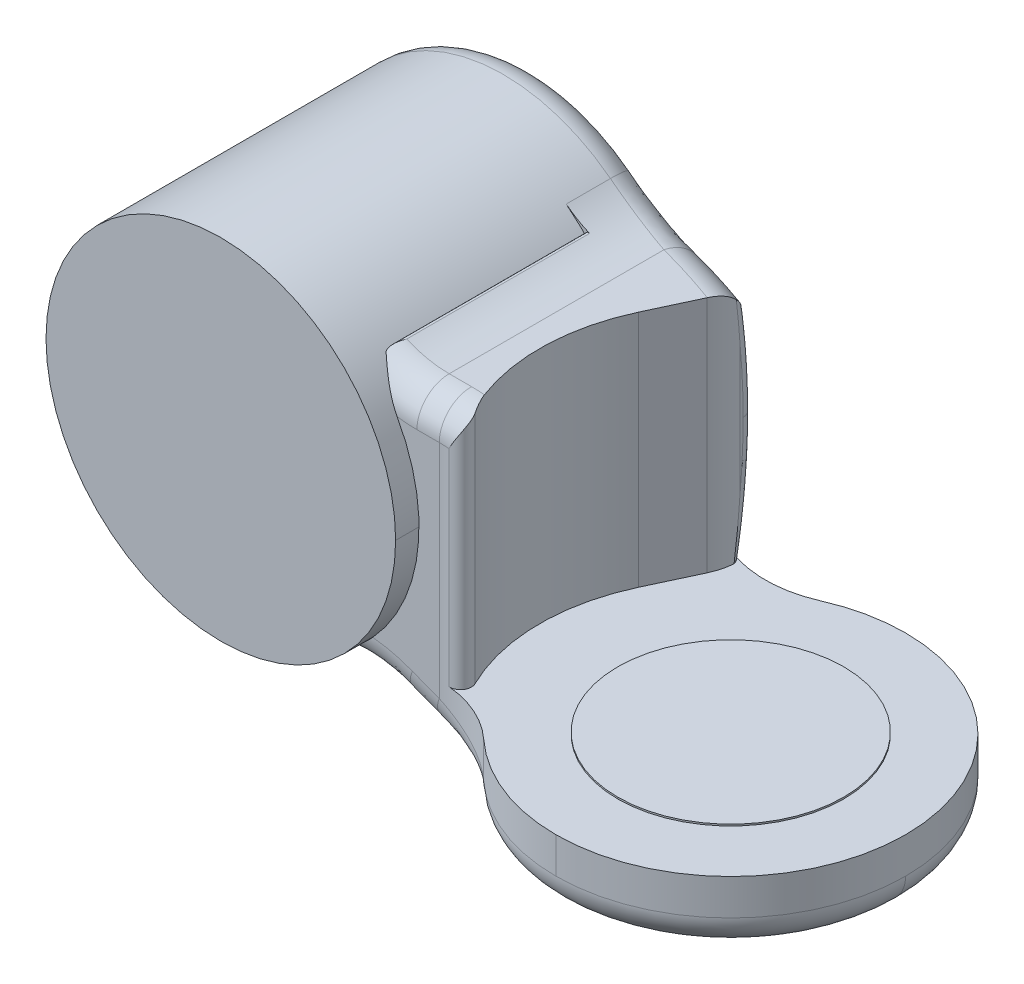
ISO-10303-21;
HEADER;
FILE_DESCRIPTION(('STEP AP214'),'2;1');
FILE_NAME('part.step','',(''),(''),'','','');
FILE_SCHEMA(('AUTOMOTIVE_DESIGN { 1 0 10303 214 1 1 1 1 }'));
ENDSEC;
DATA;
#1=APPLICATION_CONTEXT('core data for automotive mechanical design processes');
#2=APPLICATION_PROTOCOL_DEFINITION('international standard','automotive_design',2000,#1);
#3=PRODUCT_CONTEXT('',#1,'mechanical');
#4=PRODUCT('Part','Part','',(#3));
#5=PRODUCT_RELATED_PRODUCT_CATEGORY('part','',(#4));
#6=PRODUCT_DEFINITION_FORMATION('','',#4);
#7=PRODUCT_DEFINITION_CONTEXT('part definition',#1,'design');
#8=PRODUCT_DEFINITION('design','',#6,#7);
#9=PRODUCT_DEFINITION_SHAPE('','',#8);
#10=(LENGTH_UNIT() NAMED_UNIT(*) SI_UNIT(.MILLI.,.METRE.));
#11=(NAMED_UNIT(*) PLANE_ANGLE_UNIT() SI_UNIT($,.RADIAN.));
#12=(NAMED_UNIT(*) SI_UNIT($,.STERADIAN.) SOLID_ANGLE_UNIT());
#13=UNCERTAINTY_MEASURE_WITH_UNIT(LENGTH_MEASURE(1.E-05),#10,'distance_accuracy_value','');
#14=(GEOMETRIC_REPRESENTATION_CONTEXT(3) GLOBAL_UNCERTAINTY_ASSIGNED_CONTEXT((#13)) GLOBAL_UNIT_ASSIGNED_CONTEXT((#10,
#11,#12)) REPRESENTATION_CONTEXT('',''));
#15=CARTESIAN_POINT('',(0.,0.,0.));
#16=DIRECTION('',(0.,0.,1.));
#17=DIRECTION('',(1.,0.,0.));
#18=AXIS2_PLACEMENT_3D('',#15,#16,#17);
#19=CARTESIAN_POINT('',(72.,-22.5,34.5));
#20=DIRECTION('',(0.,1.,0.));
#21=DIRECTION('',(1.,0.,0.));
#22=AXIS2_PLACEMENT_3D('',#19,#20,#21);
#23=PLANE('',#22);
#24=CARTESIAN_POINT('',(72.,-22.5,34.5));
#25=DIRECTION('',(0.,1.,0.));
#26=DIRECTION('',(0.,0.,1.));
#27=AXIS2_PLACEMENT_3D('',#24,#25,#26);
#28=CIRCLE('',#27,21.);
#29=CARTESIAN_POINT('',(72.,-22.5,13.5));
#30=VERTEX_POINT('',#29);
#31=CARTESIAN_POINT('',(72.,-22.5,55.5));
#32=VERTEX_POINT('',#31);
#33=EDGE_CURVE('E11',#30,#32,#28,.T.);
#34=ORIENTED_EDGE('',*,*,#33,.T.);
#35=CARTESIAN_POINT('',(72.,-22.5,34.5));
#36=DIRECTION('',(0.,1.,0.));
#37=DIRECTION('',(0.,0.,1.));
#38=AXIS2_PLACEMENT_3D('',#35,#36,#37);
#39=CIRCLE('',#38,21.);
#40=EDGE_CURVE('E426',#32,#30,#39,.T.);
#41=ORIENTED_EDGE('',*,*,#40,.T.);
#42=EDGE_LOOP('',(#34,#41));
#43=FACE_BOUND('',#42,.T.);
#44=ADVANCED_FACE('F16',(#43),#23,.T.);
#45=CARTESIAN_POINT('',(72.,-22.5,34.5));
#46=DIRECTION('',(0.,-1.,0.));
#47=DIRECTION('',(0.,0.,-1.));
#48=AXIS2_PLACEMENT_3D('',#45,#46,#47);
#49=CYLINDRICAL_SURFACE('',#48,21.);
#50=DIRECTION('',(0.,-1.,0.));
#51=VECTOR('',#50,1.);
#52=CARTESIAN_POINT('',(72.,-22.5,55.5));
#53=LINE('',#52,#51);
#54=CARTESIAN_POINT('',(72.,-22.8,55.5));
#55=VERTEX_POINT('',#54);
#56=EDGE_CURVE('E421',#32,#55,#53,.T.);
#57=ORIENTED_EDGE('',*,*,#56,.F.);
#58=ORIENTED_EDGE('',*,*,#33,.F.);
#59=DIRECTION('',(0.,-1.,0.));
#60=VECTOR('',#59,1.);
#61=CARTESIAN_POINT('',(72.,-22.5,13.5));
#62=LINE('',#61,#60);
#63=CARTESIAN_POINT('',(72.,-22.8,13.5));
#64=VERTEX_POINT('',#63);
#65=EDGE_CURVE('E420',#30,#64,#62,.T.);
#66=ORIENTED_EDGE('',*,*,#65,.T.);
#67=CARTESIAN_POINT('',(72.,-22.8,34.5));
#68=DIRECTION('',(0.,1.,0.));
#69=DIRECTION('',(0.,0.,1.));
#70=AXIS2_PLACEMENT_3D('',#67,#68,#69);
#71=CIRCLE('',#70,21.);
#72=EDGE_CURVE('E1296',#64,#55,#71,.T.);
#73=ORIENTED_EDGE('',*,*,#72,.T.);
#74=EDGE_LOOP('',(#57,#58,#66,#73));
#75=FACE_BOUND('',#74,.T.);
#76=ADVANCED_FACE('F923',(#75),#49,.T.);
#77=CARTESIAN_POINT('',(0.,0.,57.3));
#78=DIRECTION('',(0.,0.,1.));
#79=DIRECTION('',(1.,0.,0.));
#80=AXIS2_PLACEMENT_3D('',#77,#78,#79);
#81=PLANE('',#80);
#82=CARTESIAN_POINT('',(0.,0.,57.3));
#83=DIRECTION('',(0.,0.,1.));
#84=DIRECTION('',(1.,0.,0.));
#85=AXIS2_PLACEMENT_3D('',#82,#83,#84);
#86=CIRCLE('',#85,32.5);
#87=CARTESIAN_POINT('',(-32.5,0.,57.3));
#88=VERTEX_POINT('',#87);
#89=CARTESIAN_POINT('',(32.5,0.,57.3));
#90=VERTEX_POINT('',#89);
#91=EDGE_CURVE('E431',#88,#90,#86,.T.);
#92=ORIENTED_EDGE('',*,*,#91,.T.);
#93=CARTESIAN_POINT('',(0.,0.,57.3));
#94=DIRECTION('',(0.,0.,1.));
#95=DIRECTION('',(1.,0.,0.));
#96=AXIS2_PLACEMENT_3D('',#93,#94,#95);
#97=CIRCLE('',#96,32.5);
#98=EDGE_CURVE('E553',#90,#88,#97,.T.);
#99=ORIENTED_EDGE('',*,*,#98,.T.);
#100=EDGE_LOOP('',(#92,#99));
#101=FACE_BOUND('',#100,.T.);
#102=ADVANCED_FACE('F585',(#101),#81,.T.);
#103=CARTESIAN_POINT('',(43.6433468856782,-23.0637837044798,5.42090101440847));
#104=CARTESIAN_POINT('',(44.7181710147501,-22.9977093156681,5.78002297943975));
#105=CARTESIAN_POINT('',(44.9557184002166,-22.7968489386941,6.87172241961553));
#106=CARTESIAN_POINT('',(43.6460328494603,-22.9469055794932,5.40032457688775));
#107=CARTESIAN_POINT('',(44.7188421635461,-22.8809014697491,5.76049178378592));
#108=CARTESIAN_POINT('',(44.955811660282,-22.680908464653,6.85083378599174));
#109=CARTESIAN_POINT('',(43.6487042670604,-22.8299960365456,5.37984819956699));
#110=CARTESIAN_POINT('',(44.7195090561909,-22.7640205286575,5.74104164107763));
#111=CARTESIAN_POINT('',(44.9559043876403,-22.5649299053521,6.8300399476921));
#112=CARTESIAN_POINT('',(43.6513609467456,-22.7130546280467,5.35947366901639));
#113=CARTESIAN_POINT('',(44.7201716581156,-22.6470677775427,5.72167496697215));
#114=CARTESIAN_POINT('',(44.9559965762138,-22.4489133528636,6.80934302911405));
#115=(BOUNDED_SURFACE() B_SPLINE_SURFACE(3,2,((#103,#104,#105),(#106,#107,#108),(#109,#110,
#111),(#112,#113,#114)),.UNSPECIFIED.,.F.,.F.,.F.) B_SPLINE_SURFACE_WITH_KNOTS((4,4),(3,3),
(0.0290017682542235,0.0293542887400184),(0.,0.824297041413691),
.UNSPECIFIED.) GEOMETRIC_REPRESENTATION_ITEM() RATIONAL_B_SPLINE_SURFACE(((1.,0.845789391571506,
0.945809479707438),(1.,0.846129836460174,0.945929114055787),(1.,0.846468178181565,
0.94604800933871),(1.,0.846804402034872,0.946166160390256))) REPRESENTATION_ITEM('') SURFACE());
#116=CARTESIAN_POINT('',(43.6493828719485,-22.8,5.37464179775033));
#117=CARTESIAN_POINT('',(43.7021262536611,-22.8,5.3930474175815));
#118=CARTESIAN_POINT('',(43.7540634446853,-22.8,5.41368029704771));
#119=CARTESIAN_POINT('',(43.8560081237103,-22.8,5.45924731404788));
#120=CARTESIAN_POINT('',(43.9060158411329,-22.8,5.48418093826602));
#121=CARTESIAN_POINT('',(44.0523658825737,-22.8,5.56503279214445));
#122=CARTESIAN_POINT('',(44.1453861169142,-22.8,5.62712515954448));
#123=CARTESIAN_POINT('',(44.3198139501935,-22.8,5.76588353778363));
#124=CARTESIAN_POINT('',(44.4012168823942,-22.8,5.84255537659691));
#125=CARTESIAN_POINT('',(44.5503303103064,-22.8,6.00828259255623));
#126=CARTESIAN_POINT('',(44.6180330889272,-22.8,6.09734490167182));
#127=CARTESIAN_POINT('',(44.7415536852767,-22.8,6.2910013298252));
#128=CARTESIAN_POINT('',(44.7964255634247,-22.8,6.39620406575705));
#129=CARTESIAN_POINT('',(44.8645569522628,-22.8,6.55983777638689));
#130=CARTESIAN_POINT('',(44.8849187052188,-22.8,6.61541591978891));
#131=CARTESIAN_POINT('',(44.9207839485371,-22.8,6.72811428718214));
#132=CARTESIAN_POINT('',(44.9362877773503,-22.8,6.78523440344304));
#133=CARTESIAN_POINT('',(44.9493158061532,-22.8,6.84294411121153));
#134=B_SPLINE_CURVE_WITH_KNOTS('',3,(#116,#117,#118,#119,#120,#121,#122,#123,#124,#125,#126,
#127,#128,#129,#130,#131,#132,#133),.UNSPECIFIED.,.F.,.F.,(4,2,2,2,2,2,2,2,4),(0.,
0.167484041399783,0.33494810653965,0.668774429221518,1.00273447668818,1.33688211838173,
1.69089645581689,1.86827981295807,2.04565080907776),.UNSPECIFIED.);
#135=CARTESIAN_POINT('',(43.6493828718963,-22.8,5.3746417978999));
#136=VERTEX_POINT('',#135);
#137=CARTESIAN_POINT('',(44.9493158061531,-22.8,6.84294411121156));
#138=VERTEX_POINT('',#137);
#139=EDGE_CURVE('E1447',#136,#138,#134,.T.);
#140=CARTESIAN_POINT('',(43.6513652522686,-22.713056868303,5.35946137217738));
#141=CARTESIAN_POINT('',(43.651283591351,-22.716679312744,5.36009271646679));
#142=CARTESIAN_POINT('',(43.6512018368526,-22.7203017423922,5.36072413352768));
#143=CARTESIAN_POINT('',(43.6510381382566,-22.7275466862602,5.36198713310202));
#144=CARTESIAN_POINT('',(43.6509561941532,-22.731169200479,5.36261871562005));
#145=CARTESIAN_POINT('',(43.6507921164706,-22.7384143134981,5.3638820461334));
#146=CARTESIAN_POINT('',(43.6507099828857,-22.7420369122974,5.36451379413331));
#147=CARTESIAN_POINT('',(43.6505455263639,-22.7492821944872,5.36577745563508));
#148=CARTESIAN_POINT('',(43.6504632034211,-22.7529048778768,5.36640936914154));
#149=CARTESIAN_POINT('',(43.6502983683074,-22.7601503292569,5.36767336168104));
#150=CARTESIAN_POINT('',(43.6502158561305,-22.7637730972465,5.36830544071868));
#151=CARTESIAN_POINT('',(43.6500506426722,-22.7710187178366,5.36956976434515));
#152=CARTESIAN_POINT('',(43.6499679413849,-22.7746415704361,5.37020200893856));
#153=CARTESIAN_POINT('',(43.6498023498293,-22.7818873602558,5.37146666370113));
#154=CARTESIAN_POINT('',(43.6497194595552,-22.785510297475,5.37209907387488));
#155=CARTESIAN_POINT('',(43.6495534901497,-22.7927562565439,5.3733640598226));
#156=CARTESIAN_POINT('',(43.6494704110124,-22.7963792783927,5.37399663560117));
#157=CARTESIAN_POINT('',(43.6493872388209,-22.8000022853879,5.37462928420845));
#158=B_SPLINE_CURVE_WITH_KNOTS('',3,(#140,#141,#142,#143,#144,#145,#146,#147,#148,#149,#150,
#151,#152,#153,#154,#155,#156,#157),.UNSPECIFIED.,.F.,.F.,(4,2,2,2,2,2,2,2,4),(0.,
0.0110338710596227,0.0220680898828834,0.0331026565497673,0.0441375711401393,0.0551728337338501,
0.066208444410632,0.0772444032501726,0.0882807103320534),.UNSPECIFIED.);
#159=CARTESIAN_POINT('',(43.6513609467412,-22.7130546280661,5.35947366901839));
#160=VERTEX_POINT('',#159);
#161=EDGE_CURVE('E1314',#160,#136,#158,.T.);
#162=CARTESIAN_POINT('',(43.,-22.3741328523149,7.21981260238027));
#163=DIRECTION('',(0.,-0.983806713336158,0.179232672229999));
#164=DIRECTION('',(0.,-0.179232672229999,-0.983806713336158));
#165=AXIS2_PLACEMENT_3D('',#162,#163,#164);
#166=CIRCLE('',#165,2.);
#167=CARTESIAN_POINT('',(44.9534105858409,-22.451054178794,6.79759205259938));
#168=VERTEX_POINT('',#167);
#169=EDGE_CURVE('E388',#160,#168,#166,.T.);
#170=CARTESIAN_POINT('',(44.9493158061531,-22.8,6.84294411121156));
#171=CARTESIAN_POINT('',(44.9507165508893,-22.6836948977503,6.8277519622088));
#172=CARTESIAN_POINT('',(44.9520812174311,-22.5673796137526,6.81263420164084));
#173=CARTESIAN_POINT('',(44.9534105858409,-22.451054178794,6.79759205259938));
#174=(BOUNDED_CURVE() B_SPLINE_CURVE(3,(#170,#171,#172,#173),.UNSPECIFIED.,.F.,
.F.) B_SPLINE_CURVE_WITH_KNOTS((4,4),(0.,0.000351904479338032),
.UNSPECIFIED.) CURVE() GEOMETRIC_REPRESENTATION_ITEM() RATIONAL_B_SPLINE_CURVE((1.,1.,1.,1.)) REPRESENTATION_ITEM(''));
#175=EDGE_CURVE('E1124',#138,#168,#174,.T.);
#176=ORIENTED_EDGE('',*,*,#139,.F.);
#177=ORIENTED_EDGE('',*,*,#161,.F.);
#178=ORIENTED_EDGE('',*,*,#169,.T.);
#179=ORIENTED_EDGE('',*,*,#175,.F.);
#180=EDGE_LOOP('',(#176,#177,#178,#179));
#181=FACE_BOUND('',#180,.T.);
#182=ADVANCED_FACE('F852',(#181),#115,.T.);
#183=CARTESIAN_POINT('',(43.,0.,130.03125));
#184=DIRECTION('',(1.,0.,0.));
#185=DIRECTION('',(0.,0.,-1.));
#186=AXIS2_PLACEMENT_3D('',#183,#184,#185);
#187=TOROIDAL_SURFACE('',#186,124.832892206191,2.);
#188=CARTESIAN_POINT('',(43.,0.,5.19835779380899));
#189=DIRECTION('',(0.,-1.,0.));
#190=DIRECTION('',(0.,0.,-1.));
#191=AXIS2_PLACEMENT_3D('',#188,#189,#190);
#192=CIRCLE('',#191,2.);
#193=CARTESIAN_POINT('',(43.6513609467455,0.,3.3073980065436));
#194=VERTEX_POINT('',#193);
#195=CARTESIAN_POINT('',(45.,0.,5.19835779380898));
#196=VERTEX_POINT('',#195);
#197=EDGE_CURVE('E403',#194,#196,#192,.T.);
#198=ORIENTED_EDGE('',*,*,#197,.F.);
#199=CARTESIAN_POINT('',(43.6513609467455,0.,130.03125));
#200=DIRECTION('',(-1.,0.,0.));
#201=DIRECTION('',(0.,0.,1.));
#202=AXIS2_PLACEMENT_3D('',#199,#200,#201);
#203=CIRCLE('',#202,126.723851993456);
#204=CARTESIAN_POINT('',(43.6513609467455,16.2263851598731,4.35054707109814));
#205=VERTEX_POINT('',#204);
#206=EDGE_CURVE('E414',#205,#194,#203,.T.);
#207=ORIENTED_EDGE('',*,*,#206,.F.);
#208=CARTESIAN_POINT('',(44.9791844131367,19.5522970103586,6.44769367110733));
#209=CARTESIAN_POINT('',(44.9724226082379,19.4976764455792,6.39200139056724));
#210=CARTESIAN_POINT('',(44.9641229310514,19.4424352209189,6.3371290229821));
#211=CARTESIAN_POINT('',(44.9446888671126,19.3308170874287,6.2290942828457));
#212=CARTESIAN_POINT('',(44.9335552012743,19.2744404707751,6.1759314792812));
#213=CARTESIAN_POINT('',(44.896296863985,19.1039008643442,6.019233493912));
#214=CARTESIAN_POINT('',(44.8662923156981,18.9881575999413,5.9183151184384));
#215=CARTESIAN_POINT('',(44.797598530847,18.753420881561,5.72405406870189));
#216=CARTESIAN_POINT('',(44.7589267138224,18.6344343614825,5.63069670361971));
#217=CARTESIAN_POINT('',(44.6741248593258,18.3934457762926,5.45147764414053));
#218=CARTESIAN_POINT('',(44.627991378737,18.2714423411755,5.36561943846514));
#219=CARTESIAN_POINT('',(44.5174853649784,17.9952631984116,5.18187720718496));
#220=CARTESIAN_POINT('',(44.4513932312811,17.8403968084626,5.08605602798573));
#221=CARTESIAN_POINT('',(44.3110925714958,17.5274589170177,4.90648066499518));
#222=CARTESIAN_POINT('',(44.2368826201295,17.3693868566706,4.82272860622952));
#223=CARTESIAN_POINT('',(44.0042623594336,16.8913503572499,4.59005181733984));
#224=CARTESIAN_POINT('',(43.8356410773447,16.5670355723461,4.45935460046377));
#225=CARTESIAN_POINT('',(43.6562094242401,16.2353409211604,4.35339282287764));
#226=CARTESIAN_POINT('',(43.6537859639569,16.2308633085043,4.35196749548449));
#227=CARTESIAN_POINT('',(43.6513609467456,16.2263851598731,4.35054707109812));
#228=B_SPLINE_CURVE_WITH_KNOTS('',3,(#208,#209,#210,#211,#212,#213,#214,#215,#216,#217,#218,
#219,#220,#221,#222,#223,#224,#225,#226,#227),.UNSPECIFIED.,.F.,.F.,(4,2,2,2,2,2,2,2,2,4),(0.,
0.234846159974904,0.469632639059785,0.938474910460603,1.40638321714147,1.87450805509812,
2.45504074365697,3.03567552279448,4.19494287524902,4.2108042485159),.UNSPECIFIED.);
#229=CARTESIAN_POINT('',(44.9791844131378,19.5522970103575,6.44769367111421));
#230=VERTEX_POINT('',#229);
#231=EDGE_CURVE('E225',#230,#205,#228,.T.);
#232=ORIENTED_EDGE('',*,*,#231,.F.);
#233=CARTESIAN_POINT('',(45.,11.6289780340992,5.74119470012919));
#234=CARTESIAN_POINT('',(44.9999999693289,11.7004593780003,5.74593787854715));
#235=CARTESIAN_POINT('',(44.9999971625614,11.7719379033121,5.75072475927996));
#236=CARTESIAN_POINT('',(44.9999378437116,12.508611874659,5.80051185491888));
#237=CARTESIAN_POINT('',(44.9996288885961,13.1735603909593,5.84925355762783));
#238=CARTESIAN_POINT('',(44.9982220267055,14.5028642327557,5.95430783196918));
#239=CARTESIAN_POINT('',(44.9971241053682,15.1672195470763,6.0106205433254));
#240=CARTESIAN_POINT('',(44.9926570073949,16.9655082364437,6.17338755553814));
#241=CARTESIAN_POINT('',(44.9882299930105,18.0987950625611,6.28710888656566));
#242=CARTESIAN_POINT('',(44.9777440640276,19.7968603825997,6.47435982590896));
#243=CARTESIAN_POINT('',(44.9736077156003,20.3625841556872,6.53955663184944));
#244=CARTESIAN_POINT('',(44.9637632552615,21.4933447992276,6.67553903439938));
#245=CARTESIAN_POINT('',(44.9580551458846,22.0583816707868,6.74632462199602));
#246=CARTESIAN_POINT('',(44.9514162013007,22.6230476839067,6.8199211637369));
#247=B_SPLINE_CURVE_WITH_KNOTS('',3,(#233,#234,#235,#236,#237,#238,#239,#240,#241,#242,#243,
#244,#245,#246),.UNSPECIFIED.,.F.,.F.,(4,2,2,2,2,2,4),(0.,0.214915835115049,2.21506095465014,
4.21524299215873,7.63193764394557,9.34036252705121,11.0487846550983),.UNSPECIFIED.);
#248=CARTESIAN_POINT('',(45.,11.6289780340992,5.74119470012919));
#249=VERTEX_POINT('',#248);
#250=EDGE_CURVE('E29',#249,#230,#247,.T.);
#251=ORIENTED_EDGE('',*,*,#250,.F.);
#252=CARTESIAN_POINT('',(45.,0.,130.03125));
#253=DIRECTION('',(1.,0.,0.));
#254=DIRECTION('',(0.,0.,-1.));
#255=AXIS2_PLACEMENT_3D('',#252,#253,#254);
#256=CIRCLE('',#255,124.832892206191);
#257=EDGE_CURVE('E437',#196,#249,#256,.T.);
#258=ORIENTED_EDGE('',*,*,#257,.F.);
#259=EDGE_LOOP('',(#198,#207,#232,#251,#258));
#260=FACE_BOUND('',#259,.T.);
#261=ADVANCED_FACE('F506',(#260),#187,.T.);
#262=CARTESIAN_POINT('',(33.,30.5,5.74119470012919));
#263=DIRECTION('',(0.,1.,0.));
#264=DIRECTION('',(0.,0.,1.));
#265=AXIS2_PLACEMENT_3D('',#262,#263,#264);
#266=CYLINDRICAL_SURFACE('',#265,12.);
#267=CARTESIAN_POINT('',(33.,-22.8,5.74119470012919));
#268=DIRECTION('',(0.,-1.,0.));
#269=DIRECTION('',(0.,0.,1.));
#270=AXIS2_PLACEMENT_3D('',#267,#268,#269);
#271=CIRCLE('',#270,12.);
#272=CARTESIAN_POINT('',(43.8756934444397,-22.8,10.8126138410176));
#273=VERTEX_POINT('',#272);
#274=EDGE_CURVE('E1284',#138,#273,#271,.T.);
#275=ORIENTED_EDGE('',*,*,#274,.F.);
#276=ORIENTED_EDGE('',*,*,#175,.T.);
#277=CARTESIAN_POINT('',(44.9534105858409,-22.451054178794,6.79759205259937));
#278=CARTESIAN_POINT('',(44.9584657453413,-22.0085300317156,6.7403680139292));
#279=CARTESIAN_POINT('',(44.9629567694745,-21.5657745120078,6.68488788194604));
#280=CARTESIAN_POINT('',(44.9709691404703,-20.6779310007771,6.5771617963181));
#281=CARTESIAN_POINT('',(44.9744862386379,-20.2328411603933,6.52493076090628));
#282=CARTESIAN_POINT('',(44.9806817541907,-19.3403291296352,6.42372138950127));
#283=CARTESIAN_POINT('',(44.9833564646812,-18.8929052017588,6.37475815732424));
#284=CARTESIAN_POINT('',(44.9879872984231,-17.9957248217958,6.28009797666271));
#285=CARTESIAN_POINT('',(44.989940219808,-17.5459667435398,6.23441628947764));
#286=CARTESIAN_POINT('',(44.9932404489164,-16.6441179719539,6.14632997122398));
#287=CARTESIAN_POINT('',(44.9945850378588,-16.1920257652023,6.10394073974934));
#288=CARTESIAN_POINT('',(44.9967731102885,-15.2855086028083,6.02244728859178));
#289=CARTESIAN_POINT('',(44.9976143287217,-14.831082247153,5.98335858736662));
#290=CARTESIAN_POINT('',(44.9988928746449,-13.9198967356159,5.90847201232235));
#291=CARTESIAN_POINT('',(44.999328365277,-13.4631362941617,5.8726897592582));
#292=CARTESIAN_POINT('',(44.9998817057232,-12.5472822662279,5.80441964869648));
#293=CARTESIAN_POINT('',(44.9999981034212,-12.0881875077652,5.77194749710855));
#294=CARTESIAN_POINT('',(45.,-11.6289780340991,5.74119470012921));
#295=B_SPLINE_CURVE_WITH_KNOTS('',3,(#277,#278,#279,#280,#281,#282,#283,#284,#285,#286,#287,
#288,#289,#290,#291,#292,#293,#294),.UNSPECIFIED.,.F.,.F.,(4,2,2,2,2,2,2,2,4),(0.,
1.33870737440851,2.68316593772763,4.03346064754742,5.3896753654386,6.75189286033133,
8.12019481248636,9.49466181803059,10.87537339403),.UNSPECIFIED.);
#296=CARTESIAN_POINT('',(45.,-11.6289780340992,5.7411947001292));
#297=VERTEX_POINT('',#296);
#298=EDGE_CURVE('E399',#168,#297,#295,.T.);
#299=ORIENTED_EDGE('',*,*,#298,.T.);
#300=DIRECTION('',(0.,-1.,0.));
#301=VECTOR('',#300,1.);
#302=CARTESIAN_POINT('',(45.,-22.8,5.74119470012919));
#303=LINE('',#302,#301);
#304=EDGE_CURVE('E442',#249,#297,#303,.T.);
#305=ORIENTED_EDGE('',*,*,#304,.F.);
#306=ORIENTED_EDGE('',*,*,#250,.T.);
#307=CARTESIAN_POINT('',(43.8982625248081,21.5,10.7639304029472));
#308=CARTESIAN_POINT('',(43.9634965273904,21.5000266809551,10.622452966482));
#309=CARTESIAN_POINT('',(44.0259241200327,21.4939713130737,10.4796860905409));
#310=CARTESIAN_POINT('',(44.1448454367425,21.4697775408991,10.1927510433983));
#311=CARTESIAN_POINT('',(44.2013405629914,21.4516419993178,10.0485832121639));
#312=CARTESIAN_POINT('',(44.3078729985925,21.4034747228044,9.76058857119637));
#313=CARTESIAN_POINT('',(44.3579375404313,21.3734955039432,9.61676303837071));
#314=CARTESIAN_POINT('',(44.4517879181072,21.3018923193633,9.32996990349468));
#315=CARTESIAN_POINT('',(44.4955737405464,21.2602683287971,9.18700230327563));
#316=CARTESIAN_POINT('',(44.5768742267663,21.1657580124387,8.90312080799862));
#317=CARTESIAN_POINT('',(44.6143923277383,21.1128778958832,8.76220582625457));
#318=CARTESIAN_POINT('',(44.6833732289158,20.9962635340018,8.48335284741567));
#319=CARTESIAN_POINT('',(44.714833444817,20.932524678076,8.34541614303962));
#320=CARTESIAN_POINT('',(44.7719858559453,20.7946740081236,8.07350231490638));
#321=CARTESIAN_POINT('',(44.7976750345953,20.7205568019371,7.93952729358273));
#322=CARTESIAN_POINT('',(44.8436633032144,20.5625062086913,7.67651927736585));
#323=CARTESIAN_POINT('',(44.8639613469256,20.4785709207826,7.54748724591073));
#324=CARTESIAN_POINT('',(44.9065487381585,20.2670524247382,7.24628536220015));
#325=CARTESIAN_POINT('',(44.9265570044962,20.135166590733,7.07679457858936));
#326=CARTESIAN_POINT('',(44.9585101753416,19.8553901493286,6.75156264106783));
#327=CARTESIAN_POINT('',(44.9704770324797,19.7075444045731,6.59578507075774));
#328=CARTESIAN_POINT('',(44.9791844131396,19.5522970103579,6.4476936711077));
#329=B_SPLINE_CURVE_WITH_KNOTS('',3,(#307,#308,#309,#310,#311,#312,#313,#314,#315,#316,#317,
#318,#319,#320,#321,#322,#323,#324,#325,#326,#327,#328),.UNSPECIFIED.,.F.,.F.,(4,2,2,2,2,2,2,2,
2,2,4),(0.,0.467223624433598,0.934336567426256,1.39940112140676,1.86446666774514,
2.32927633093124,2.79428384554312,3.25953386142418,3.72487410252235,4.3706972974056,
5.0147501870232),.UNSPECIFIED.);
#330=CARTESIAN_POINT('',(43.8982625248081,21.5,10.7639304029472));
#331=VERTEX_POINT('',#330);
#332=EDGE_CURVE('E1156',#331,#230,#329,.T.);
#333=ORIENTED_EDGE('',*,*,#332,.F.);
#334=CARTESIAN_POINT('',(33.,21.5,5.74119470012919));
#335=DIRECTION('',(0.,1.,0.));
#336=DIRECTION('',(-1.,0.,0.));
#337=AXIS2_PLACEMENT_3D('',#334,#335,#336);
#338=CIRCLE('',#337,12.);
#339=CARTESIAN_POINT('',(43.8756934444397,21.5,10.8126138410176));
#340=VERTEX_POINT('',#339);
#341=EDGE_CURVE('E460',#340,#331,#338,.T.);
#342=ORIENTED_EDGE('',*,*,#341,.F.);
#343=DIRECTION('',(0.,1.,0.));
#344=VECTOR('',#343,1.);
#345=CARTESIAN_POINT('',(43.8756934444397,20.9084916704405,10.8126138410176));
#346=LINE('',#345,#344);
#347=EDGE_CURVE('E1255',#273,#340,#346,.T.);
#348=ORIENTED_EDGE('',*,*,#347,.F.);
#349=EDGE_LOOP('',(#275,#276,#299,#305,#306,#333,#342,#348));
#350=FACE_BOUND('',#349,.T.);
#351=ADVANCED_FACE('F897',(#350),#266,.T.);
#352=CARTESIAN_POINT('',(0.,15.5,130.03125));
#353=DIRECTION('',(0.,1.,0.));
#354=DIRECTION('',(-1.,0.,0.));
#355=AXIS2_PLACEMENT_3D('',#352,#353,#354);
#356=TOROIDAL_SURFACE('',#355,127.089539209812,6.);
#357=ORIENTED_EDGE('',*,*,#332,.T.);
#358=ORIENTED_EDGE('',*,*,#231,.T.);
#359=CARTESIAN_POINT('',(0.,16.2263851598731,130.03125));
#360=DIRECTION('',(0.,-1.,0.));
#361=DIRECTION('',(1.,0.,0.));
#362=AXIS2_PLACEMENT_3D('',#359,#360,#361);
#363=CIRCLE('',#362,133.045407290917);
#364=CARTESIAN_POINT('',(33.6628089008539,16.2263851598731,1.31491188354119));
#365=VERTEX_POINT('',#364);
#366=EDGE_CURVE('E445',#365,#205,#363,.T.);
#367=ORIENTED_EDGE('',*,*,#366,.F.);
#368=CARTESIAN_POINT('',(32.1558703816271,15.5,7.07698624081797));
#369=DIRECTION('',(0.967461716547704,0.,0.253017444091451));
#370=DIRECTION('',(0.253017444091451,0.,-0.967461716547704));
#371=AXIS2_PLACEMENT_3D('',#368,#369,#370);
#372=CIRCLE('',#371,6.);
#373=CARTESIAN_POINT('',(32.1558703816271,21.5,7.07698624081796));
#374=VERTEX_POINT('',#373);
#375=EDGE_CURVE('E617',#365,#374,#372,.T.);
#376=ORIENTED_EDGE('',*,*,#375,.T.);
#377=CARTESIAN_POINT('',(0.,21.5,130.03125));
#378=DIRECTION('',(0.,1.,0.));
#379=DIRECTION('',(-1.,0.,0.));
#380=AXIS2_PLACEMENT_3D('',#377,#378,#379);
#381=CIRCLE('',#380,127.089539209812);
#382=EDGE_CURVE('E456',#331,#374,#381,.T.);
#383=ORIENTED_EDGE('',*,*,#382,.F.);
#384=EDGE_LOOP('',(#357,#358,#367,#376,#383));
#385=FACE_BOUND('',#384,.T.);
#386=ADVANCED_FACE('F632',(#385),#356,.T.);
#387=CARTESIAN_POINT('',(19.9060149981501,25.6904761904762,4.7725138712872));
#388=CARTESIAN_POINT('',(19.9060149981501,25.6904761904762,-0.0909193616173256));
#389=CARTESIAN_POINT('',(16.991703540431,21.9292990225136,-1.09755626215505));
#390=CARTESIAN_POINT('',(20.7941491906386,25.002314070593,4.77251387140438));
#391=CARTESIAN_POINT('',(20.8846766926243,24.9321697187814,-0.0909193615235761));
#392=CARTESIAN_POINT('',(18.2003854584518,20.9927636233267,-1.09755626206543));
#393=CARTESIAN_POINT('',(21.7259741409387,24.3992071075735,4.82369933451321));
#394=CARTESIAN_POINT('',(21.9190287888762,24.2743465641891,-0.0453472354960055));
#395=CARTESIAN_POINT('',(19.4685271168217,20.1719817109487,-1.04397206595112));
#396=CARTESIAN_POINT('',(23.1857812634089,23.6158599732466,4.97366788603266));
#397=CARTESIAN_POINT('',(23.5397032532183,23.4365995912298,0.0874691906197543));
#398=CARTESIAN_POINT('',(21.4552116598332,19.105906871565,-0.8869754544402));
#399=CARTESIAN_POINT('',(23.6827960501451,23.3750695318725,5.03592946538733));
#400=CARTESIAN_POINT('',(24.0928250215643,23.1817063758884,0.142675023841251));
#401=CARTESIAN_POINT('',(22.131610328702,18.7782097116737,-0.821796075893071));
#402=CARTESIAN_POINT('',(24.4440199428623,23.0445431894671,5.14791466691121));
#403=CARTESIAN_POINT('',(24.9395849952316,22.837043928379,0.241747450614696));
#404=CARTESIAN_POINT('',(23.1675771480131,18.3283889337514,-0.704562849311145));
#405=CARTESIAN_POINT('',(24.700381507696,22.9394841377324,5.1883461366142));
#406=CARTESIAN_POINT('',(25.2250279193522,22.7283271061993,0.277532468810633));
#407=CARTESIAN_POINT('',(23.5164654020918,18.1854116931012,-0.662236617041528));
#408=CARTESIAN_POINT('',(25.2183999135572,22.7397077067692,5.27549880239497));
#409=CARTESIAN_POINT('',(25.8018056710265,22.5235509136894,0.354617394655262));
#410=CARTESIAN_POINT('',(24.2214483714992,17.9135314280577,-0.570999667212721));
#411=CARTESIAN_POINT('',(25.4807384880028,22.6447738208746,5.32235496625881));
#412=CARTESIAN_POINT('',(26.0939626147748,22.4272752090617,0.396051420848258));
#413=CARTESIAN_POINT('',(24.5784708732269,17.7843337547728,-0.52194765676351));
#414=CARTESIAN_POINT('',(26.7944246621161,22.2001051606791,5.57043649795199));
#415=CARTESIAN_POINT('',(27.5601814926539,21.9807762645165,0.615781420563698));
#416=CARTESIAN_POINT('',(26.366296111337,17.1791741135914,-0.262240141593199));
#417=CARTESIAN_POINT('',(27.8547148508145,21.9379658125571,5.81299632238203));
#418=CARTESIAN_POINT('',(28.7422356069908,21.7372641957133,0.830359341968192));
#419=CARTESIAN_POINT('',(27.8092690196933,16.8224227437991,-0.00831310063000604));
#420=CARTESIAN_POINT('',(29.9924514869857,21.5878745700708,6.38165089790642));
#421=CARTESIAN_POINT('',(31.1157907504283,21.4597717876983,1.33025585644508));
#422=CARTESIAN_POINT('',(30.7185631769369,16.3459756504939,0.586990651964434));
#423=CARTESIAN_POINT('',(31.069958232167,21.5,6.70779216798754));
#424=CARTESIAN_POINT('',(32.3108312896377,21.4274556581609,1.6169963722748));
#425=CARTESIAN_POINT('',(32.1849501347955,16.2263851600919,0.928411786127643));
#426=CARTESIAN_POINT('',(32.1558703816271,21.5,7.07698624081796));
#427=CARTESIAN_POINT('',(33.50007397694,21.5,1.93716071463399));
#428=CARTESIAN_POINT('',(33.6628089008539,16.2263851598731,1.31491188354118));
#429=(BOUNDED_SURFACE() B_SPLINE_SURFACE(3,2,((#387,#388,#389),(#390,#391,#392),(#393,#394,
#395),(#396,#397,#398),(#399,#400,#401),(#402,#403,#404),(#405,#406,#407),(#408,#409,#410),
(#411,#412,#413),(#414,#415,#416),(#417,#418,#419),(#420,#421,#422),(#423,#424,#425),(#426,#427,
#428)),.UNSPECIFIED.,.F.,.F.,.F.) B_SPLINE_SURFACE_WITH_KNOTS((4,2,2,2,2,2,4),(3,3),(0.,
0.00431768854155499,0.00647653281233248,0.00755595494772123,0.00863537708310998,
0.012953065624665,0.01727075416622),(0.,1.),
.UNSPECIFIED.) GEOMETRIC_REPRESENTATION_ITEM() RATIONAL_B_SPLINE_SURFACE(((1.,0.776846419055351,
1.),(1.,0.776844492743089,1.),(1.,0.776226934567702,1.),(1.,0.77440880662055,1.),(1.,
0.773653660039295,1.),(1.,0.772294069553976,1.),(1.,0.771803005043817,1.),(1.,0.770743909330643,
1.),(1.,0.77017423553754,1.),(1.,0.767156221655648,1.),(1.,0.764200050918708,1.),(1.,
0.75724237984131,1.),(1.,0.753239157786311,1.),(1.,0.748686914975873,1.))) REPRESENTATION_ITEM('') SURFACE());
#430=CARTESIAN_POINT('',(16.231058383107,20.9476190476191,4.77251387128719));
#431=DIRECTION('',(0.79047619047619,-0.612492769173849,0.));
#432=DIRECTION('',(0.612492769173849,0.79047619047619,0.));
#433=AXIS2_PLACEMENT_3D('',#430,#431,#432);
#434=CIRCLE('',#433,6.);
#435=CARTESIAN_POINT('',(16.991703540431,21.9292990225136,-1.09755626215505));
#436=VERTEX_POINT('',#435);
#437=CARTESIAN_POINT('',(19.9060149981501,25.6904761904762,4.77251387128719));
#438=VERTEX_POINT('',#437);
#439=EDGE_CURVE('E235',#436,#438,#434,.T.);
#440=CARTESIAN_POINT('',(19.9060149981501,25.6904761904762,4.7725138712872));
#441=CARTESIAN_POINT('',(20.7941491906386,25.002314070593,4.77251387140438));
#442=CARTESIAN_POINT('',(21.7259741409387,24.3992071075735,4.82369933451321));
#443=CARTESIAN_POINT('',(23.1857812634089,23.6158599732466,4.97366788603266));
#444=CARTESIAN_POINT('',(23.6827960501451,23.3750695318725,5.03592946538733));
#445=CARTESIAN_POINT('',(24.4440199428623,23.0445431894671,5.14791466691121));
#446=CARTESIAN_POINT('',(24.700381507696,22.9394841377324,5.1883461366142));
#447=CARTESIAN_POINT('',(25.2183999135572,22.7397077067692,5.27549880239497));
#448=CARTESIAN_POINT('',(25.4807384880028,22.6447738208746,5.32235496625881));
#449=CARTESIAN_POINT('',(26.7944246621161,22.2001051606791,5.57043649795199));
#450=CARTESIAN_POINT('',(27.8547148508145,21.9379658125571,5.81299632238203));
#451=CARTESIAN_POINT('',(29.9924514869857,21.5878745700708,6.38165089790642));
#452=CARTESIAN_POINT('',(31.069958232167,21.5,6.70779216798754));
#453=CARTESIAN_POINT('',(32.1558703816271,21.5,7.07698624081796));
#454=(BOUNDED_CURVE() B_SPLINE_CURVE(3,(#440,#441,#442,#443,#444,#445,#446,#447,#448,#449,#450,
#451,#452,#453),.UNSPECIFIED.,.F.,.F.) B_SPLINE_CURVE_WITH_KNOTS((4,2,2,2,2,2,4),(0.,
0.00431768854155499,0.00647653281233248,0.00755595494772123,0.00863537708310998,
0.012953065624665,0.01727075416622),
.UNSPECIFIED.) CURVE() GEOMETRIC_REPRESENTATION_ITEM() RATIONAL_B_SPLINE_CURVE((1.,1.,1.,1.,1.,
1.,1.,1.,1.,1.,1.,1.,1.,1.)) REPRESENTATION_ITEM(''));
#455=EDGE_CURVE('E611',#374,#438,#454,.F.);
#456=CARTESIAN_POINT('',(33.6628089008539,16.2263851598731,1.31491188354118));
#457=CARTESIAN_POINT('',(32.1849501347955,16.2263851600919,0.928411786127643));
#458=CARTESIAN_POINT('',(30.7185631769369,16.3459756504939,0.586990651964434));
#459=CARTESIAN_POINT('',(27.8092690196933,16.8224227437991,-0.00831310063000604));
#460=CARTESIAN_POINT('',(26.366296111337,17.1791741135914,-0.262240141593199));
#461=CARTESIAN_POINT('',(24.5784708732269,17.7843337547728,-0.52194765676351));
#462=CARTESIAN_POINT('',(24.2214483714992,17.9135314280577,-0.570999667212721));
#463=CARTESIAN_POINT('',(23.5164654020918,18.1854116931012,-0.662236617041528));
#464=CARTESIAN_POINT('',(23.1675771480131,18.3283889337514,-0.704562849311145));
#465=CARTESIAN_POINT('',(22.131610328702,18.7782097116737,-0.821796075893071));
#466=CARTESIAN_POINT('',(21.4552116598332,19.105906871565,-0.8869754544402));
#467=CARTESIAN_POINT('',(19.4685271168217,20.1719817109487,-1.04397206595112));
#468=CARTESIAN_POINT('',(18.2003854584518,20.9927636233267,-1.09755626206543));
#469=CARTESIAN_POINT('',(16.991703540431,21.9292990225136,-1.09755626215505));
#470=(BOUNDED_CURVE() B_SPLINE_CURVE(3,(#456,#457,#458,#459,#460,#461,#462,#463,#464,#465,#466,
#467,#468,#469),.UNSPECIFIED.,.F.,.F.) B_SPLINE_CURVE_WITH_KNOTS((4,2,2,2,2,2,4),(0.,
0.00431768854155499,0.00863537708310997,0.00971479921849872,0.0107942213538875,
0.012953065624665,0.01727075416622),
.UNSPECIFIED.) CURVE() GEOMETRIC_REPRESENTATION_ITEM() RATIONAL_B_SPLINE_CURVE((1.,1.,1.,1.,1.,
1.,1.,1.,1.,1.,1.,1.,1.,1.)) REPRESENTATION_ITEM(''));
#471=EDGE_CURVE('E450',#436,#365,#470,.F.);
#472=ORIENTED_EDGE('',*,*,#439,.T.);
#473=ORIENTED_EDGE('',*,*,#455,.F.);
#474=ORIENTED_EDGE('',*,*,#375,.F.);
#475=ORIENTED_EDGE('',*,*,#471,.F.);
#476=EDGE_LOOP('',(#472,#473,#474,#475));
#477=FACE_BOUND('',#476,.T.);
#478=ADVANCED_FACE('F619',(#477),#429,.T.);
#479=CARTESIAN_POINT('',(0.,0.,4.77251387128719));
#480=DIRECTION('',(0.,0.,1.));
#481=DIRECTION('',(1.,0.,0.));
#482=AXIS2_PLACEMENT_3D('',#479,#480,#481);
#483=TOROIDAL_SURFACE('',#482,26.5,6.);
#484=CARTESIAN_POINT('',(12.4246303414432,-23.4068058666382,4.77251387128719));
#485=DIRECTION('',(-0.883275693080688,-0.468853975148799,0.));
#486=DIRECTION('',(0.468853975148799,-0.883275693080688,0.));
#487=AXIS2_PLACEMENT_3D('',#484,#485,#486);
#488=CIRCLE('',#487,6.);
#489=CARTESIAN_POINT('',(13.0068927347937,-24.5037320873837,-1.09755626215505));
#490=VERTEX_POINT('',#489);
#491=CARTESIAN_POINT('',(15.237754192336,-28.7064600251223,4.77251387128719));
#492=VERTEX_POINT('',#491);
#493=EDGE_CURVE('E979',#490,#492,#488,.T.);
#494=ORIENTED_EDGE('',*,*,#493,.T.);
#495=CARTESIAN_POINT('',(0.,0.,4.77251387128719));
#496=DIRECTION('',(0.,0.,1.));
#497=DIRECTION('',(1.,0.,0.));
#498=AXIS2_PLACEMENT_3D('',#495,#496,#497);
#499=CIRCLE('',#498,32.5);
#500=CARTESIAN_POINT('',(-32.5,0.,4.77251387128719));
#501=VERTEX_POINT('',#500);
#502=EDGE_CURVE('E435',#501,#492,#499,.T.);
#503=ORIENTED_EDGE('',*,*,#502,.F.);
#504=CARTESIAN_POINT('',(0.,0.,4.77251387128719));
#505=DIRECTION('',(0.,0.,1.));
#506=DIRECTION('',(1.,0.,0.));
#507=AXIS2_PLACEMENT_3D('',#504,#505,#506);
#508=CIRCLE('',#507,32.5);
#509=EDGE_CURVE('E1240',#438,#501,#508,.T.);
#510=ORIENTED_EDGE('',*,*,#509,.F.);
#511=ORIENTED_EDGE('',*,*,#439,.F.);
#512=CARTESIAN_POINT('',(0.,0.,-1.09755626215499));
#513=DIRECTION('',(0.,0.,-1.));
#514=DIRECTION('',(1.,0.,0.));
#515=AXIS2_PLACEMENT_3D('',#512,#513,#514);
#516=CIRCLE('',#515,27.7418843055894);
#517=CARTESIAN_POINT('',(-27.7418843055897,0.,-1.09755626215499));
#518=VERTEX_POINT('',#517);
#519=EDGE_CURVE('E455',#518,#436,#516,.T.);
#520=ORIENTED_EDGE('',*,*,#519,.F.);
#521=CARTESIAN_POINT('',(0.,0.,-1.09755626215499));
#522=DIRECTION('',(0.,0.,-1.));
#523=DIRECTION('',(1.,0.,0.));
#524=AXIS2_PLACEMENT_3D('',#521,#522,#523);
#525=CIRCLE('',#524,27.7418843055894);
#526=EDGE_CURVE('E1293',#490,#518,#525,.T.);
#527=ORIENTED_EDGE('',*,*,#526,.F.);
#528=EDGE_LOOP('',(#494,#503,#510,#511,#520,#527));
#529=FACE_BOUND('',#528,.T.);
#530=ADVANCED_FACE('F631',(#529),#483,.T.);
#531=CARTESIAN_POINT('',(31.9364942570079,-27.8111101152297,7.24559271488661));
#532=CARTESIAN_POINT('',(33.6252024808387,-27.40110854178,3.13435036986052));
#533=CARTESIAN_POINT('',(35.5545111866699,-23.3811591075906,2.9345383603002));
#534=CARTESIAN_POINT('',(30.6855000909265,-27.2146774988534,6.71500120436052));
#535=CARTESIAN_POINT('',(32.2338708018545,-26.6988434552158,2.61594286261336));
#536=CARTESIAN_POINT('',(33.8266952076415,-22.5832430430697,2.30440518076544));
#537=CARTESIAN_POINT('',(29.3676365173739,-26.7860135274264,6.26388214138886));
#538=CARTESIAN_POINT('',(30.7517904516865,-26.1950915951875,2.14710380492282));
#539=CARTESIAN_POINT('',(32.0195157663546,-22.0074573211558,1.73967008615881));
#540=CARTESIAN_POINT('',(27.6384123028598,-26.4593000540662,5.79480554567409));
#541=CARTESIAN_POINT('',(28.8182936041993,-25.8244284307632,1.63239754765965));
#542=CARTESIAN_POINT('',(29.6626990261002,-21.5647389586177,1.11380359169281));
#543=CARTESIAN_POINT('',(27.2884220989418,-26.4045143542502,5.70578180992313));
#544=CARTESIAN_POINT('',(28.4272391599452,-25.7632008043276,1.53295386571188));
#545=CARTESIAN_POINT('',(29.1863804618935,-21.4901848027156,0.992681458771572));
#546=CARTESIAN_POINT('',(26.580006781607,-26.3164763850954,5.53742018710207));
#547=CARTESIAN_POINT('',(27.636610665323,-25.6670580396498,1.34128324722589));
#548=CARTESIAN_POINT('',(28.2236293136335,-21.3696303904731,0.758705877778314));
#549=CARTESIAN_POINT('',(26.2206985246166,-26.2832343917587,5.45793426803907));
#550=CARTESIAN_POINT('',(27.235874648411,-25.632152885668,1.24882605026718));
#551=CARTESIAN_POINT('',(27.7360035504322,-21.3236393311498,0.645619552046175));
#552=CARTESIAN_POINT('',(25.1445236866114,-26.217256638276,5.23712874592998));
#553=CARTESIAN_POINT('',(26.0369143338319,-25.5683453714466,0.986031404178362));
#554=CARTESIAN_POINT('',(26.2774475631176,-21.2305294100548,0.323378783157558));
#555=CARTESIAN_POINT('',(24.4253383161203,-26.2174410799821,5.11232240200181));
#556=CARTESIAN_POINT('',(25.2371790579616,-25.5795729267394,0.829045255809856));
#557=CARTESIAN_POINT('',(25.3052913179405,-21.2271520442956,0.129734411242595));
#558=CARTESIAN_POINT('',(22.9838709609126,-26.3024404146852,4.90515462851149));
#559=CARTESIAN_POINT('',(23.6410101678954,-25.704160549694,0.550829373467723));
#560=CARTESIAN_POINT('',(23.3613396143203,-21.3330845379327,-0.216593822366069));
#561=CARTESIAN_POINT('',(22.2615883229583,-26.3872640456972,4.82279950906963));
#562=CARTESIAN_POINT('',(22.8432950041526,-25.8179374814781,0.429485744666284));
#563=CARTESIAN_POINT('',(22.3895441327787,-21.4424059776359,-0.36927312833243));
#564=CARTESIAN_POINT('',(20.8141854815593,-26.6409573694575,4.69992895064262));
#565=CARTESIAN_POINT('',(21.2529523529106,-26.146014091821,0.222849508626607));
#566=CARTESIAN_POINT('',(20.4462278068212,-21.7732199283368,-0.63337243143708));
#567=CARTESIAN_POINT('',(20.0861084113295,-26.8111104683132,4.65954728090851));
#568=CARTESIAN_POINT('',(20.4560506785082,-26.3625838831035,0.137489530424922));
#569=CARTESIAN_POINT('',(19.4707719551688,-21.9964113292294,-0.744945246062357));
#570=CARTESIAN_POINT('',(17.9486366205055,-27.4339910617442,4.60281547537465));
#571=CARTESIAN_POINT('',(18.123470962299,-27.1466793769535,-0.0591491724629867));
#572=CARTESIAN_POINT('',(16.6124513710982,-22.8167107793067,-1.00981798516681));
#573=CARTESIAN_POINT('',(16.570237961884,-27.9991606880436,4.64810216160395));
#574=CARTESIAN_POINT('',(16.6381768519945,-27.8498769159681,-0.112076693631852));
#575=CARTESIAN_POINT('',(14.776399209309,-23.5644555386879,-1.09755626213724));
#576=CARTESIAN_POINT('',(15.237754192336,-28.7064600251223,4.77251387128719));
#577=CARTESIAN_POINT('',(15.237754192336,-28.7064600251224,-0.0909193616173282));
#578=CARTESIAN_POINT('',(13.0068927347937,-24.5037320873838,-1.09755626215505));
#579=(BOUNDED_SURFACE() B_SPLINE_SURFACE(3,2,((#531,#532,#533),(#534,#535,#536),(#537,#538,
#539),(#540,#541,#542),(#543,#544,#545),(#546,#547,#548),(#549,#550,#551),(#552,#553,#554),
(#555,#556,#557),(#558,#559,#560),(#561,#562,#563),(#564,#565,#566),(#567,#568,#569),(#570,#571,
#572),(#573,#574,#575),(#576,#577,#578)),.UNSPECIFIED.,.F.,.F.,
.F.) B_SPLINE_SURFACE_WITH_KNOTS((4,2,2,2,2,2,2,4),(3,3),(0.,0.00566477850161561,
0.00708097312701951,0.00849716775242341,0.0113295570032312,0.014161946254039,0.0169943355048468,
0.0226591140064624),(0.,1.),
.UNSPECIFIED.) GEOMETRIC_REPRESENTATION_ITEM() RATIONAL_B_SPLINE_SURFACE(((1.,0.802341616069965,
1.),(1.,0.805827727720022,1.),(1.,0.807692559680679,1.),(1.,0.808165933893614,1.),(1.,
0.808167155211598,1.),(1.,0.80798369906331,1.),(1.,0.807797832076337,1.),(1.,0.806974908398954,
1.),(1.,0.806074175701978,1.),(1.,0.803633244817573,1.),(1.,0.802092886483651,1.),(1.,
0.798410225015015,1.),(1.,0.796255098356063,1.),(1.,0.789094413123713,1.),(1.,0.783369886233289,
1.),(1.,0.776846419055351,1.))) REPRESENTATION_ITEM('') SURFACE());
#580=CARTESIAN_POINT('',(33.9628893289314,-22.3344856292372,8.62410903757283));
#581=DIRECTION('',(-0.861854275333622,0.398009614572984,-0.314317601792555));
#582=DIRECTION('',(-0.419258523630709,-0.907866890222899,0.));
#583=AXIS2_PLACEMENT_3D('',#580,#581,#582);
#584=CIRCLE('',#583,6.);
#585=CARTESIAN_POINT('',(35.5545111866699,-23.3811591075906,2.93453836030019));
#586=VERTEX_POINT('',#585);
#587=CARTESIAN_POINT('',(31.9364942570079,-27.8111101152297,7.24559271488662));
#588=VERTEX_POINT('',#587);
#589=EDGE_CURVE('E976',#586,#588,#584,.T.);
#590=CARTESIAN_POINT('',(15.2378514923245,-28.7064240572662,4.77254409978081));
#591=CARTESIAN_POINT('',(15.5865119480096,-28.521332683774,4.74006549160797));
#592=CARTESIAN_POINT('',(15.9403867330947,-28.3450461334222,4.71298427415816));
#593=CARTESIAN_POINT('',(16.6414452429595,-28.0186776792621,4.67073018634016));
#594=CARTESIAN_POINT('',(16.9882188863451,-27.8677757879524,4.65507832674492));
#595=CARTESIAN_POINT('',(17.6720755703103,-27.5910423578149,4.63440744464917));
#596=CARTESIAN_POINT('',(18.0087915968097,-27.4643408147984,4.62890154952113));
#597=CARTESIAN_POINT('',(18.6698020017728,-27.2344948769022,4.62749395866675));
#598=CARTESIAN_POINT('',(18.9937792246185,-27.1304453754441,4.63108741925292));
#599=CARTESIAN_POINT('',(19.5060201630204,-26.979677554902,4.6439100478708));
#600=CARTESIAN_POINT('',(19.6927838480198,-26.927535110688,4.65005427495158));
#601=CARTESIAN_POINT('',(20.0650534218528,-26.829265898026,4.6651620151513));
#602=CARTESIAN_POINT('',(20.2505417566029,-26.7830668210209,4.6740859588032));
#603=CARTESIAN_POINT('',(20.6199642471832,-26.6965965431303,4.69463331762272));
#604=CARTESIAN_POINT('',(20.8038831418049,-26.6562505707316,4.70621665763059));
#605=CARTESIAN_POINT('',(21.1698873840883,-26.581376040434,4.73195873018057));
#606=CARTESIAN_POINT('',(21.3519598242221,-26.5467705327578,4.74607700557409));
#607=CARTESIAN_POINT('',(21.7140007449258,-26.483249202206,4.77677607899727));
#608=CARTESIAN_POINT('',(21.8939588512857,-26.4542545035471,4.79331594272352));
#609=CARTESIAN_POINT('',(22.2515131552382,-26.4018101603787,4.82875314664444));
#610=CARTESIAN_POINT('',(22.4291016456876,-26.3782800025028,4.84760902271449));
#611=CARTESIAN_POINT('',(22.7816720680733,-26.3366048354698,4.88758125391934));
#612=CARTESIAN_POINT('',(22.956649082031,-26.3183779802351,4.90865555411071));
#613=CARTESIAN_POINT('',(23.3037645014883,-26.2871362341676,4.95297931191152));
#614=CARTESIAN_POINT('',(23.4759009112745,-26.2740384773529,4.97618599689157));
#615=CARTESIAN_POINT('',(23.8347586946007,-26.2517739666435,5.02719406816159));
#616=CARTESIAN_POINT('',(24.0214752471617,-26.2430363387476,5.05521837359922));
#617=CARTESIAN_POINT('',(24.3933888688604,-26.2313470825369,5.11397122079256));
#618=CARTESIAN_POINT('',(24.578587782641,-26.2283573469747,5.1446805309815));
#619=CARTESIAN_POINT('',(24.9472222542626,-26.228088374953,5.2087002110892));
#620=CARTESIAN_POINT('',(25.130661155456,-26.2307698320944,5.24199114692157));
#621=CARTESIAN_POINT('',(25.4955376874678,-26.2417512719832,5.31107445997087));
#622=CARTESIAN_POINT('',(25.6769802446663,-26.2500109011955,5.34684722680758));
#623=CARTESIAN_POINT('',(26.0376343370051,-26.2720414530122,5.42080278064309));
#624=CARTESIAN_POINT('',(26.2168524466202,-26.2857711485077,5.45896577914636));
#625=CARTESIAN_POINT('',(26.5728368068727,-26.3186201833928,5.53761763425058));
#626=CARTESIAN_POINT('',(26.7496113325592,-26.3376976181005,5.57808653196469));
#627=CARTESIAN_POINT('',(27.1004977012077,-26.38110711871,5.66127370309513));
#628=CARTESIAN_POINT('',(27.2746195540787,-26.4053968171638,5.70397185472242));
#629=CARTESIAN_POINT('',(27.6200003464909,-26.4590835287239,5.79154884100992));
#630=CARTESIAN_POINT('',(27.7912710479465,-26.4884379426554,5.83640740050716));
#631=CARTESIAN_POINT('',(28.1355430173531,-26.5529922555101,5.92953735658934));
#632=CARTESIAN_POINT('',(28.3085111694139,-26.5882966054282,5.97785881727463));
#633=CARTESIAN_POINT('',(28.6527999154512,-26.6643253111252,6.07707886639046));
#634=CARTESIAN_POINT('',(28.8241176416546,-26.7050577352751,6.1279812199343));
#635=CARTESIAN_POINT('',(29.1648787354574,-26.7918900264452,6.23227766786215));
#636=CARTESIAN_POINT('',(29.3343193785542,-26.837996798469,6.28567491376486));
#637=CARTESIAN_POINT('',(29.6711028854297,-26.9355096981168,6.3948814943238));
#638=CARTESIAN_POINT('',(29.8384432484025,-26.9869215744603,6.45069340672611));
#639=CARTESIAN_POINT('',(30.1708077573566,-27.0949616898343,6.56465593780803));
#640=CARTESIAN_POINT('',(30.3358296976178,-27.1515945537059,6.62280860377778));
#641=CARTESIAN_POINT('',(30.6633450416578,-27.2699790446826,6.74138585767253));
#642=CARTESIAN_POINT('',(30.825836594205,-27.3317342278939,6.80181200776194));
#643=CARTESIAN_POINT('',(31.1480856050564,-27.4602526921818,6.92487556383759));
#644=CARTESIAN_POINT('',(31.3078416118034,-27.5270185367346,6.98751409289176));
#645=CARTESIAN_POINT('',(31.6244234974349,-27.6654320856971,7.11495051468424));
#646=CARTESIAN_POINT('',(31.7812483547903,-27.7370814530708,7.17974913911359));
#647=CARTESIAN_POINT('',(31.9364978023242,-27.8111005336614,7.24559512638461));
#648=B_SPLINE_CURVE_WITH_KNOTS('',3,(#590,#591,#592,#593,#594,#595,#596,#597,#598,#599,#600,
#601,#602,#603,#604,#605,#606,#607,#608,#609,#610,#611,#612,#613,#614,#615,#616,#617,#618,#619,
#620,#621,#622,#623,#624,#625,#626,#627,#628,#629,#630,#631,#632,#633,#634,#635,#636,#637,#638,
#639,#640,#641,#642,#643,#644,#645,#646,#647),.UNSPECIFIED.,.F.,.F.,(4,2,2,2,2,2,2,2,2,2,2,2,2,
2,2,2,2,2,2,2,2,2,2,2,2,2,2,2,4),(0.,1.18811131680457,2.32301424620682,3.40187711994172,
4.42220927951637,5.00413121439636,5.57812133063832,6.14397182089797,6.70148571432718,
7.25047874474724,7.79078110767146,8.32223910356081,8.84471666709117,9.41163531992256,
9.97478228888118,10.5340389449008,11.0892925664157,11.6404381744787,12.1873802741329,
12.7300344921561,13.2683291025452,13.8173070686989,14.3671103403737,14.9176279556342,
15.4687485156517,16.0203620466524,16.5723617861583,17.1246458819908,17.6771189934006),.UNSPECIFIED.);
#649=EDGE_CURVE('E954',#492,#588,#648,.T.);
#650=CARTESIAN_POINT('',(13.0068927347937,-24.5037320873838,-1.09755626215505));
#651=CARTESIAN_POINT('',(14.776399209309,-23.5644555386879,-1.09755626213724));
#652=CARTESIAN_POINT('',(16.6124513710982,-22.8167107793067,-1.00981798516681));
#653=CARTESIAN_POINT('',(19.4707719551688,-21.9964113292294,-0.744945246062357));
#654=CARTESIAN_POINT('',(20.4462278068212,-21.7732199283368,-0.63337243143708));
#655=CARTESIAN_POINT('',(22.3895441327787,-21.4424059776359,-0.36927312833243));
#656=CARTESIAN_POINT('',(23.3613396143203,-21.3330845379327,-0.216593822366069));
#657=CARTESIAN_POINT('',(25.3052913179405,-21.2271520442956,0.129734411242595));
#658=CARTESIAN_POINT('',(26.2774475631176,-21.2305294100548,0.323378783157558));
#659=CARTESIAN_POINT('',(27.7360035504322,-21.3236393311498,0.645619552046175));
#660=CARTESIAN_POINT('',(28.2236293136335,-21.3696303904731,0.758705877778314));
#661=CARTESIAN_POINT('',(29.1863804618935,-21.4901848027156,0.992681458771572));
#662=CARTESIAN_POINT('',(29.6626990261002,-21.5647389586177,1.11380359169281));
#663=CARTESIAN_POINT('',(32.0195157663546,-22.0074573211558,1.73967008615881));
#664=CARTESIAN_POINT('',(33.8266952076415,-22.5832430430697,2.30440518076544));
#665=CARTESIAN_POINT('',(35.5545111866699,-23.3811591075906,2.9345383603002));
#666=(BOUNDED_CURVE() B_SPLINE_CURVE(3,(#650,#651,#652,#653,#654,#655,#656,#657,#658,#659,#660,
#661,#662,#663,#664,#665),.UNSPECIFIED.,.F.,.F.) B_SPLINE_CURVE_WITH_KNOTS((4,2,2,2,2,2,2,4),
(0.,0.00566477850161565,0.00849716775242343,0.0113295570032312,0.014161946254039,
0.0155781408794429,0.0169943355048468,0.0226591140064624),
.UNSPECIFIED.) CURVE() GEOMETRIC_REPRESENTATION_ITEM() RATIONAL_B_SPLINE_CURVE((1.,1.,1.,1.,1.,
1.,1.,1.,1.,1.,1.,1.,1.,1.,1.,1.)) REPRESENTATION_ITEM(''));
#667=EDGE_CURVE('E1612',#586,#490,#666,.F.);
#668=ORIENTED_EDGE('',*,*,#589,.T.);
#669=ORIENTED_EDGE('',*,*,#649,.F.);
#670=ORIENTED_EDGE('',*,*,#493,.F.);
#671=ORIENTED_EDGE('',*,*,#667,.F.);
#672=EDGE_LOOP('',(#668,#669,#670,#671));
#673=FACE_BOUND('',#672,.T.);
#674=ADVANCED_FACE('F1181',(#673),#579,.T.);
#675=CARTESIAN_POINT('',(39.0744446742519,-30.9245054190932,10.0600043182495));
#676=CARTESIAN_POINT('',(40.9491444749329,-30.5802509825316,6.04685513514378));
#677=CARTESIAN_POINT('',(42.7311375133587,-26.5184383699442,5.79277653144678));
#678=CARTESIAN_POINT('',(36.6967214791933,-29.947756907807,9.0426548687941));
#679=CARTESIAN_POINT('',(38.5094842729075,-29.5830695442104,4.99490120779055));
#680=CARTESIAN_POINT('',(40.3437777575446,-25.5355459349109,4.76186101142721));
#681=CARTESIAN_POINT('',(34.316531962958,-28.9078080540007,8.10398378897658));
#682=CARTESIAN_POINT('',(36.0671188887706,-28.5210531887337,4.02349019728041));
#683=CARTESIAN_POINT('',(37.9503168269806,-24.4875569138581,3.8082868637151));
#684=CARTESIAN_POINT('',(31.9364942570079,-27.8111101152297,7.24559271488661));
#685=CARTESIAN_POINT('',(33.6252024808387,-27.4011085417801,3.13435036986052));
#686=CARTESIAN_POINT('',(35.5545111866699,-23.3811591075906,2.9345383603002));
#687=(BOUNDED_SURFACE() B_SPLINE_SURFACE(3,2,((#675,#676,#677),(#678,#679,#680),(#681,#682,
#683),(#684,#685,#686)),.UNSPECIFIED.,.F.,.F.,.F.) B_SPLINE_SURFACE_WITH_KNOTS((4,4),(3,3),(0.,
0.00796666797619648),(0.,1.),
.UNSPECIFIED.) GEOMETRIC_REPRESENTATION_ITEM() RATIONAL_B_SPLINE_SURFACE(((1.,0.803663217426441,
1.),(1.,0.803233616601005,1.),(1.,0.802792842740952,1.),(1.,0.802341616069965,1.))) REPRESENTATION_ITEM('') SURFACE());
#688=CARTESIAN_POINT('',(40.8182491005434,-25.3313224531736,11.354396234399));
#689=DIRECTION('',(-0.858765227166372,0.353559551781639,-0.370834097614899));
#690=DIRECTION('',(-0.396439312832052,0.,0.91806093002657));
#691=AXIS2_PLACEMENT_3D('',#688,#689,#690);
#692=CIRCLE('',#691,6.);
#693=CARTESIAN_POINT('',(42.7311375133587,-26.5184383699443,5.79277653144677));
#694=VERTEX_POINT('',#693);
#695=CARTESIAN_POINT('',(39.0744446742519,-30.9245054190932,10.0600043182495));
#696=VERTEX_POINT('',#695);
#697=EDGE_CURVE('E980',#694,#696,#692,.T.);
#698=CARTESIAN_POINT('',(31.9364942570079,-27.8111101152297,7.24559271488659));
#699=CARTESIAN_POINT('',(32.268804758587,-27.9642351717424,7.36544408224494));
#700=CARTESIAN_POINT('',(32.601081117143,-28.1162305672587,7.48683391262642));
#701=CARTESIAN_POINT('',(33.2555992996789,-28.4134176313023,7.72901248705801));
#702=CARTESIAN_POINT('',(33.5778439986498,-28.5586768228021,7.84971061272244));
#703=CARTESIAN_POINT('',(34.2123248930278,-28.8425834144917,8.09025078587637));
#704=CARTESIAN_POINT('',(34.5245646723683,-28.9812968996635,8.21000538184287));
#705=CARTESIAN_POINT('',(35.1390700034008,-29.2523014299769,8.44841008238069));
#706=CARTESIAN_POINT('',(35.4413397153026,-29.3846570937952,8.56697601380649));
#707=CARTESIAN_POINT('',(36.0359463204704,-29.6431329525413,8.80276273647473));
#708=CARTESIAN_POINT('',(36.328287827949,-29.769316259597,8.91990271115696));
#709=CARTESIAN_POINT('',(36.9030861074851,-30.0156315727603,9.15260414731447));
#710=CARTESIAN_POINT('',(37.1855478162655,-30.1358251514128,9.26808824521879));
#711=CARTESIAN_POINT('',(37.7406402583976,-30.3703422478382,9.49725254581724));
#712=CARTESIAN_POINT('',(38.0132761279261,-30.484725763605,9.61085891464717));
#713=CARTESIAN_POINT('',(38.5487769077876,-30.7078004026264,9.83604791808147));
#714=CARTESIAN_POINT('',(38.8116469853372,-30.8165499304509,9.94756041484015));
#715=CARTESIAN_POINT('',(39.0744446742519,-30.9245054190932,10.0600043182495));
#716=B_SPLINE_CURVE_WITH_KNOTS('',3,(#698,#699,#700,#701,#702,#703,#704,#705,#706,#707,#708,
#709,#710,#711,#712,#713,#714,#715),.UNSPECIFIED.,.F.,.F.,(4,2,2,2,2,2,2,2,4),(0.,
1.15506128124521,2.27557458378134,3.36169217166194,4.4135737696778,5.4313854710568,
6.41529869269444,7.36548917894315,8.28213605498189),.UNSPECIFIED.);
#717=EDGE_CURVE('E726',#588,#696,#716,.T.);
#718=CARTESIAN_POINT('',(42.7311375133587,-26.5184383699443,5.79277653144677));
#719=CARTESIAN_POINT('',(40.3437649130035,-25.5355406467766,4.76185546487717));
#720=CARTESIAN_POINT('',(37.9504675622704,-24.4876265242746,3.80834183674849));
#721=CARTESIAN_POINT('',(35.5545111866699,-23.3811591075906,2.93453836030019));
#722=(BOUNDED_CURVE() B_SPLINE_CURVE(3,(#718,#719,#720,#721),.UNSPECIFIED.,.F.,
.F.) B_SPLINE_CURVE_WITH_KNOTS((4,4),(0.,0.00834001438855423),
.UNSPECIFIED.) CURVE() GEOMETRIC_REPRESENTATION_ITEM() RATIONAL_B_SPLINE_CURVE((1.,1.,1.,1.)) REPRESENTATION_ITEM(''));
#723=EDGE_CURVE('E1601',#694,#586,#722,.T.);
#724=ORIENTED_EDGE('',*,*,#697,.T.);
#725=ORIENTED_EDGE('',*,*,#717,.F.);
#726=ORIENTED_EDGE('',*,*,#589,.F.);
#727=ORIENTED_EDGE('',*,*,#723,.F.);
#728=EDGE_LOOP('',(#724,#725,#726,#727));
#729=FACE_BOUND('',#728,.T.);
#730=ADVANCED_FACE('F691',(#729),#687,.T.);
#731=CARTESIAN_POINT('',(59.8677157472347,-35.2518970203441,9.11583385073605));
#732=CARTESIAN_POINT('',(57.985188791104,-34.0159343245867,5.17705562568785));
#733=CARTESIAN_POINT('',(57.985188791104,-29.4788112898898,5.17705562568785));
#734=CARTESIAN_POINT('',(59.02714350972,-35.2518970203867,9.5175827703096));
#735=CARTESIAN_POINT('',(57.3079655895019,-34.0274830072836,5.54594296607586));
#736=CARTESIAN_POINT('',(57.3625969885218,-29.5329382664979,5.47462146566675));
#737=CARTESIAN_POINT('',(58.1698550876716,-35.2267319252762,9.88024041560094));
#738=CARTESIAN_POINT('',(56.6110247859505,-34.0180708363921,5.88076196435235));
#739=CARTESIAN_POINT('',(56.7284578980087,-29.5642712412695,5.74265100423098));
#740=CARTESIAN_POINT('',(56.4298890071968,-35.1261404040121,10.5208593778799));
#741=CARTESIAN_POINT('',(55.1920378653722,-33.9564252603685,6.47129183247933));
#742=CARTESIAN_POINT('',(55.4428948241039,-29.5801910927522,6.21492710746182));
#743=CARTESIAN_POINT('',(55.5431994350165,-35.0502871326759,10.7999004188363));
#744=CARTESIAN_POINT('',(54.4657698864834,-33.9040568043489,6.72885341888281));
#745=CARTESIAN_POINT('',(54.7885112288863,-29.5646237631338,6.41996609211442));
#746=CARTESIAN_POINT('',(52.8783391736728,-34.7511367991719,11.4953525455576));
#747=CARTESIAN_POINT('',(52.2833453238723,-33.6856613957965,7.36821737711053));
#748=CARTESIAN_POINT('',(52.8239138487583,-29.4480427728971,6.92883401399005));
#749=CARTESIAN_POINT('',(51.0864825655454,-34.4568165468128,11.7755774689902));
#750=CARTESIAN_POINT('',(50.801692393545,-33.457946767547,7.62714559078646));
#751=CARTESIAN_POINT('',(51.5055966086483,-29.2783050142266,7.13052245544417));
#752=CARTESIAN_POINT('',(47.4805392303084,-33.6876434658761,11.9457516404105));
#753=CARTESIAN_POINT('',(47.8289488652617,-32.8465217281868,7.78206186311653));
#754=CARTESIAN_POINT('',(48.8588214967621,-28.7557713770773,7.24190402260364));
#755=CARTESIAN_POINT('',(45.727681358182,-33.2263212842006,11.8332050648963));
#756=CARTESIAN_POINT('',(46.3795858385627,-32.4719792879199,7.67673926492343));
#757=CARTESIAN_POINT('',(47.5753513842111,-28.4122300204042,7.1499858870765));
#758=CARTESIAN_POINT('',(43.1668887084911,-32.4336456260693,11.3803731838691));
#759=CARTESIAN_POINT('',(44.2806402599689,-31.8245065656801,7.25982789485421));
#760=CARTESIAN_POINT('',(45.7060225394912,-27.783720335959,6.79972492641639));
#761=CARTESIAN_POINT('',(42.3230562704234,-32.1518189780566,11.1812179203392));
#762=CARTESIAN_POINT('',(43.5893184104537,-31.5928148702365,7.07620454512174));
#763=CARTESIAN_POINT('',(45.09103306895,-27.554642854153,6.6469054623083));
#764=CARTESIAN_POINT('',(40.665968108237,-31.5572311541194,10.687858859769));
#765=CARTESIAN_POINT('',(42.2376519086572,-31.1029439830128,6.62265367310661));
#766=CARTESIAN_POINT('',(43.8855431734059,-27.0602596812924,6.27013685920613));
#767=CARTESIAN_POINT('',(39.8595446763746,-31.2470178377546,10.3959227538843));
#768=CARTESIAN_POINT('',(41.5820249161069,-30.8464147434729,6.35414856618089));
#769=CARTESIAN_POINT('',(43.3000062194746,-26.797092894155,6.04791400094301));
#770=CARTESIAN_POINT('',(39.074444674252,-30.9245054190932,10.0600043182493));
#771=CARTESIAN_POINT('',(40.949144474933,-30.5802509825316,6.04685513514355));
#772=CARTESIAN_POINT('',(42.7311375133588,-26.5184383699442,5.79277653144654));
#773=(BOUNDED_SURFACE() B_SPLINE_SURFACE(3,2,((#731,#732,#733),(#734,#735,#736),(#737,#738,
#739),(#740,#741,#742),(#743,#744,#745),(#746,#747,#748),(#749,#750,#751),(#752,#753,#754),
(#755,#756,#757),(#758,#759,#760),(#761,#762,#763),(#764,#765,#766),(#767,#768,#769),(#770,#771,
#772)),.UNSPECIFIED.,.F.,.F.,.F.) B_SPLINE_SURFACE_WITH_KNOTS((4,2,2,2,2,2,4),(3,3),(0.,
0.00263093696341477,0.00526187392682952,0.010523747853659,0.0157856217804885,0.0184165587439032,
0.021047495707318),(0.,1.),
.UNSPECIFIED.) GEOMETRIC_REPRESENTATION_ITEM() RATIONAL_B_SPLINE_SURFACE(((1.,0.797624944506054,
1.),(1.,0.800345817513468,1.),(1.,0.802781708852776,1.),(1.,0.807043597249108,1.),(1.,
0.808876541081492,1.),(1.,0.813389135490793,1.),(1.,0.8151215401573,1.),(1.,0.816058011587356,
1.),(1.,0.815253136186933,1.),(1.,0.812258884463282,1.),(1.,0.81095602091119,1.),(1.,
0.807742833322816,1.),(1.,0.80584680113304,1.),(1.,0.803663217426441,1.))) REPRESENTATION_ITEM('') SURFACE());
#774=CARTESIAN_POINT('',(60.5725385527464,-29.4788112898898,10.590522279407));
#775=DIRECTION('',(-0.902244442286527,0.,0.431224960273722));
#776=DIRECTION('',(0.431224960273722,0.,0.902244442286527));
#777=AXIS2_PLACEMENT_3D('',#774,#775,#776);
#778=CIRCLE('',#777,6.);
#779=CARTESIAN_POINT('',(57.985188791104,-29.4788112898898,5.17705562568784));
#780=VERTEX_POINT('',#779);
#781=CARTESIAN_POINT('',(59.8677157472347,-35.2518970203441,9.11583385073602));
#782=VERTEX_POINT('',#781);
#783=EDGE_CURVE('E378',#780,#782,#778,.T.);
#784=CARTESIAN_POINT('',(39.0744446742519,-30.9245054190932,10.0600043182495));
#785=CARTESIAN_POINT('',(39.3507252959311,-31.0380004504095,10.1782224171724));
#786=CARTESIAN_POINT('',(39.6298916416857,-31.1500649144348,10.2910839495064));
#787=CARTESIAN_POINT('',(40.1877726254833,-31.3688175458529,10.5035908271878));
#788=CARTESIAN_POINT('',(40.4663765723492,-31.4755690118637,10.6034617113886));
#789=CARTESIAN_POINT('',(41.0229438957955,-31.6838621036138,10.7905704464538));
#790=CARTESIAN_POINT('',(41.3008146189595,-31.7854646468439,10.8780159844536));
#791=CARTESIAN_POINT('',(41.8557785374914,-31.9836224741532,11.0408332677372));
#792=CARTESIAN_POINT('',(42.1327955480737,-32.0802357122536,11.1163941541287));
#793=CARTESIAN_POINT('',(42.6859728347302,-32.2685764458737,11.2559789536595));
#794=CARTESIAN_POINT('',(42.9620717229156,-32.3603582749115,11.3201727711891));
#795=CARTESIAN_POINT('',(43.5133912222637,-32.5391900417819,11.4375093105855));
#796=CARTESIAN_POINT('',(43.7885635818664,-32.6262901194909,11.4908024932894));
#797=CARTESIAN_POINT('',(44.3616326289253,-32.8032070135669,11.5910161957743));
#798=CARTESIAN_POINT('',(44.6597376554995,-32.8927671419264,11.637200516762));
#799=CARTESIAN_POINT('',(45.2537711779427,-33.0662786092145,11.7174152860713));
#800=CARTESIAN_POINT('',(45.549654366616,-33.1502981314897,11.7516337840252));
#801=CARTESIAN_POINT('',(46.1394561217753,-33.312934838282,11.8083793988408));
#802=CARTESIAN_POINT('',(46.4333428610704,-33.3916118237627,11.8310657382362));
#803=CARTESIAN_POINT('',(47.0194285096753,-33.5437676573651,11.8652106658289));
#804=CARTESIAN_POINT('',(47.3116069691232,-33.6172965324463,11.8767974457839));
#805=CARTESIAN_POINT('',(47.8946282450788,-33.7593523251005,11.8891754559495));
#806=CARTESIAN_POINT('',(48.1854595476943,-33.8279181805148,11.8900625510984));
#807=CARTESIAN_POINT('',(48.7662089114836,-33.9602399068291,11.8814717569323));
#808=CARTESIAN_POINT('',(49.0561218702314,-34.0240223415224,11.8720564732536));
#809=CARTESIAN_POINT('',(49.6474789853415,-34.1494867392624,11.8426396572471));
#810=CARTESIAN_POINT('',(49.9489405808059,-34.2109953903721,11.8222474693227));
#811=CARTESIAN_POINT('',(50.5491491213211,-34.3284825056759,11.7707504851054));
#812=CARTESIAN_POINT('',(50.8478957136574,-34.3845063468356,11.7397452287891));
#813=CARTESIAN_POINT('',(51.4434586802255,-34.4912427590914,11.6672542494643));
#814=CARTESIAN_POINT('',(51.7402770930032,-34.5419811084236,11.6258231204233));
#815=CARTESIAN_POINT('',(52.3351096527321,-34.6387212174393,11.5323778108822));
#816=CARTESIAN_POINT('',(52.6331184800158,-34.6846889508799,11.4802945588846));
#817=CARTESIAN_POINT('',(53.2265518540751,-34.7711673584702,11.3660159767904));
#818=CARTESIAN_POINT('',(53.5219819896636,-34.8117019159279,11.3038677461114));
#819=CARTESIAN_POINT('',(54.1113566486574,-34.8875113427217,11.1695288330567));
#820=CARTESIAN_POINT('',(54.4053004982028,-34.9227840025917,11.0973339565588));
#821=CARTESIAN_POINT('',(54.9939123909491,-34.9883515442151,10.9426943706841));
#822=CARTESIAN_POINT('',(55.2885629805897,-35.0185985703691,10.8601629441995));
#823=CARTESIAN_POINT('',(55.87443489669,-35.0734942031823,10.6856071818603));
#824=CARTESIAN_POINT('',(56.1656646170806,-35.0981620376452,10.5936170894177));
#825=CARTESIAN_POINT('',(56.7460371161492,-35.1420552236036,10.3999561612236));
#826=CARTESIAN_POINT('',(57.0351736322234,-35.1612680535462,10.2982637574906));
#827=CARTESIAN_POINT('',(57.6105719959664,-35.1942523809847,10.0858773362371));
#828=CARTESIAN_POINT('',(57.8968325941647,-35.2080216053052,9.9751795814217));
#829=CARTESIAN_POINT('',(58.4654475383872,-35.2299983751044,9.74498051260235));
#830=CARTESIAN_POINT('',(58.7478076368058,-35.2382152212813,9.62549429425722));
#831=CARTESIAN_POINT('',(59.3100300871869,-35.2491853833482,9.37736686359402));
#832=CARTESIAN_POINT('',(59.589876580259,-35.2519151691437,9.24868866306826));
#833=CARTESIAN_POINT('',(59.8677157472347,-35.2518970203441,9.115833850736));
#834=B_SPLINE_CURVE_WITH_KNOTS('',3,(#784,#785,#786,#787,#788,#789,#790,#791,#792,#793,#794,
#795,#796,#797,#798,#799,#800,#801,#802,#803,#804,#805,#806,#807,#808,#809,#810,#811,#812,#813,
#814,#815,#816,#817,#818,#819,#820,#821,#822,#823,#824,#825,#826,#827,#828,#829,#830,#831,#832,
#833),.UNSPECIFIED.,.F.,.F.,(4,2,2,2,2,2,2,2,2,2,2,2,2,2,2,2,2,2,2,2,2,2,2,2,4),(0.,
0.963631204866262,1.9072787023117,2.83259856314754,3.74124761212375,4.6348923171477,
5.51521671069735,6.45899307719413,7.38718963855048,8.30219673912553,9.20650402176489,
10.102702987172,10.9934860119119,11.9182969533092,12.8346615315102,13.7463240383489,
14.6640969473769,15.5776930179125,16.491671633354,17.4139083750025,18.3329166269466,
19.2540176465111,20.1755029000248,21.0954407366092,22.0193151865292),.UNSPECIFIED.);
#835=EDGE_CURVE('E436',#696,#782,#834,.T.);
#836=CARTESIAN_POINT('',(57.9851811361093,-29.4788103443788,5.17704750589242));
#837=CARTESIAN_POINT('',(57.665521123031,-29.5065810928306,5.3298436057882));
#838=CARTESIAN_POINT('',(57.3418129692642,-29.5283326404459,5.47530924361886));
#839=CARTESIAN_POINT('',(56.69673485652,-29.5591679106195,5.7465975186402));
#840=CARTESIAN_POINT('',(56.3755695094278,-29.5686008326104,5.87286758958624));
#841=CARTESIAN_POINT('',(55.7374572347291,-29.5756783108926,6.10605433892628));
#842=CARTESIAN_POINT('',(55.4206910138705,-29.5736812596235,6.21345169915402));
#843=CARTESIAN_POINT('',(54.9461270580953,-29.562332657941,6.36167376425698));
#844=CARTESIAN_POINT('',(54.7900434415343,-29.5572739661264,6.4084123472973));
#845=CARTESIAN_POINT('',(54.4796314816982,-29.5445363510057,6.49733717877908));
#846=CARTESIAN_POINT('',(54.3253199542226,-29.5369046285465,6.53958856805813));
#847=CARTESIAN_POINT('',(54.0032178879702,-29.5182250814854,6.62367185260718));
#848=CARTESIAN_POINT('',(53.8353576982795,-29.5069488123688,6.66518647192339));
#849=CARTESIAN_POINT('',(53.5000483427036,-29.4813962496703,6.74348070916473));
#850=CARTESIAN_POINT('',(53.3326049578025,-29.4671422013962,6.78029234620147));
#851=CARTESIAN_POINT('',(52.9983297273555,-29.435727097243,6.84918690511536));
#852=CARTESIAN_POINT('',(52.8315026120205,-29.4185884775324,6.88130299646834));
#853=CARTESIAN_POINT('',(52.4986588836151,-29.3814990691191,6.94082613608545));
#854=CARTESIAN_POINT('',(52.3326458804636,-29.361570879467,6.96826744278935));
#855=CARTESIAN_POINT('',(52.0016266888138,-29.3189923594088,7.01847351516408));
#856=CARTESIAN_POINT('',(51.8366229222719,-29.2963648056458,7.04127355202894));
#857=CARTESIAN_POINT('',(51.5078150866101,-29.2484740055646,7.0822421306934));
#858=CARTESIAN_POINT('',(51.3440121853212,-29.2232337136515,7.10044686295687));
#859=CARTESIAN_POINT('',(51.0177945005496,-29.1702000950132,7.13228203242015));
#860=CARTESIAN_POINT('',(50.8553795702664,-29.1424298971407,7.14594946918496));
#861=CARTESIAN_POINT('',(50.5321216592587,-29.0844133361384,7.16877868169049));
#862=CARTESIAN_POINT('',(50.3712771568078,-29.0541902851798,7.17797814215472));
#863=CARTESIAN_POINT('',(50.0453625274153,-28.9901724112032,7.19221261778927));
#864=CARTESIAN_POINT('',(49.8803020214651,-28.9563005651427,7.1971220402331));
#865=CARTESIAN_POINT('',(49.5508209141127,-28.8858347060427,7.20230859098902));
#866=CARTESIAN_POINT('',(49.3863999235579,-28.8492427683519,7.20258921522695));
#867=CARTESIAN_POINT('',(49.0583805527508,-28.7734191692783,7.19852233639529));
#868=CARTESIAN_POINT('',(48.8947815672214,-28.7341899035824,7.19417898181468));
#869=CARTESIAN_POINT('',(48.5685883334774,-28.6531726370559,7.18088038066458));
#870=CARTESIAN_POINT('',(48.4059932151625,-28.6113873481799,7.17192994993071));
#871=CARTESIAN_POINT('',(48.0819882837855,-28.5253352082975,7.14944518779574));
#872=CARTESIAN_POINT('',(47.9205772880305,-28.4810713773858,7.13591633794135));
#873=CARTESIAN_POINT('',(47.5991187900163,-28.3901358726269,7.10431433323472));
#874=CARTESIAN_POINT('',(47.4390697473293,-28.3434675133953,7.08624730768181));
#875=CARTESIAN_POINT('',(47.1205102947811,-28.2477925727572,7.04561984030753));
#876=CARTESIAN_POINT('',(46.9619979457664,-28.1987895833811,7.02306614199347));
#877=CARTESIAN_POINT('',(46.6466826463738,-28.0985117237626,6.97352722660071));
#878=CARTESIAN_POINT('',(46.4898773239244,-28.0472407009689,6.94654931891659));
#879=CARTESIAN_POINT('',(46.1787778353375,-27.9426990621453,6.88835284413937));
#880=CARTESIAN_POINT('',(46.0244743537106,-27.8894418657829,6.85715995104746));
#881=CARTESIAN_POINT('',(45.7166822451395,-27.7804363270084,6.79028222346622));
#882=CARTESIAN_POINT('',(45.5632035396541,-27.7246753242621,6.75457237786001));
#883=CARTESIAN_POINT('',(45.2572447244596,-27.6107359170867,6.67866295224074));
#884=CARTESIAN_POINT('',(45.1047748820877,-27.552545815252,6.63843955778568));
#885=CARTESIAN_POINT('',(44.8010181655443,-27.4338183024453,6.55351736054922));
#886=CARTESIAN_POINT('',(44.6497418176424,-27.3732701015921,6.50879600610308));
#887=CARTESIAN_POINT('',(44.348554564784,-27.2498926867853,6.41490420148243));
#888=CARTESIAN_POINT('',(44.1986543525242,-27.1870535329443,6.36571250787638));
#889=CARTESIAN_POINT('',(43.9004039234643,-27.0591595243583,6.2629189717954));
#890=CARTESIAN_POINT('',(43.7520645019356,-26.9940955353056,6.20929722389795));
#891=CARTESIAN_POINT('',(43.3086957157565,-26.7952414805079,6.04153860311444));
#892=CARTESIAN_POINT('',(43.0173002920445,-26.6586024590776,5.92112786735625));
#893=CARTESIAN_POINT('',(42.7311382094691,-26.5184388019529,5.79277450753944));
#894=B_SPLINE_CURVE_WITH_KNOTS('',3,(#836,#837,#838,#839,#840,#841,#842,#843,#844,#845,#846,
#847,#848,#849,#850,#851,#852,#853,#854,#855,#856,#857,#858,#859,#860,#861,#862,#863,#864,#865,
#866,#867,#868,#869,#870,#871,#872,#873,#874,#875,#876,#877,#878,#879,#880,#881,#882,#883,#884,
#885,#886,#887,#888,#889,#890,#891,#892,#893),.UNSPECIFIED.,.F.,.F.,(4,2,2,2,2,2,2,2,2,2,2,2,2,
2,2,2,2,2,2,2,2,2,2,2,2,2,2,2,4),(0.,1.066033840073,2.10114096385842,3.10397328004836,
3.59294579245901,4.07339667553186,4.59316463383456,5.10918030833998,5.62135367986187,
6.12959510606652,6.63381673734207,7.13393390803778,7.62986649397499,8.1215402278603,
8.62716727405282,9.13241242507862,9.63720466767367,10.1414703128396,10.6451343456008,
11.1481217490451,11.6503587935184,12.1517742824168,12.6502627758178,13.1516433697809,
13.6558061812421,14.1626363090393,14.6720152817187,15.1838224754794,16.2141220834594),.UNSPECIFIED.);
#895=EDGE_CURVE('E481',#780,#694,#894,.T.);
#896=ORIENTED_EDGE('',*,*,#783,.T.);
#897=ORIENTED_EDGE('',*,*,#835,.F.);
#898=ORIENTED_EDGE('',*,*,#697,.F.);
#899=ORIENTED_EDGE('',*,*,#895,.F.);
#900=EDGE_LOOP('',(#896,#897,#898,#899));
#901=FACE_BOUND('',#900,.T.);
#902=ADVANCED_FACE('F684',(#901),#773,.T.);
#903=CARTESIAN_POINT('',(72.,-29.4788112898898,34.5));
#904=DIRECTION('',(0.,-1.,0.));
#905=DIRECTION('',(1.,0.,0.));
#906=AXIS2_PLACEMENT_3D('',#903,#904,#905);
#907=TOROIDAL_SURFACE('',#906,26.5,6.);
#908=CARTESIAN_POINT('',(98.5,-29.4788112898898,34.5));
#909=DIRECTION('',(0.,0.,-1.));
#910=DIRECTION('',(-1.,0.,0.));
#911=AXIS2_PLACEMENT_3D('',#908,#909,#910);
#912=CIRCLE('',#911,6.);
#913=CARTESIAN_POINT('',(104.5,-29.4788112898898,34.5));
#914=VERTEX_POINT('',#913);
#915=CARTESIAN_POINT('',(100.134466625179,-35.2518970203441,34.5));
#916=VERTEX_POINT('',#915);
#917=EDGE_CURVE('E387',#914,#916,#912,.T.);
#918=ORIENTED_EDGE('',*,*,#917,.F.);
#919=CARTESIAN_POINT('',(72.,-29.4788112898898,34.5));
#920=DIRECTION('',(0.,1.,0.));
#921=DIRECTION('',(1.,0.,0.));
#922=AXIS2_PLACEMENT_3D('',#919,#920,#921);
#923=CIRCLE('',#922,32.5);
#924=CARTESIAN_POINT('',(72.,-29.4788112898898,67.));
#925=VERTEX_POINT('',#924);
#926=EDGE_CURVE('E369',#925,#914,#923,.T.);
#927=ORIENTED_EDGE('',*,*,#926,.F.);
#928=CARTESIAN_POINT('',(72.,-29.4788112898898,34.5));
#929=DIRECTION('',(0.,1.,0.));
#930=DIRECTION('',(1.,0.,0.));
#931=AXIS2_PLACEMENT_3D('',#928,#929,#930);
#932=CIRCLE('',#931,32.5);
#933=CARTESIAN_POINT('',(49.9042487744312,-29.4788112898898,58.3333333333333));
#934=VERTEX_POINT('',#933);
#935=EDGE_CURVE('E409',#934,#925,#932,.T.);
#936=ORIENTED_EDGE('',*,*,#935,.F.);
#937=CARTESIAN_POINT('',(53.9834643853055,-29.4788112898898,53.9333333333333));
#938=DIRECTION('',(0.733333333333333,0.,0.679869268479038));
#939=DIRECTION('',(0.679869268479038,0.,-0.733333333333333));
#940=AXIS2_PLACEMENT_3D('',#937,#938,#939);
#941=CIRCLE('',#940,6.);
#942=CARTESIAN_POINT('',(52.8722407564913,-35.2518970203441,55.1319421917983));
#943=VERTEX_POINT('',#942);
#944=EDGE_CURVE('E1012',#934,#943,#941,.T.);
#945=ORIENTED_EDGE('',*,*,#944,.T.);
#946=CARTESIAN_POINT('',(72.,-35.2518970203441,34.5));
#947=DIRECTION('',(0.,-1.,0.));
#948=DIRECTION('',(1.,0.,0.));
#949=AXIS2_PLACEMENT_3D('',#946,#947,#948);
#950=CIRCLE('',#949,28.1344666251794);
#951=EDGE_CURVE('E1396',#916,#943,#950,.T.);
#952=ORIENTED_EDGE('',*,*,#951,.F.);
#953=EDGE_LOOP('',(#918,#927,#936,#945,#952));
#954=FACE_BOUND('',#953,.T.);
#955=ADVANCED_FACE('F690',(#954),#907,.T.);
#956=CARTESIAN_POINT('',(49.9042487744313,-29.4788112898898,58.3333333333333));
#957=CARTESIAN_POINT('',(49.9042487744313,-34.0159343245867,58.3333333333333));
#958=CARTESIAN_POINT('',(52.8722407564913,-35.2518970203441,55.1319421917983));
#959=CARTESIAN_POINT('',(49.4326284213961,-29.4788112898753,57.8960967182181));
#960=CARTESIAN_POINT('',(49.3726169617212,-34.015934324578,57.8404604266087));
#961=CARTESIAN_POINT('',(52.2213182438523,-35.251897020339,54.5284755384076));
#962=CARTESIAN_POINT('',(48.9407266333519,-29.4561459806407,57.482413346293));
#963=CARTESIAN_POINT('',(48.8149709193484,-33.9960629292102,57.3767095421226));
#964=CARTESIAN_POINT('',(51.5431855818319,-35.2281552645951,53.9566808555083));
#965=CARTESIAN_POINT('',(47.9222663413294,-29.3665251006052,56.706062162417));
#966=CARTESIAN_POINT('',(47.6578874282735,-33.9176133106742,56.5143901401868));
#967=CARTESIAN_POINT('',(50.1410473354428,-35.1343010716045,52.8823059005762));
#968=CARTESIAN_POINT('',(47.3928298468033,-29.2991510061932,56.3415190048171));
#969=CARTESIAN_POINT('',(47.0542207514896,-33.8585483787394,56.1132107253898));
#970=CARTESIAN_POINT('',(49.4130901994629,-35.063750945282,52.3771292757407));
#971=CARTESIAN_POINT('',(45.7733647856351,-29.0352971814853,55.3364806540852));
#972=CARTESIAN_POINT('',(45.2042068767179,-33.6272391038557,55.0197677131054));
#973=CARTESIAN_POINT('',(47.1894614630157,-34.7875650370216,50.982818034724));
#974=CARTESIAN_POINT('',(44.6513413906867,-28.7783666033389,54.7813113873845));
#975=CARTESIAN_POINT('',(43.9181112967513,-33.4011674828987,54.4360875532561));
#976=CARTESIAN_POINT('',(45.6528669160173,-34.5187319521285,50.2104916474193));
#977=CARTESIAN_POINT('',(43.1984774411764,-28.3658461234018,54.2222847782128));
#978=CARTESIAN_POINT('',(42.2698287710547,-33.042026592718,53.8808504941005));
#979=CARTESIAN_POINT('',(43.6682231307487,-34.0876299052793,49.4309413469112));
#980=CARTESIAN_POINT('',(42.9053648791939,-28.2787341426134,54.1172874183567));
#981=CARTESIAN_POINT('',(41.9360470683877,-32.9658564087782,53.777983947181));
#982=CARTESIAN_POINT('',(43.2680652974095,-33.9966148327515,49.2844028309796));
#983=CARTESIAN_POINT('',(42.3140373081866,-28.0953853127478,53.9209298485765));
#984=CARTESIAN_POINT('',(41.2634625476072,-32.8056452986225,53.5895586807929));
#985=CARTESIAN_POINT('',(42.4612574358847,-33.8051020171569,49.0101078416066));
#986=CARTESIAN_POINT('',(42.0150326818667,-27.9988789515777,53.8293580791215));
#987=CARTESIAN_POINT('',(40.9236562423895,-32.7213222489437,53.5038400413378));
#988=CARTESIAN_POINT('',(42.0535315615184,-33.7043229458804,48.8820549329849));
#989=CARTESIAN_POINT('',(41.1168585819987,-27.6979490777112,53.5770553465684));
#990=CARTESIAN_POINT('',(39.9025762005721,-32.4581241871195,53.2740403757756));
#991=CARTESIAN_POINT('',(40.8294568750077,-33.3901555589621,48.5288103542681));
#992=CARTESIAN_POINT('',(40.5173892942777,-27.4825376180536,53.4387156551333));
#993=CARTESIAN_POINT('',(39.2236618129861,-32.270033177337,53.1582976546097));
#994=CARTESIAN_POINT('',(40.0133764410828,-33.1653784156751,48.334510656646));
#995=CARTESIAN_POINT('',(38.7167912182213,-26.7954592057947,53.1082494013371));
#996=CARTESIAN_POINT('',(37.1840329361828,-31.6691055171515,52.9139180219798));
#997=CARTESIAN_POINT('',(37.5645671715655,-32.4488287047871,47.8681866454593));
#998=CARTESIAN_POINT('',(37.5133952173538,-26.283297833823,53.));
#999=CARTESIAN_POINT('',(35.8333085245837,-31.2224822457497,52.8924678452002));
#1000=CARTESIAN_POINT('',(35.9311972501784,-31.9152240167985,47.7118200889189));
#1001=CARTESIAN_POINT('',(36.3068634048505,-25.7209926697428,53.));
#1002=CARTESIAN_POINT('',(34.5072552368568,-30.7408111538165,53.));
#1003=CARTESIAN_POINT('',(34.296039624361,-31.3299749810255,47.7042053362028));
#1004=(BOUNDED_SURFACE() B_SPLINE_SURFACE(3,2,((#956,#957,#958),(#959,#960,#961),(#962,#963,
#964),(#965,#966,#967),(#968,#969,#970),(#971,#972,#973),(#974,#975,#976),(#977,#978,#979),
(#980,#981,#982),(#983,#984,#985),(#986,#987,#988),(#989,#990,#991),(#992,#993,#994),(#995,#996,
#997),(#998,#999,#1000),(#1001,#1002,#1003)),.UNSPECIFIED.,.F.,.F.,
.F.) B_SPLINE_SURFACE_WITH_KNOTS((4,2,2,2,2,2,2,4),(3,3),(0.,0.00250668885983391,
0.00501337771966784,0.0100267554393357,0.0112800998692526,0.0125334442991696,0.0150401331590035,
0.0200535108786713),(0.,1.),
.UNSPECIFIED.) GEOMETRIC_REPRESENTATION_ITEM() RATIONAL_B_SPLINE_SURFACE(((1.,0.797624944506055,
1.),(1.,0.79762534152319,1.),(1.,0.797301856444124,1.),(1.,0.796030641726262,1.),(1.,
0.79507678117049,1.),(1.,0.791369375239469,1.),(1.,0.787788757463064,1.),(1.,0.78216672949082,
1.),(1.,0.780984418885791,1.),(1.,0.778507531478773,1.),(1.,0.777209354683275,1.),(1.,
0.773180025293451,1.),(1.,0.770319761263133,1.),(1.,0.761276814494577,1.),(1.,0.754635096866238,
1.),(1.,0.747451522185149,1.))) REPRESENTATION_ITEM('') SURFACE());
#1005=CARTESIAN_POINT('',(36.3068634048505,-25.7209926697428,47.));
#1006=DIRECTION('',(0.941336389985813,-0.337469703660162,0.));
#1007=DIRECTION('',(0.337469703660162,0.941336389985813,0.));
#1008=AXIS2_PLACEMENT_3D('',#1005,#1006,#1007);
#1009=CIRCLE('',#1008,6.);
#1010=CARTESIAN_POINT('',(36.3068634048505,-25.7209926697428,53.));
#1011=VERTEX_POINT('',#1010);
#1012=CARTESIAN_POINT('',(34.296039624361,-31.3299749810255,47.7042053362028));
#1013=VERTEX_POINT('',#1012);
#1014=EDGE_CURVE('E1004',#1011,#1013,#1009,.T.);
#1015=CARTESIAN_POINT('',(52.8722407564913,-35.2518970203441,55.1319421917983));
#1016=CARTESIAN_POINT('',(52.6881217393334,-35.2519056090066,54.9612098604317));
#1017=CARTESIAN_POINT('',(52.5017480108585,-35.2500218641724,54.7929083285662));
#1018=CARTESIAN_POINT('',(52.1250213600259,-35.2424691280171,54.4617150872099));
#1019=CARTESIAN_POINT('',(51.9346775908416,-35.2368080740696,54.2988127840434));
#1020=CARTESIAN_POINT('',(51.5493756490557,-35.2216848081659,53.9779220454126));
#1021=CARTESIAN_POINT('',(51.3544088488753,-35.2122148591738,53.8199443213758));
#1022=CARTESIAN_POINT('',(51.0585826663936,-35.1951773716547,53.5866510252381));
#1023=CARTESIAN_POINT('',(50.9592044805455,-35.1890105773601,53.5093444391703));
#1024=CARTESIAN_POINT('',(50.7601241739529,-35.1757859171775,53.3565558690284));
#1025=CARTESIAN_POINT('',(50.660428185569,-35.1687339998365,53.2810653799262));
#1026=CARTESIAN_POINT('',(50.3602056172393,-35.1462098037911,53.0568415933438));
#1027=CARTESIAN_POINT('',(50.1582625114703,-35.1293528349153,52.9101335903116));
#1028=CARTESIAN_POINT('',(49.7504275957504,-35.0919206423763,52.6221252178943));
#1029=CARTESIAN_POINT('',(49.5445301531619,-35.0713396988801,52.4808335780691));
#1030=CARTESIAN_POINT('',(49.1281496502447,-35.0264041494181,52.2032167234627));
#1031=CARTESIAN_POINT('',(48.917647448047,-35.0020291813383,52.0669235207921));
#1032=CARTESIAN_POINT('',(48.496801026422,-34.9500987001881,51.8021912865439));
#1033=CARTESIAN_POINT('',(48.2865063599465,-34.9225992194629,51.6736624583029));
#1034=CARTESIAN_POINT('',(47.8628342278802,-34.8641153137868,51.422340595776));
#1035=CARTESIAN_POINT('',(47.6494551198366,-34.8331289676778,51.2995507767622));
#1036=CARTESIAN_POINT('',(47.2190164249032,-34.7675932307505,51.0594326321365));
#1037=CARTESIAN_POINT('',(47.001945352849,-34.733029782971,50.9421287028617));
#1038=CARTESIAN_POINT('',(46.6738343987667,-34.6785598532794,50.7704020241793));
#1039=CARTESIAN_POINT('',(46.5637589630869,-34.659914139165,50.713723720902));
#1040=CARTESIAN_POINT('',(46.3449195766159,-34.6221161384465,50.6028693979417));
#1041=CARTESIAN_POINT('',(46.2361665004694,-34.6029784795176,50.5486669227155));
#1042=CARTESIAN_POINT('',(45.9084621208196,-34.5442523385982,50.3880223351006));
#1043=CARTESIAN_POINT('',(45.6886192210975,-34.5034426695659,50.2838327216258));
#1044=CARTESIAN_POINT('',(45.2454610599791,-34.4183899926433,50.0809540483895));
#1045=CARTESIAN_POINT('',(45.0221329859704,-34.3741282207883,49.9823009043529));
#1046=CARTESIAN_POINT('',(44.5715588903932,-34.2820780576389,49.790332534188));
#1047=CARTESIAN_POINT('',(44.3442956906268,-34.2342625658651,49.6970706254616));
#1048=CARTESIAN_POINT('',(43.8904157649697,-34.1360701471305,49.5177652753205));
#1049=CARTESIAN_POINT('',(43.6638182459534,-34.0857261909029,49.4316551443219));
#1050=CARTESIAN_POINT('',(43.207582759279,-33.9817414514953,49.2651716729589));
#1051=CARTESIAN_POINT('',(42.9779346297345,-33.9280818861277,49.1848379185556));
#1052=CARTESIAN_POINT('',(42.5152497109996,-33.8173718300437,49.029880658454));
#1053=CARTESIAN_POINT('',(42.2822007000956,-33.7602964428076,48.9553113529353));
#1054=CARTESIAN_POINT('',(41.9308054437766,-33.6723044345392,48.8480325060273));
#1055=CARTESIAN_POINT('',(41.8129210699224,-33.6424599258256,48.8129114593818));
#1056=CARTESIAN_POINT('',(41.580264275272,-33.5829240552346,48.7452947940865));
#1057=CARTESIAN_POINT('',(41.465500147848,-33.5532530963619,48.7127526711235));
#1058=CARTESIAN_POINT('',(41.1193802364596,-33.4628598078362,48.6170578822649));
#1059=CARTESIAN_POINT('',(40.8876308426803,-33.401116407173,48.5562741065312));
#1060=CARTESIAN_POINT('',(40.4210182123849,-33.2743900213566,48.4404610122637));
#1061=CARTESIAN_POINT('',(40.1861466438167,-33.2093813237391,48.3854935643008));
#1062=CARTESIAN_POINT('',(39.7130677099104,-33.0760293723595,48.2814068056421));
#1063=CARTESIAN_POINT('',(39.4748525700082,-33.0076568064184,48.2323603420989));
#1064=CARTESIAN_POINT('',(39.0098533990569,-32.8718510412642,48.1430894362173));
#1065=CARTESIAN_POINT('',(38.7830941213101,-32.8045421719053,48.1025462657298));
#1066=CARTESIAN_POINT('',(38.3269152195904,-32.6669892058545,48.0269738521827));
#1067=CARTESIAN_POINT('',(38.0974923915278,-32.5967219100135,47.9920061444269));
#1068=CARTESIAN_POINT('',(37.6358618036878,-32.4531749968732,47.9277333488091));
#1069=CARTESIAN_POINT('',(37.4036522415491,-32.3798700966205,47.8984977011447));
#1070=CARTESIAN_POINT('',(36.9363398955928,-32.2301692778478,47.8458499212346));
#1071=CARTESIAN_POINT('',(36.7012371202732,-32.1537462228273,47.822514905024));
#1072=CARTESIAN_POINT('',(36.2280467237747,-31.9977286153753,47.7818454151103));
#1073=CARTESIAN_POINT('',(35.9899613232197,-31.918105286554,47.7645955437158));
#1074=CARTESIAN_POINT('',(35.5107309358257,-31.7556051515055,47.7362900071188));
#1075=CARTESIAN_POINT('',(35.2695907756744,-31.6726981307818,47.7253262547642));
#1076=CARTESIAN_POINT('',(34.7841911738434,-31.5035466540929,47.7098016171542));
#1077=CARTESIAN_POINT('',(34.5399395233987,-31.4172707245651,47.7053397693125));
#1078=CARTESIAN_POINT('',(34.296039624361,-31.3299749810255,47.7042053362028));
#1079=B_SPLINE_CURVE_WITH_KNOTS('',3,(#1015,#1016,#1017,#1018,#1019,#1020,#1021,#1022,#1023,
#1024,#1025,#1026,#1027,#1028,#1029,#1030,#1031,#1032,#1033,#1034,#1035,#1036,#1037,#1038,#1039,
#1040,#1041,#1042,#1043,#1044,#1045,#1046,#1047,#1048,#1049,#1050,#1051,#1052,#1053,#1054,#1055,
#1056,#1057,#1058,#1059,#1060,#1061,#1062,#1063,#1064,#1065,#1066,#1067,#1068,#1069,#1070,#1071,
#1072,#1073,#1074,#1075,#1076,#1077,#1078),.UNSPECIFIED.,.F.,.F.,(4,2,2,2,2,2,2,2,2,2,2,2,2,2,2,
2,2,2,2,2,2,2,2,2,2,2,2,2,2,2,2,4),(0.,0.753259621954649,1.5049413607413,2.25815777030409,
2.63631648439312,3.01205767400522,3.76246216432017,4.51402917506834,5.26977845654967,
6.01364531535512,6.75792404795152,7.50524743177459,7.88085549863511,8.24987345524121,
8.98980312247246,9.73408029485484,10.4847704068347,11.2274095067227,11.9747301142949,
12.7283880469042,13.1080980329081,13.4768579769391,14.2190009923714,14.9683784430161,
15.7261968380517,16.4460772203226,17.1734223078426,17.909097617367,18.6539412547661,
19.4087663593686,20.1743638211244,20.9515052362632),.UNSPECIFIED.);
#1080=EDGE_CURVE('E833',#943,#1013,#1079,.T.);
#1081=CARTESIAN_POINT('',(49.9042487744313,-29.4788112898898,58.3333333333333));
#1082=CARTESIAN_POINT('',(49.4326284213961,-29.4788112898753,57.8960967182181));
#1083=CARTESIAN_POINT('',(48.9407266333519,-29.4561459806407,57.482413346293));
#1084=CARTESIAN_POINT('',(47.9222663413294,-29.3665251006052,56.706062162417));
#1085=CARTESIAN_POINT('',(47.3928298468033,-29.2991510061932,56.3415190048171));
#1086=CARTESIAN_POINT('',(45.7733647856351,-29.0352971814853,55.3364806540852));
#1087=CARTESIAN_POINT('',(44.6513413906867,-28.7783666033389,54.7813113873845));
#1088=CARTESIAN_POINT('',(43.1984774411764,-28.3658461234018,54.2222847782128));
#1089=CARTESIAN_POINT('',(42.9053648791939,-28.2787341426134,54.1172874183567));
#1090=CARTESIAN_POINT('',(42.3140373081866,-28.0953853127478,53.9209298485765));
#1091=CARTESIAN_POINT('',(42.0150326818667,-27.9988789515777,53.8293580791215));
#1092=CARTESIAN_POINT('',(41.1168585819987,-27.6979490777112,53.5770553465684));
#1093=CARTESIAN_POINT('',(40.5173892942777,-27.4825376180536,53.4387156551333));
#1094=CARTESIAN_POINT('',(38.7167912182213,-26.7954592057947,53.1082494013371));
#1095=CARTESIAN_POINT('',(37.5133952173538,-26.283297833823,53.));
#1096=CARTESIAN_POINT('',(36.3068634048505,-25.7209926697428,53.));
#1097=(BOUNDED_CURVE() B_SPLINE_CURVE(3,(#1081,#1082,#1083,#1084,#1085,#1086,#1087,#1088,#1089,
#1090,#1091,#1092,#1093,#1094,#1095,#1096),.UNSPECIFIED.,.F.,.F.) B_SPLINE_CURVE_WITH_KNOTS((4,
2,2,2,2,2,2,4),(0.,0.00250668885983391,0.00501337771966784,0.0100267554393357,
0.0112800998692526,0.0125334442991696,0.0150401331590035,0.0200535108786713),
.UNSPECIFIED.) CURVE() GEOMETRIC_REPRESENTATION_ITEM() RATIONAL_B_SPLINE_CURVE((1.,1.,1.,1.,1.,
1.,1.,1.,1.,1.,1.,1.,1.,1.,1.,1.)) REPRESENTATION_ITEM(''));
#1098=EDGE_CURVE('E476',#1011,#934,#1097,.F.);
#1099=ORIENTED_EDGE('',*,*,#1014,.T.);
#1100=ORIENTED_EDGE('',*,*,#1080,.F.);
#1101=ORIENTED_EDGE('',*,*,#944,.F.);
#1102=ORIENTED_EDGE('',*,*,#1098,.F.);
#1103=EDGE_LOOP('',(#1099,#1100,#1101,#1102));
#1104=FACE_BOUND('',#1103,.T.);
#1105=ADVANCED_FACE('F509',(#1104),#1004,.T.);
#1106=CARTESIAN_POINT('',(36.3068634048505,-25.7209926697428,53.));
#1107=CARTESIAN_POINT('',(34.5072552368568,-30.7408111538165,53.));
#1108=CARTESIAN_POINT('',(34.296039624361,-31.3299749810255,47.7042053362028));
#1109=CARTESIAN_POINT('',(34.6300877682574,-25.1198675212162,53.));
#1110=CARTESIAN_POINT('',(32.7634980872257,-30.1234708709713,53.0000000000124));
#1111=CARTESIAN_POINT('',(32.5480456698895,-30.7043400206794,47.6960651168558));
#1112=CARTESIAN_POINT('',(32.9647856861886,-24.4870143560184,53.));
#1113=CARTESIAN_POINT('',(31.0346365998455,-29.4738145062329,53.));
#1114=CARTESIAN_POINT('',(30.8141566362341,-30.0463365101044,47.6883748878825));
#1115=CARTESIAN_POINT('',(31.3114723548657,-23.8246060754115,53.));
#1116=CARTESIAN_POINT('',(29.3204277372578,-28.7940798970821,53.));
#1117=CARTESIAN_POINT('',(29.0944081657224,-29.3582050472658,47.6811085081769));
#1118=(BOUNDED_SURFACE() B_SPLINE_SURFACE(3,2,((#1106,#1107,#1108),(#1109,#1110,#1111),(#1112,
#1113,#1114),(#1115,#1116,#1117)),.UNSPECIFIED.,.F.,.F.,.F.) B_SPLINE_SURFACE_WITH_KNOTS((4,4),
(3,3),(0.,0.005343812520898),(0.,1.),
.UNSPECIFIED.) GEOMETRIC_REPRESENTATION_ITEM() RATIONAL_B_SPLINE_SURFACE(((1.,0.747451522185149,
1.),(1.,0.746997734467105,1.),(1.,0.746568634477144,1.),(1.,0.74616287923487,1.))) REPRESENTATION_ITEM('') SURFACE());
#1119=CARTESIAN_POINT('',(31.3114723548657,-23.8246060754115,47.));
#1120=DIRECTION('',(0.928266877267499,-0.371914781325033,0.));
#1121=DIRECTION('',(0.371914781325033,0.928266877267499,0.));
#1122=AXIS2_PLACEMENT_3D('',#1119,#1120,#1121);
#1123=CIRCLE('',#1122,6.);
#1124=CARTESIAN_POINT('',(31.3114723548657,-23.8246060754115,53.));
#1125=VERTEX_POINT('',#1124);
#1126=CARTESIAN_POINT('',(29.0944081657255,-29.3582050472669,47.6811085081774));
#1127=VERTEX_POINT('',#1126);
#1128=EDGE_CURVE('E100',#1125,#1127,#1123,.T.);
#1129=CARTESIAN_POINT('',(34.296039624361,-31.3299749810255,47.7042053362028));
#1130=CARTESIAN_POINT('',(32.5500722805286,-30.7050653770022,47.6960745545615));
#1131=CARTESIAN_POINT('',(30.8161243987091,-30.047123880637,47.6883832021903));
#1132=CARTESIAN_POINT('',(29.0944081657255,-29.3582050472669,47.6811085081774));
#1133=(BOUNDED_CURVE() B_SPLINE_CURVE(3,(#1129,#1130,#1131,#1132),.UNSPECIFIED.,.F.,
.F.) B_SPLINE_CURVE_WITH_KNOTS((4,4),(0.,0.00556334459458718),
.UNSPECIFIED.) CURVE() GEOMETRIC_REPRESENTATION_ITEM() RATIONAL_B_SPLINE_CURVE((1.,1.,1.,1.)) REPRESENTATION_ITEM(''));
#1134=EDGE_CURVE('E1461',#1013,#1127,#1133,.T.);
#1135=CARTESIAN_POINT('',(31.3114723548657,-23.8246060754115,53.));
#1136=CARTESIAN_POINT('',(32.9647250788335,-24.4869900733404,53.));
#1137=CARTESIAN_POINT('',(34.6301025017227,-25.1198728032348,53.));
#1138=CARTESIAN_POINT('',(36.3068634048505,-25.7209926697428,53.));
#1139=(BOUNDED_CURVE() B_SPLINE_CURVE(3,(#1135,#1136,#1137,#1138),.UNSPECIFIED.,.F.,
.F.) B_SPLINE_CURVE_WITH_KNOTS((4,4),(0.00705293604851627,0.0123948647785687),
.UNSPECIFIED.) CURVE() GEOMETRIC_REPRESENTATION_ITEM() RATIONAL_B_SPLINE_CURVE((1.,1.,1.,1.)) REPRESENTATION_ITEM(''));
#1140=EDGE_CURVE('E563',#1125,#1011,#1139,.T.);
#1141=ORIENTED_EDGE('',*,*,#1128,.T.);
#1142=ORIENTED_EDGE('',*,*,#1134,.F.);
#1143=ORIENTED_EDGE('',*,*,#1014,.F.);
#1144=ORIENTED_EDGE('',*,*,#1140,.F.);
#1145=EDGE_LOOP('',(#1141,#1142,#1143,#1144));
#1146=FACE_BOUND('',#1145,.T.);
#1147=ADVANCED_FACE('F899',(#1146),#1118,.T.);
#1148=CARTESIAN_POINT('',(31.3114723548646,-23.8246060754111,53.));
#1149=CARTESIAN_POINT('',(29.3204277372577,-28.7940798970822,53.));
#1150=CARTESIAN_POINT('',(29.0944081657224,-29.3582050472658,47.6811085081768));
#1151=CARTESIAN_POINT('',(29.1746786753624,-22.9684889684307,53.));
#1152=CARTESIAN_POINT('',(27.5874007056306,-28.1682075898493,53.));
#1153=CARTESIAN_POINT('',(27.440630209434,-28.7042202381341,47.6111604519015));
#1154=CARTESIAN_POINT('',(26.9736388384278,-22.407759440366,53.));
#1155=CARTESIAN_POINT('',(25.822759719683,-27.7930840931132,53.));
#1156=CARTESIAN_POINT('',(25.737141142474,-28.2776008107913,47.5369542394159));
#1157=CARTESIAN_POINT('',(24.1461672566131,-22.0626388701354,53.));
#1158=CARTESIAN_POINT('',(23.5892039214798,-27.6093333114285,53.));
#1159=CARTESIAN_POINT('',(23.5492718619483,-28.0179330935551,47.4418193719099));
#1160=CARTESIAN_POINT('',(23.5767823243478,-22.0116892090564,53.));
#1161=CARTESIAN_POINT('',(23.1384702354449,-27.5870567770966,53.000000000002));
#1162=CARTESIAN_POINT('',(23.1087089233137,-27.9799002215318,47.4226640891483));
#1163=CARTESIAN_POINT('',(22.4300507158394,-21.946777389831,53.));
#1164=CARTESIAN_POINT('',(22.232977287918,-27.5720405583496,52.999999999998));
#1165=CARTESIAN_POINT('',(22.2214730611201,-27.9322777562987,47.3841367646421));
#1166=CARTESIAN_POINT('',(21.8547252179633,-21.9330622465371,53.));
#1167=CARTESIAN_POINT('',(21.7798127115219,-27.5795189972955,53.));
#1168=CARTESIAN_POINT('',(21.7763641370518,-27.922874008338,47.3648329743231));
#1169=CARTESIAN_POINT('',(20.1410352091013,-21.9476406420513,53.));
#1170=CARTESIAN_POINT('',(20.4313347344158,-27.6454114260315,53.));
#1171=CARTESIAN_POINT('',(20.4506238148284,-27.9374633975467,47.3074609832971));
#1172=CARTESIAN_POINT('',(19.007783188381,-22.030958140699,53.));
#1173=CARTESIAN_POINT('',(19.5455795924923,-27.7472685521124,53.));
#1174=CARTESIAN_POINT('',(19.5740283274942,-28.0037330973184,47.2696954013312));
#1175=CARTESIAN_POINT('',(17.8835547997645,-22.1863639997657,53.));
#1176=CARTESIAN_POINT('',(18.6739028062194,-27.9038554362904,53.));
#1177=CARTESIAN_POINT('',(18.7045254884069,-28.125384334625,47.232474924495));
#1178=(BOUNDED_SURFACE() B_SPLINE_SURFACE(3,2,((#1148,#1149,#1150),(#1151,#1152,#1153),(#1154,
#1155,#1156),(#1157,#1158,#1159),(#1160,#1161,#1162),(#1163,#1164,#1165),(#1166,#1167,#1168),
(#1169,#1170,#1171),(#1172,#1173,#1174),(#1175,#1176,#1177)),.UNSPECIFIED.,.F.,.F.,
.F.) B_SPLINE_SURFACE_WITH_KNOTS((4,2,2,2,4),(3,3),(0.,0.00680828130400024,0.00851035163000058,
0.0102124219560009,0.0136165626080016),(0.,1.),
.UNSPECIFIED.) GEOMETRIC_REPRESENTATION_ITEM() RATIONAL_B_SPLINE_SURFACE(((1.,0.746162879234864,
1.),(1.,0.742253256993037,1.),(1.,0.738081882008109,1.),(1.,0.732679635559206,1.),(1.,
0.731589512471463,1.),(1.,0.729391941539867,1.),(1.,0.728288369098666,1.),(1.,0.725001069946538,
1.),(1.,0.722827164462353,1.),(1.,0.72067531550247,1.))) REPRESENTATION_ITEM('') SURFACE());
#1179=CARTESIAN_POINT('',(19.3043712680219,-28.0504518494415,47.2581907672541));
#1180=CARTESIAN_POINT('',(19.2900084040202,-28.0498093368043,47.3088038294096));
#1181=CARTESIAN_POINT('',(19.2756285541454,-28.0485439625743,47.3594044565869));
#1182=CARTESIAN_POINT('',(19.2456751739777,-28.0446070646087,47.4646677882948));
#1183=CARTESIAN_POINT('',(19.2300997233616,-28.0418295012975,47.5193259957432));
#1184=CARTESIAN_POINT('',(19.1977534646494,-28.0345350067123,47.6326911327));
#1185=CARTESIAN_POINT('',(19.180981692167,-28.029902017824,47.6913903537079));
#1186=CARTESIAN_POINT('',(19.1463107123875,-28.0185100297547,47.8128184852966));
#1187=CARTESIAN_POINT('',(19.128416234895,-28.0116231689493,47.8755368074));
#1188=CARTESIAN_POINT('',(19.0916456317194,-27.9952965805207,48.0049720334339));
#1189=CARTESIAN_POINT('',(19.0727840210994,-27.9857167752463,48.0716754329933));
#1190=CARTESIAN_POINT('',(19.0343347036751,-27.9635482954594,48.2090397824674));
#1191=CARTESIAN_POINT('',(19.0147763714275,-27.9508078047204,48.279684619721));
#1192=CARTESIAN_POINT('',(18.9821964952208,-27.9269149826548,48.3995387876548));
#1193=CARTESIAN_POINT('',(18.9689725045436,-27.9164309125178,48.4488274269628));
#1194=CARTESIAN_POINT('',(18.9401045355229,-27.8917363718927,48.5577250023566));
#1195=CARTESIAN_POINT('',(18.9245481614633,-27.8772085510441,48.6172856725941));
#1196=CARTESIAN_POINT('',(18.8914759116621,-27.843402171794,48.7466584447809));
#1197=CARTESIAN_POINT('',(18.8741044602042,-27.8237383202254,48.816407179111));
#1198=CARTESIAN_POINT('',(18.839352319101,-27.7799681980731,48.9607378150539));
#1199=CARTESIAN_POINT('',(18.8220747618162,-27.7556360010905,49.0352764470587));
#1200=CARTESIAN_POINT('',(18.7929299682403,-27.7092513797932,49.1677275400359));
#1201=CARTESIAN_POINT('',(18.7806967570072,-27.6878278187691,49.2257798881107));
#1202=CARTESIAN_POINT('',(18.7608236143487,-27.6491644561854,49.3254545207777));
#1203=CARTESIAN_POINT('',(18.752847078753,-27.6323992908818,49.3671946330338));
#1204=CARTESIAN_POINT('',(18.7323966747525,-27.5857548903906,49.4789035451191));
#1205=CARTESIAN_POINT('',(18.7206017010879,-27.5547848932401,49.5485479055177));
#1206=CARTESIAN_POINT('',(18.7005337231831,-27.491917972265,49.6819112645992));
#1207=CARTESIAN_POINT('',(18.6920720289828,-27.4602375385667,49.7457038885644));
#1208=CARTESIAN_POINT('',(18.6786119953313,-27.3967213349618,49.8673979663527));
#1209=CARTESIAN_POINT('',(18.6733986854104,-27.3650818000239,49.9253775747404));
#1210=CARTESIAN_POINT('',(18.6662246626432,-27.3023621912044,50.0354992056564));
#1211=CARTESIAN_POINT('',(18.664028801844,-27.2714558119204,50.0877245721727));
#1212=CARTESIAN_POINT('',(18.6625407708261,-27.2107844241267,50.1864005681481));
#1213=CARTESIAN_POINT('',(18.6630009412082,-27.1811743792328,50.2329418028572));
#1214=CARTESIAN_POINT('',(18.6656180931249,-27.1368076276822,50.3002010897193));
#1215=CARTESIAN_POINT('',(18.6667292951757,-27.1226279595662,50.32134423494));
#1216=CARTESIAN_POINT('',(18.6694811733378,-27.0947170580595,50.3622131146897));
#1217=CARTESIAN_POINT('',(18.6710895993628,-27.0810036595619,50.3819531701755));
#1218=CARTESIAN_POINT('',(18.6758027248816,-27.0466269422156,50.4306086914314));
#1219=CARTESIAN_POINT('',(18.6792550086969,-27.0257929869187,50.4593711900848));
#1220=CARTESIAN_POINT('',(18.6873904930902,-26.9845149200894,50.5150961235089));
#1221=CARTESIAN_POINT('',(18.6920148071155,-26.9640921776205,50.5420829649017));
#1222=CARTESIAN_POINT('',(18.7024338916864,-26.9237585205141,50.5942613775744));
#1223=CARTESIAN_POINT('',(18.7081668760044,-26.9038657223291,50.6194791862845));
#1224=CARTESIAN_POINT('',(18.7207276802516,-26.8647182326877,50.6681348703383));
#1225=CARTESIAN_POINT('',(18.7274911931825,-26.8454776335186,50.691600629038));
#1226=CARTESIAN_POINT('',(18.7420246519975,-26.8077400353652,50.7367675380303));
#1227=CARTESIAN_POINT('',(18.7497281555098,-26.7892534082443,50.7584985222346));
#1228=CARTESIAN_POINT('',(18.762127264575,-26.7617892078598,50.7901962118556));
#1229=CARTESIAN_POINT('',(18.7663064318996,-26.7528608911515,50.8004096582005));
#1230=CARTESIAN_POINT('',(18.7748698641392,-26.7352242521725,50.8204048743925));
#1231=CARTESIAN_POINT('',(18.7792455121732,-26.7265165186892,50.8301908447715));
#1232=CARTESIAN_POINT('',(18.7898980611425,-26.7060430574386,50.8529843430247));
#1233=CARTESIAN_POINT('',(18.7963057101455,-26.6942702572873,50.8659247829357));
#1234=CARTESIAN_POINT('',(18.8095581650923,-26.6710251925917,50.891158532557));
#1235=CARTESIAN_POINT('',(18.816387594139,-26.6595529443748,50.9034599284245));
#1236=CARTESIAN_POINT('',(18.8304598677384,-26.6369468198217,50.9274217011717));
#1237=CARTESIAN_POINT('',(18.8376869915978,-26.6258120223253,50.939090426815));
#1238=CARTESIAN_POINT('',(18.8525281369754,-26.6039142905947,50.9617911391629));
#1239=CARTESIAN_POINT('',(18.8601261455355,-26.5931495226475,50.9728318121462));
#1240=CARTESIAN_POINT('',(18.8756795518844,-26.5720223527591,50.9942812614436));
#1241=CARTESIAN_POINT('',(18.883618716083,-26.5616571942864,51.0046990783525));
#1242=CARTESIAN_POINT('',(18.8998225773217,-26.5413560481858,51.0249075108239));
#1243=CARTESIAN_POINT('',(18.9080708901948,-26.5314163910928,51.0347075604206));
#1244=CARTESIAN_POINT('',(18.9248593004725,-26.5119892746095,51.0536851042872));
#1245=CARTESIAN_POINT('',(18.9333829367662,-26.5024972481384,51.0628724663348));
#1246=CARTESIAN_POINT('',(18.9506868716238,-26.4839845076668,51.0806291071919));
#1247=CARTESIAN_POINT('',(18.959450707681,-26.4749583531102,51.0892087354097));
#1248=CARTESIAN_POINT('',(18.9771990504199,-26.4573925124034,51.1057542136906));
#1249=CARTESIAN_POINT('',(18.9861671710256,-26.4488465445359,51.1137309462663));
#1250=CARTESIAN_POINT('',(19.0042876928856,-26.4322523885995,51.1290745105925));
#1251=CARTESIAN_POINT('',(19.0134238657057,-26.4241971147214,51.1364528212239));
#1252=CARTESIAN_POINT('',(19.0318442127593,-26.4085916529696,51.1506036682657));
#1253=CARTESIAN_POINT('',(19.0411123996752,-26.4010336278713,51.1573883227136));
#1254=CARTESIAN_POINT('',(19.0597608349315,-26.3864270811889,51.1703536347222));
#1255=CARTESIAN_POINT('',(19.0691254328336,-26.3793699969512,51.1765471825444));
#1256=CARTESIAN_POINT('',(19.0787031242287,-26.3724407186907,51.182552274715));
#1257=B_SPLINE_CURVE_WITH_KNOTS('',3,(#1179,#1180,#1181,#1182,#1183,#1184,#1185,#1186,#1187,
#1188,#1189,#1190,#1191,#1192,#1193,#1194,#1195,#1196,#1197,#1198,#1199,#1200,#1201,#1202,#1203,
#1204,#1205,#1206,#1207,#1208,#1209,#1210,#1211,#1212,#1213,#1214,#1215,#1216,#1217,#1218,#1219,
#1220,#1221,#1222,#1223,#1224,#1225,#1226,#1227,#1228,#1229,#1230,#1231,#1232,#1233,#1234,#1235,
#1236,#1237,#1238,#1239,#1240,#1241,#1242,#1243,#1244,#1245,#1246,#1247,#1248,#1249,#1250,#1251,
#1252,#1253,#1254,#1255,#1256),.UNSPECIFIED.,.F.,.F.,(4,2,2,2,2,2,2,2,2,2,2,2,2,2,2,2,2,2,2,2,2,
2,2,2,2,2,2,2,2,2,2,2,2,2,2,2,2,2,4),(0.,0.157843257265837,0.328530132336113,0.512177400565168,
0.708897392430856,0.918791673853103,1.14194190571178,1.29821842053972,1.48793211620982,
1.71143220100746,1.95221276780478,2.14139480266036,2.27842720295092,2.50968317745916,
2.72475772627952,2.92342427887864,3.10551013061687,3.27090921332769,3.3473461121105,
3.41960625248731,3.52661807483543,3.62905825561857,3.72690468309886,3.8201412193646,
3.90875967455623,3.95134052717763,3.99276847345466,4.04864869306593,4.1030993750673,
4.15610927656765,4.20766764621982,4.25776466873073,4.30639192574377,4.35354287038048,
4.39921331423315,4.44340192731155,4.4861107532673,4.52734574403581,4.56711731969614),.UNSPECIFIED.);
#1258=CARTESIAN_POINT('',(19.3043665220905,-28.0504079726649,47.258188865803));
#1259=VERTEX_POINT('',#1258);
#1260=CARTESIAN_POINT('',(19.0787027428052,-26.3724401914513,51.1825522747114));
#1261=VERTEX_POINT('',#1260);
#1262=EDGE_CURVE('E485',#1259,#1261,#1257,.T.);
#1263=CARTESIAN_POINT('',(29.0944078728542,-29.3582057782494,47.681108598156));
#1264=CARTESIAN_POINT('',(28.8809071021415,-29.273777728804,47.6720651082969));
#1265=CARTESIAN_POINT('',(28.6659766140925,-29.1929815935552,47.6628734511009));
#1266=CARTESIAN_POINT('',(28.2160877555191,-29.0325008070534,47.643537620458));
#1267=CARTESIAN_POINT('',(27.9809109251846,-28.9534301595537,47.6333763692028));
#1268=CARTESIAN_POINT('',(27.4900627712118,-28.7983050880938,47.6121648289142));
#1269=CARTESIAN_POINT('',(27.2341790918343,-28.7229235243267,47.6011050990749));
#1270=CARTESIAN_POINT('',(26.701600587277,-28.5772936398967,47.5781166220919));
#1271=CARTESIAN_POINT('',(26.4247057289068,-28.5077770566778,47.5661813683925));
#1272=CARTESIAN_POINT('',(25.8499942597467,-28.3762015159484,47.5414190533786));
#1273=CARTESIAN_POINT('',(25.5519973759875,-28.3149315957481,47.5285848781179));
#1274=CARTESIAN_POINT('',(24.9352008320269,-28.2023574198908,47.5020058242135));
#1275=CARTESIAN_POINT('',(24.6162467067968,-28.1518953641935,47.4882533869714));
#1276=CARTESIAN_POINT('',(24.123710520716,-28.0858468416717,47.466778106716));
#1277=CARTESIAN_POINT('',(23.9508220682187,-28.0649011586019,47.459194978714));
#1278=CARTESIAN_POINT('',(23.5017715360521,-28.0162735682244,47.4395690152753));
#1279=CARTESIAN_POINT('',(23.2252352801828,-27.9919752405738,47.4275513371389));
#1280=CARTESIAN_POINT('',(22.5680198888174,-27.947604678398,47.3990601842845));
#1281=CARTESIAN_POINT('',(22.1869956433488,-27.9324950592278,47.3825978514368));
#1282=CARTESIAN_POINT('',(21.4851005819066,-27.924158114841,47.3522631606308));
#1283=CARTESIAN_POINT('',(21.1642614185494,-27.9278437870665,47.3383935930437));
#1284=CARTESIAN_POINT('',(20.565380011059,-27.9487114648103,47.3125334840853));
#1285=CARTESIAN_POINT('',(20.2872733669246,-27.9640496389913,47.3005363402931));
#1286=CARTESIAN_POINT('',(19.7741661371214,-28.0027863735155,47.2784199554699));
#1287=CARTESIAN_POINT('',(19.5390456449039,-28.0246032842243,47.2682927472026));
#1288=CARTESIAN_POINT('',(19.304371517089,-28.0504541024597,47.2581908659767));
#1289=B_SPLINE_CURVE_WITH_KNOTS('',3,(#1263,#1264,#1265,#1266,#1267,#1268,#1269,#1270,#1271,
#1272,#1273,#1274,#1275,#1276,#1277,#1278,#1279,#1280,#1281,#1282,#1283,#1284,#1285,#1286,#1287,
#1288),.UNSPECIFIED.,.F.,.F.,(4,2,2,2,2,2,2,2,2,2,2,2,4),(0.,0.689266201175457,1.43406469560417,
2.23481668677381,3.09177639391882,4.00498688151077,4.97423313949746,5.49714180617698,
6.3304998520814,7.47491217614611,8.43805253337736,9.27418509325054,9.98308767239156),.UNSPECIFIED.);
#1290=EDGE_CURVE('E1569',#1127,#1259,#1289,.T.);
#1291=CARTESIAN_POINT('',(23.9442776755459,-22.0493552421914,53.));
#1292=CARTESIAN_POINT('',(25.2151120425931,-22.166913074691,53.));
#1293=CARTESIAN_POINT('',(26.4641768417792,-22.3748134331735,53.));
#1294=CARTESIAN_POINT('',(28.9199670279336,-22.966320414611,53.));
#1295=CARTESIAN_POINT('',(30.1266943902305,-23.3499188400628,53.));
#1296=CARTESIAN_POINT('',(31.3114723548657,-23.8246060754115,53.));
#1297=(BOUNDED_CURVE() B_SPLINE_CURVE(3,(#1291,#1292,#1293,#1294,#1295,#1296),.UNSPECIFIED.,.F.,
.F.) B_SPLINE_CURVE_WITH_KNOTS((4,2,4),(0.,0.00378903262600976,0.00757806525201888),
.UNSPECIFIED.) CURVE() GEOMETRIC_REPRESENTATION_ITEM() RATIONAL_B_SPLINE_CURVE((1.,1.,1.,1.,1.,1.)) REPRESENTATION_ITEM(''));
#1298=CARTESIAN_POINT('',(23.9442776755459,-22.0493552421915,52.9999999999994));
#1299=VERTEX_POINT('',#1298);
#1300=EDGE_CURVE('E1017',#1299,#1125,#1297,.T.);
#1301=CARTESIAN_POINT('',(19.0787103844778,-26.3724346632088,51.1825337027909));
#1302=CARTESIAN_POINT('',(19.2253766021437,-26.2663301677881,51.2744564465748));
#1303=CARTESIAN_POINT('',(19.3720875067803,-26.1583318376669,51.3641571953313));
#1304=CARTESIAN_POINT('',(19.6659990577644,-25.9380960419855,51.5388683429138));
#1305=CARTESIAN_POINT('',(19.8131997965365,-25.8258463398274,51.6238631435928));
#1306=CARTESIAN_POINT('',(20.1078194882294,-25.5971273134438,51.7884718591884));
#1307=CARTESIAN_POINT('',(20.2552383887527,-25.480651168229,51.8680764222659));
#1308=CARTESIAN_POINT('',(20.5500297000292,-25.2435057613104,52.0211844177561));
#1309=CARTESIAN_POINT('',(20.6974020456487,-25.1228343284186,52.094684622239));
#1310=CARTESIAN_POINT('',(20.9882522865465,-24.8803280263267,52.2331402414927));
#1311=CARTESIAN_POINT('',(21.1317363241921,-24.7585958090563,52.298262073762));
#1312=CARTESIAN_POINT('',(21.4181991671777,-24.5112021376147,52.4213168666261));
#1313=CARTESIAN_POINT('',(21.5611782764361,-24.3855437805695,52.4792553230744));
#1314=CARTESIAN_POINT('',(21.8464176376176,-24.1303362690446,52.5872321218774));
#1315=CARTESIAN_POINT('',(21.9886784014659,-24.0007905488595,52.637277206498));
#1316=CARTESIAN_POINT('',(22.2722920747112,-23.7378362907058,52.7287260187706));
#1317=CARTESIAN_POINT('',(22.4136454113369,-23.6044297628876,52.7701341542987));
#1318=CARTESIAN_POINT('',(22.6327194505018,-23.393894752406,52.8272290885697));
#1319=CARTESIAN_POINT('',(22.7108453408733,-23.3180598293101,52.8461763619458));
#1320=CARTESIAN_POINT('',(22.866679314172,-23.1652624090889,52.8810017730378));
#1321=CARTESIAN_POINT('',(22.9443874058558,-23.0882999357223,52.8968799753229));
#1322=CARTESIAN_POINT('',(23.0993103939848,-22.9333025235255,52.9254123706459));
#1323=CARTESIAN_POINT('',(23.1765253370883,-22.8552676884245,52.9380668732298));
#1324=CARTESIAN_POINT('',(23.3311865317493,-22.6973693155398,52.9601110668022));
#1325=CARTESIAN_POINT('',(23.4086270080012,-22.6174952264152,52.9694658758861));
#1326=CARTESIAN_POINT('',(23.5628629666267,-22.4567671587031,52.9845663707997));
#1327=CARTESIAN_POINT('',(23.6396583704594,-22.3759130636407,52.9903116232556));
#1328=CARTESIAN_POINT('',(23.7925353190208,-22.213289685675,52.9980292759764));
#1329=CARTESIAN_POINT('',(23.8686165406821,-22.1315200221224,53.0000000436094));
#1330=CARTESIAN_POINT('',(23.9442776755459,-22.0493552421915,52.9999999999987));
#1331=B_SPLINE_CURVE_WITH_KNOTS('',3,(#1301,#1302,#1303,#1304,#1305,#1306,#1307,#1308,#1309,
#1310,#1311,#1312,#1313,#1314,#1315,#1316,#1317,#1318,#1319,#1320,#1321,#1322,#1323,#1324,#1325,
#1326,#1327,#1328,#1329,#1330),.UNSPECIFIED.,.F.,.F.,(4,2,2,2,2,2,2,2,2,2,2,2,2,2,4),(0.,
0.60907622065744,1.22006332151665,1.83208464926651,2.44442757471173,3.04162032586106,
3.63835332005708,4.23457381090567,4.83048927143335,5.16199295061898,5.49348965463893,
5.8249545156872,6.15982517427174,6.49473603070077,6.82979171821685),.UNSPECIFIED.);
#1332=EDGE_CURVE('E1329',#1261,#1299,#1331,.T.);
#1333=ORIENTED_EDGE('',*,*,#1262,.F.);
#1334=ORIENTED_EDGE('',*,*,#1290,.F.);
#1335=ORIENTED_EDGE('',*,*,#1128,.F.);
#1336=ORIENTED_EDGE('',*,*,#1300,.F.);
#1337=ORIENTED_EDGE('',*,*,#1332,.F.);
#1338=EDGE_LOOP('',(#1333,#1334,#1335,#1336,#1337));
#1339=FACE_BOUND('',#1338,.T.);
#1340=ADVANCED_FACE('F903',(#1339),#1178,.T.);
#1341=CARTESIAN_POINT('',(36.3068634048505,15.5,73.));
#1342=DIRECTION('',(0.,1.,0.));
#1343=DIRECTION('',(-1.,0.,0.));
#1344=AXIS2_PLACEMENT_3D('',#1341,#1342,#1343);
#1345=TOROIDAL_SURFACE('',#1344,26.,6.);
#1346=CARTESIAN_POINT('',(36.3068634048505,15.5,47.));
#1347=DIRECTION('',(1.,0.,0.));
#1348=DIRECTION('',(0.,0.,-1.));
#1349=AXIS2_PLACEMENT_3D('',#1346,#1347,#1348);
#1350=CIRCLE('',#1349,6.);
#1351=CARTESIAN_POINT('',(36.3068634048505,21.5,47.));
#1352=VERTEX_POINT('',#1351);
#1353=CARTESIAN_POINT('',(36.3068634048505,15.5,53.));
#1354=VERTEX_POINT('',#1353);
#1355=EDGE_CURVE('E1268',#1352,#1354,#1350,.T.);
#1356=ORIENTED_EDGE('',*,*,#1355,.T.);
#1357=CARTESIAN_POINT('',(36.3068634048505,15.5,73.));
#1358=DIRECTION('',(0.,1.,0.));
#1359=DIRECTION('',(-1.,0.,0.));
#1360=AXIS2_PLACEMENT_3D('',#1357,#1358,#1359);
#1361=CIRCLE('',#1360,20.);
#1362=CARTESIAN_POINT('',(38.185075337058,15.5,53.088387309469));
#1363=VERTEX_POINT('',#1362);
#1364=EDGE_CURVE('E473',#1363,#1354,#1361,.T.);
#1365=ORIENTED_EDGE('',*,*,#1364,.F.);
#1366=CARTESIAN_POINT('',(40.1663420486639,20.7594885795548,50.2120406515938));
#1367=CARTESIAN_POINT('',(40.1928985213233,20.7328231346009,50.2658211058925));
#1368=CARTESIAN_POINT('',(40.2167218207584,20.7047247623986,50.3202072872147));
#1369=CARTESIAN_POINT('',(40.2590439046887,20.6458045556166,50.4294943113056));
#1370=CARTESIAN_POINT('',(40.2775483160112,20.6149856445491,50.4843945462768));
#1371=CARTESIAN_POINT('',(40.3092974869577,20.5509771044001,50.5936731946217));
#1372=CARTESIAN_POINT('',(40.3225847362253,20.517809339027,50.648052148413));
#1373=CARTESIAN_POINT('',(40.3443834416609,20.4490350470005,50.7562191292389));
#1374=CARTESIAN_POINT('',(40.3528937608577,20.4134279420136,50.8100070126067));
#1375=CARTESIAN_POINT('',(40.3716544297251,20.3035066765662,50.9693317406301));
#1376=CARTESIAN_POINT('',(40.3752800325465,20.2257845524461,51.0733593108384));
#1377=CARTESIAN_POINT('',(40.3675589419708,20.0626643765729,51.2747942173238));
#1378=CARTESIAN_POINT('',(40.3561781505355,19.9772492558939,51.3721859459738));
#1379=CARTESIAN_POINT('',(40.324738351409,19.8180763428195,51.5400178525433));
#1380=CARTESIAN_POINT('',(40.3068808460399,19.7454218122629,51.6119429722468));
#1381=CARTESIAN_POINT('',(40.2646569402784,19.5968073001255,51.7502750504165));
#1382=CARTESIAN_POINT('',(40.2402874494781,19.5208457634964,51.8166793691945));
#1383=CARTESIAN_POINT('',(40.1590578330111,19.2885924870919,52.0076143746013));
#1384=CARTESIAN_POINT('',(40.094114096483,19.1280972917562,52.1236948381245));
#1385=CARTESIAN_POINT('',(39.9675526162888,18.8398090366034,52.3081547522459));
#1386=CARTESIAN_POINT('',(39.9089825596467,18.7135802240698,52.3812645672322));
#1387=CARTESIAN_POINT('',(39.7857760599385,18.4577491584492,52.5157052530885));
#1388=CARTESIAN_POINT('',(39.7211364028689,18.3281451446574,52.5770298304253));
#1389=CARTESIAN_POINT('',(39.5874129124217,18.0662566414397,52.6886240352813));
#1390=CARTESIAN_POINT('',(39.5183223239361,17.9339682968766,52.7388763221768));
#1391=CARTESIAN_POINT('',(39.3770751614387,17.6675284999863,52.8288828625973));
#1392=CARTESIAN_POINT('',(39.3049190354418,17.5333773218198,52.8686386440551));
#1393=CARTESIAN_POINT('',(39.1476354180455,17.2435965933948,52.943424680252));
#1394=CARTESIAN_POINT('',(39.0621743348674,17.0877389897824,52.9768736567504));
#1395=CARTESIAN_POINT('',(38.8897088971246,16.7747555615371,53.0314146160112));
#1396=CARTESIAN_POINT('',(38.80270417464,16.6176294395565,53.0525036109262));
#1397=CARTESIAN_POINT('',(38.5411731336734,16.1456653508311,53.0979684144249));
#1398=CARTESIAN_POINT('',(38.3656557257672,15.8293833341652,53.1047558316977));
#1399=CARTESIAN_POINT('',(38.1900342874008,15.5090475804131,53.0888503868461));
#1400=CARTESIAN_POINT('',(38.1875545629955,15.5045237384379,53.0886211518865));
#1401=CARTESIAN_POINT('',(38.185075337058,15.5,53.0883873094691));
#1402=B_SPLINE_CURVE_WITH_KNOTS('',3,(#1366,#1367,#1368,#1369,#1370,#1371,#1372,#1373,#1374,
#1375,#1376,#1377,#1378,#1379,#1380,#1381,#1382,#1383,#1384,#1385,#1386,#1387,#1388,#1389,#1390,
#1391,#1392,#1393,#1394,#1395,#1396,#1397,#1398,#1399,#1400,#1401),.UNSPECIFIED.,.F.,.F.,(4,2,2,
2,2,2,2,2,2,2,2,2,2,2,2,2,2,4),(0.,0.196805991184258,0.393403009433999,0.588363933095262,
0.78337124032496,1.17151852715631,1.5605492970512,1.87146163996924,2.18252179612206,
2.80535817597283,3.27638200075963,3.74765666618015,4.21966424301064,4.69160307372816,
5.23370565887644,5.77593923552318,6.85741672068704,6.87290866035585),.UNSPECIFIED.);
#1403=CARTESIAN_POINT('',(40.1663420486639,20.7594885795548,50.2120406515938));
#1404=VERTEX_POINT('',#1403);
#1405=EDGE_CURVE('E1163',#1404,#1363,#1402,.T.);
#1406=ORIENTED_EDGE('',*,*,#1405,.F.);
#1407=CARTESIAN_POINT('',(38.8195433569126,21.5,47.121699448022));
#1408=CARTESIAN_POINT('',(38.9116347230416,21.5000180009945,47.3638956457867));
#1409=CARTESIAN_POINT('',(39.0063926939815,21.4865306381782,47.6049221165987));
#1410=CARTESIAN_POINT('',(39.2000994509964,21.4341499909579,48.0824217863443));
#1411=CARTESIAN_POINT('',(39.2990468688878,21.3952649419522,48.3188964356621));
#1412=CARTESIAN_POINT('',(39.4981777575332,21.294638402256,48.7808917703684));
#1413=CARTESIAN_POINT('',(39.5983038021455,21.2333365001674,49.0065344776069));
#1414=CARTESIAN_POINT('',(39.8004480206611,21.0892933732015,49.4498525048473));
#1415=CARTESIAN_POINT('',(39.9024650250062,21.0065650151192,49.6675325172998));
#1416=CARTESIAN_POINT('',(40.0316954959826,20.8894850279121,49.9363648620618));
#1417=CARTESIAN_POINT('',(40.0585604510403,20.8644797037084,49.9918757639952));
#1418=CARTESIAN_POINT('',(40.1123940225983,20.8130406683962,50.1023833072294));
#1419=CARTESIAN_POINT('',(40.139362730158,20.7866035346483,50.1573783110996));
#1420=CARTESIAN_POINT('',(40.1663420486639,20.7594885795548,50.2120406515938));
#1421=B_SPLINE_CURVE_WITH_KNOTS('',3,(#1407,#1408,#1409,#1410,#1411,#1412,#1413,#1414,#1415,
#1416,#1417,#1418,#1419,#1420),.UNSPECIFIED.,.F.,.F.,(4,2,2,2,2,2,4),(0.,0.776768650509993,
1.55328555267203,2.31532709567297,3.07691208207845,3.27654211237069,3.47667243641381),.UNSPECIFIED.);
#1422=CARTESIAN_POINT('',(38.8195433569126,21.5,47.121699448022));
#1423=VERTEX_POINT('',#1422);
#1424=EDGE_CURVE('E472',#1423,#1404,#1421,.T.);
#1425=ORIENTED_EDGE('',*,*,#1424,.F.);
#1426=CARTESIAN_POINT('',(36.3068634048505,21.5,73.));
#1427=DIRECTION('',(0.,-1.,0.));
#1428=DIRECTION('',(-1.,0.,0.));
#1429=AXIS2_PLACEMENT_3D('',#1426,#1427,#1428);
#1430=CIRCLE('',#1429,26.);
#1431=EDGE_CURVE('E84',#1352,#1423,#1430,.T.);
#1432=ORIENTED_EDGE('',*,*,#1431,.F.);
#1433=EDGE_LOOP('',(#1356,#1365,#1406,#1425,#1432));
#1434=FACE_BOUND('',#1433,.T.);
#1435=ADVANCED_FACE('F678',(#1434),#1345,.T.);
#1436=CARTESIAN_POINT('',(0.,15.5,47.));
#1437=DIRECTION('',(-1.,0.,0.));
#1438=DIRECTION('',(0.,-1.,0.));
#1439=AXIS2_PLACEMENT_3D('',#1436,#1437,#1438);
#1440=CYLINDRICAL_SURFACE('',#1439,6.);
#1441=CARTESIAN_POINT('',(32.1558703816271,15.5,47.));
#1442=DIRECTION('',(1.,0.,0.));
#1443=DIRECTION('',(0.,0.,-1.));
#1444=AXIS2_PLACEMENT_3D('',#1441,#1442,#1443);
#1445=CIRCLE('',#1444,6.);
#1446=CARTESIAN_POINT('',(32.1558703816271,21.5,47.));
#1447=VERTEX_POINT('',#1446);
#1448=CARTESIAN_POINT('',(32.1558703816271,15.5,53.));
#1449=VERTEX_POINT('',#1448);
#1450=EDGE_CURVE('E1171',#1447,#1449,#1445,.T.);
#1451=ORIENTED_EDGE('',*,*,#1450,.T.);
#1452=DIRECTION('',(-1.,0.,0.));
#1453=VECTOR('',#1452,1.);
#1454=CARTESIAN_POINT('',(0.,15.5,53.));
#1455=LINE('',#1454,#1453);
#1456=EDGE_CURVE('E548',#1354,#1449,#1455,.T.);
#1457=ORIENTED_EDGE('',*,*,#1456,.F.);
#1458=ORIENTED_EDGE('',*,*,#1355,.F.);
#1459=DIRECTION('',(1.,0.,0.));
#1460=VECTOR('',#1459,1.);
#1461=CARTESIAN_POINT('',(0.,21.5,47.));
#1462=LINE('',#1461,#1460);
#1463=EDGE_CURVE('E422',#1447,#1352,#1462,.T.);
#1464=ORIENTED_EDGE('',*,*,#1463,.F.);
#1465=EDGE_LOOP('',(#1451,#1457,#1458,#1464));
#1466=FACE_BOUND('',#1465,.T.);
#1467=ADVANCED_FACE('F674',(#1466),#1440,.T.);
#1468=CARTESIAN_POINT('',(32.1558703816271,41.5,47.));
#1469=DIRECTION('',(0.,0.,1.));
#1470=DIRECTION('',(1.,0.,0.));
#1471=AXIS2_PLACEMENT_3D('',#1468,#1469,#1470);
#1472=TOROIDAL_SURFACE('',#1471,26.,6.);
#1473=CARTESIAN_POINT('',(28.4795804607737,15.7612181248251,53.));
#1474=CARTESIAN_POINT('',(28.3556290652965,15.9852320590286,52.9999947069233));
#1475=CARTESIAN_POINT('',(28.2290775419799,16.2076256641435,52.9895761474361));
#1476=CARTESIAN_POINT('',(27.9716964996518,16.6478609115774,52.9498966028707));
#1477=CARTESIAN_POINT('',(27.8408726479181,16.8657080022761,52.9206596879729));
#1478=CARTESIAN_POINT('',(27.5776568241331,17.2926965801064,52.8459160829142));
#1479=CARTESIAN_POINT('',(27.4453227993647,17.5019213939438,52.8006752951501));
#1480=CARTESIAN_POINT('',(27.1776511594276,17.9147514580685,52.6956019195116));
#1481=CARTESIAN_POINT('',(27.0423126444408,18.1183549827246,52.6357649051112));
#1482=CARTESIAN_POINT('',(26.6535192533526,18.6893852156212,52.4470070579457));
#1483=CARTESIAN_POINT('',(26.3970315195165,19.049635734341,52.3024762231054));
#1484=CARTESIAN_POINT('',(25.8775849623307,19.7495198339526,51.9781258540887));
#1485=CARTESIAN_POINT('',(25.6146169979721,20.0891216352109,51.7982536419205));
#1486=CARTESIAN_POINT('',(25.2125271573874,20.5883098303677,51.5045757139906));
#1487=CARTESIAN_POINT('',(25.0751163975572,20.7554121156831,51.4009719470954));
#1488=CARTESIAN_POINT('',(24.7991328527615,21.0843926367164,51.1871644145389));
#1489=CARTESIAN_POINT('',(24.6605599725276,21.2462704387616,51.0769601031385));
#1490=CARTESIAN_POINT('',(24.3828804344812,21.5643702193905,50.8511280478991));
#1491=CARTESIAN_POINT('',(24.2437775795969,21.7206107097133,50.7355216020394));
#1492=CARTESIAN_POINT('',(23.9646511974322,22.0281880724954,50.4991397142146));
#1493=CARTESIAN_POINT('',(23.824627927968,22.1795262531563,50.378365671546));
#1494=CARTESIAN_POINT('',(23.6841639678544,22.3285216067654,50.2552891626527));
#1495=B_SPLINE_CURVE_WITH_KNOTS('',3,(#1473,#1474,#1475,#1476,#1477,#1478,#1479,#1480,#1481,
#1482,#1483,#1484,#1485,#1486,#1487,#1488,#1489,#1490,#1491,#1492,#1493,#1494),.UNSPECIFIED.,
.F.,.F.,(4,2,2,2,2,2,2,2,2,2,4),(0.,0.767600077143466,1.53422027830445,2.28865917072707,
3.0433271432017,4.43664591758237,5.83205747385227,6.55154792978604,7.27109795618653,
7.98801766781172,8.70474446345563),.UNSPECIFIED.);
#1496=CARTESIAN_POINT('',(28.4795804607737,15.7612181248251,53.));
#1497=VERTEX_POINT('',#1496);
#1498=CARTESIAN_POINT('',(23.6841639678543,22.3285216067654,50.2552891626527));
#1499=VERTEX_POINT('',#1498);
#1500=EDGE_CURVE('E1316',#1497,#1499,#1495,.T.);
#1501=ORIENTED_EDGE('',*,*,#1500,.F.);
#1502=CARTESIAN_POINT('',(32.1558703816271,41.5,53.));
#1503=DIRECTION('',(0.,0.,-1.));
#1504=DIRECTION('',(1.,0.,0.));
#1505=AXIS2_PLACEMENT_3D('',#1502,#1503,#1504);
#1506=CIRCLE('',#1505,26.);
#1507=EDGE_CURVE('E543',#1449,#1497,#1506,.T.);
#1508=ORIENTED_EDGE('',*,*,#1507,.F.);
#1509=ORIENTED_EDGE('',*,*,#1450,.F.);
#1510=CARTESIAN_POINT('',(32.1558703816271,41.5,47.));
#1511=DIRECTION('',(0.,0.,1.));
#1512=DIRECTION('',(1.,0.,0.));
#1513=AXIS2_PLACEMENT_3D('',#1510,#1511,#1512);
#1514=CIRCLE('',#1513,20.);
#1515=CARTESIAN_POINT('',(24.2457295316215,23.1307411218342,47.));
#1516=VERTEX_POINT('',#1515);
#1517=EDGE_CURVE('E1433',#1516,#1447,#1514,.T.);
#1518=ORIENTED_EDGE('',*,*,#1517,.F.);
#1519=CARTESIAN_POINT('',(23.5479760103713,22.6715096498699,49.8178316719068));
#1520=CARTESIAN_POINT('',(23.5479827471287,22.686893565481,49.7915270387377));
#1521=CARTESIAN_POINT('',(23.5486852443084,22.7018283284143,49.7649751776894));
#1522=CARTESIAN_POINT('',(23.5512914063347,22.7308183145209,49.7114719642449));
#1523=CARTESIAN_POINT('',(23.5531943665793,22.7448740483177,49.6845208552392));
#1524=CARTESIAN_POINT('',(23.5604069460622,22.7857023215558,49.6033128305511));
#1525=CARTESIAN_POINT('',(23.5672223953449,22.8112198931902,49.5485562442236));
#1526=CARTESIAN_POINT('',(23.5837427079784,22.8589076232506,49.4386180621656));
#1527=CARTESIAN_POINT('',(23.5934228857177,22.8811040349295,49.3834438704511));
#1528=CARTESIAN_POINT('',(23.614984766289,22.9226375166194,49.2724075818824));
#1529=CARTESIAN_POINT('',(23.6268684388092,22.9419720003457,49.2165449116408));
#1530=CARTESIAN_POINT('',(23.6647655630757,22.9956468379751,49.0491821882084));
#1531=CARTESIAN_POINT('',(23.6931871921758,23.0260594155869,48.9369602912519));
#1532=CARTESIAN_POINT('',(23.7535999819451,23.0776076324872,48.711373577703));
#1533=CARTESIAN_POINT('',(23.7855931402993,23.0987380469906,48.5980081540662));
#1534=CARTESIAN_POINT('',(23.8515063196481,23.1327936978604,48.3699021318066));
#1535=CARTESIAN_POINT('',(23.8854363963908,23.1456708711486,48.2551573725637));
#1536=CARTESIAN_POINT('',(23.9536920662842,23.1638067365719,48.0252494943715));
#1537=CARTESIAN_POINT('',(23.9880175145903,23.1690681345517,47.9100865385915));
#1538=CARTESIAN_POINT('',(24.0603325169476,23.1728268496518,47.6648957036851));
#1539=CARTESIAN_POINT('',(24.0982367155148,23.1703849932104,47.5348290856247));
#1540=CARTESIAN_POINT('',(24.1719027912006,23.1573468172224,47.2747977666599));
#1541=CARTESIAN_POINT('',(24.2076691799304,23.1467683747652,47.1448334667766));
#1542=CARTESIAN_POINT('',(24.243126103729,23.1318556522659,47.009932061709));
#1543=CARTESIAN_POINT('',(24.2444290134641,23.1313011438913,47.0049660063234));
#1544=CARTESIAN_POINT('',(24.2457295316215,23.1307411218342,47.));
#1545=B_SPLINE_CURVE_WITH_KNOTS('',3,(#1519,#1520,#1521,#1522,#1523,#1524,#1525,#1526,#1527,
#1528,#1529,#1530,#1531,#1532,#1533,#1534,#1535,#1536,#1537,#1538,#1539,#1540,#1541,#1542,#1543,
#1544),.UNSPECIFIED.,.F.,.F.,(4,2,2,2,2,2,2,2,2,2,2,2,4),(0.,0.0913859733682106,
0.182718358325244,0.364882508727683,0.545520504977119,0.72632075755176,1.08481502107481,
1.44351081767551,1.80427695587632,2.16491488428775,2.57114335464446,2.97648183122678,
2.99197377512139),.UNSPECIFIED.);
#1546=CARTESIAN_POINT('',(23.5479760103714,22.67150964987,49.8178316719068));
#1547=VERTEX_POINT('',#1546);
#1548=EDGE_CURVE('E1172',#1547,#1516,#1545,.T.);
#1549=ORIENTED_EDGE('',*,*,#1548,.F.);
#1550=CARTESIAN_POINT('',(23.6841639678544,22.3285216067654,50.2552891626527));
#1551=CARTESIAN_POINT('',(23.6814513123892,22.3313989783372,50.2529118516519));
#1552=CARTESIAN_POINT('',(23.6787939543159,22.3342860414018,50.250483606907));
#1553=CARTESIAN_POINT('',(23.6735456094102,22.3401223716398,50.2454912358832));
#1554=CARTESIAN_POINT('',(23.670956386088,22.343071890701,50.2429255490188));
#1555=CARTESIAN_POINT('',(23.6658457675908,22.3490315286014,50.2376583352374));
#1556=CARTESIAN_POINT('',(23.6633261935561,22.3520418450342,50.2349552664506));
#1557=CARTESIAN_POINT('',(23.6583563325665,22.358121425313,50.229413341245));
#1558=CARTESIAN_POINT('',(23.6559079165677,22.3611908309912,50.2265729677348));
#1559=CARTESIAN_POINT('',(23.648606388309,22.3705649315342,50.2177731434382));
#1560=CARTESIAN_POINT('',(23.6439314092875,22.3768783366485,50.2116740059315));
#1561=CARTESIAN_POINT('',(23.6348671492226,22.3897207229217,50.1989383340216));
#1562=CARTESIAN_POINT('',(23.630493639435,22.396249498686,50.1922904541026));
#1563=CARTESIAN_POINT('',(23.6220416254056,22.4095098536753,50.1784561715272));
#1564=CARTESIAN_POINT('',(23.6179791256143,22.4162403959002,50.1712590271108));
#1565=CARTESIAN_POINT('',(23.6101585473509,22.4298902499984,50.1563257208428));
#1566=CARTESIAN_POINT('',(23.6064165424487,22.43680770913,50.1485794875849));
#1567=CARTESIAN_POINT('',(23.5992456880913,22.4508170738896,50.1325472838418));
#1568=CARTESIAN_POINT('',(23.5958328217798,22.4579063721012,50.1242519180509));
#1569=CARTESIAN_POINT('',(23.5893284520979,22.4722445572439,50.107120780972));
#1570=CARTESIAN_POINT('',(23.5862527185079,22.4794901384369,50.0982762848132));
#1571=CARTESIAN_POINT('',(23.5804301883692,22.4941256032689,50.0800462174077));
#1572=CARTESIAN_POINT('',(23.577698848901,22.5015115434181,50.0706525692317));
#1573=CARTESIAN_POINT('',(23.5725720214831,22.516412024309,50.0513235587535));
#1574=CARTESIAN_POINT('',(23.5701916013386,22.5239220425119,50.0413807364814));
#1575=CARTESIAN_POINT('',(23.5657728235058,22.5390546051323,50.0209527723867));
#1576=CARTESIAN_POINT('',(23.5637490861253,22.5466721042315,50.0104607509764));
#1577=CARTESIAN_POINT('',(23.5600491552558,22.5620032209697,49.9889338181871));
#1578=CARTESIAN_POINT('',(23.5583870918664,22.5697113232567,49.9778925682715));
#1579=CARTESIAN_POINT('',(23.5554152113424,22.5852069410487,49.9552666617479));
#1580=CARTESIAN_POINT('',(23.5541190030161,22.592988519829,49.9436761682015));
#1581=CARTESIAN_POINT('',(23.5518828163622,22.6086141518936,49.9199512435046));
#1582=CARTESIAN_POINT('',(23.5509559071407,22.6164518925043,49.9078114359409));
#1583=CARTESIAN_POINT('',(23.549461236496,22.6321726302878,49.8829876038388));
#1584=CARTESIAN_POINT('',(23.5489059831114,22.6400489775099,49.870298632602));
#1585=CARTESIAN_POINT('',(23.5481577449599,22.6558298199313,49.8443753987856));
#1586=CARTESIAN_POINT('',(23.5479767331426,22.6637273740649,49.83113655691));
#1587=CARTESIAN_POINT('',(23.5479760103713,22.6715096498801,49.8178316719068));
#1588=B_SPLINE_CURVE_WITH_KNOTS('',3,(#1550,#1551,#1552,#1553,#1554,#1555,#1556,#1557,#1558,
#1559,#1560,#1561,#1562,#1563,#1564,#1565,#1566,#1567,#1568,#1569,#1570,#1571,#1572,#1573,#1574,
#1575,#1576,#1577,#1578,#1579,#1580,#1581,#1582,#1583,#1584,#1585,#1586,#1587),.UNSPECIFIED.,
.F.,.F.,(4,2,2,2,2,2,2,2,2,2,2,2,2,2,2,2,2,2,4),(0.,0.0138411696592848,0.0279057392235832,
0.042202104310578,0.0567382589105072,0.0865569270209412,0.117421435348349,0.149382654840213,
0.18248640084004,0.216773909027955,0.252282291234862,0.289044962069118,0.327092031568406,
0.366450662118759,0.407145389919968,0.449198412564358,0.49262984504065,0.537457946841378,
0.583699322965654),.UNSPECIFIED.);
#1589=EDGE_CURVE('E380',#1499,#1547,#1588,.T.);
#1590=ORIENTED_EDGE('',*,*,#1589,.F.);
#1591=EDGE_LOOP('',(#1501,#1508,#1509,#1518,#1549,#1590));
#1592=FACE_BOUND('',#1591,.T.);
#1593=ADVANCED_FACE('F677',(#1592),#1472,.T.);
#1594=CARTESIAN_POINT('',(38.3728965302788,-35.5,51.097226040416));
#1595=DIRECTION('',(0.,-1.,0.));
#1596=DIRECTION('',(0.,0.,-1.));
#1597=AXIS2_PLACEMENT_3D('',#1594,#1595,#1596);
#1598=CYLINDRICAL_SURFACE('',#1597,2.);
#1599=DIRECTION('',(0.,-1.,0.));
#1600=VECTOR('',#1599,1.);
#1601=CARTESIAN_POINT('',(40.1663420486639,72.0522248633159,50.2120406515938));
#1602=LINE('',#1601,#1600);
#1603=CARTESIAN_POINT('',(40.1663420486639,-22.8,50.2120406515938));
#1604=VERTEX_POINT('',#1603);
#1605=EDGE_CURVE('E467',#1404,#1604,#1602,.T.);
#1606=ORIENTED_EDGE('',*,*,#1605,.F.);
#1607=ORIENTED_EDGE('',*,*,#1405,.T.);
#1608=DIRECTION('',(0.,1.,0.));
#1609=VECTOR('',#1608,1.);
#1610=CARTESIAN_POINT('',(38.185075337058,-35.5,53.088387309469));
#1611=LINE('',#1610,#1609);
#1612=CARTESIAN_POINT('',(38.185075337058,-22.8,53.088387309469));
#1613=VERTEX_POINT('',#1612);
#1614=EDGE_CURVE('E477',#1613,#1363,#1611,.T.);
#1615=ORIENTED_EDGE('',*,*,#1614,.F.);
#1616=CARTESIAN_POINT('',(38.3728965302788,-22.8,51.097226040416));
#1617=DIRECTION('',(0.,-1.,0.));
#1618=DIRECTION('',(0.,0.,1.));
#1619=AXIS2_PLACEMENT_3D('',#1616,#1617,#1618);
#1620=CIRCLE('',#1619,2.);
#1621=EDGE_CURVE('E1279',#1604,#1613,#1620,.T.);
#1622=ORIENTED_EDGE('',*,*,#1621,.F.);
#1623=EDGE_LOOP('',(#1606,#1607,#1615,#1622));
#1624=FACE_BOUND('',#1623,.T.);
#1625=ADVANCED_FACE('F505',(#1624),#1598,.T.);
#1626=CARTESIAN_POINT('',(19.0995893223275,-26.3573175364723,51.4098065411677));
#1627=CARTESIAN_POINT('',(16.6166311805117,-28.1565704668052,51.7686107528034));
#1628=CARTESIAN_POINT('',(19.6668861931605,-27.7978216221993,51.4549607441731));
#1629=CARTESIAN_POINT('',(18.8042224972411,-26.5713524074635,48.2159303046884));
#1630=CARTESIAN_POINT('',(16.2991809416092,-28.3442320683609,48.5145806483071));
#1631=CARTESIAN_POINT('',(19.3540369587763,-28.0188359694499,48.2530660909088));
#1632=CARTESIAN_POINT('',(18.5848682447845,-26.7232324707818,45.0090430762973));
#1633=CARTESIAN_POINT('',(16.0633271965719,-28.4768778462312,45.2378253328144));
#1634=CARTESIAN_POINT('',(19.1217131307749,-28.1755519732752,45.0377117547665));
#1635=CARTESIAN_POINT('',(18.3856896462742,-26.860294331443,40.1777711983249));
#1636=CARTESIAN_POINT('',(15.8494840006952,-28.5963149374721,40.3013681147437));
#1637=CARTESIAN_POINT('',(18.9107569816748,-28.3169625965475,40.1933679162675));
#1638=CARTESIAN_POINT('',(18.3408539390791,-26.8908222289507,38.5638628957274));
#1639=CARTESIAN_POINT('',(15.801369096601,-28.6228754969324,38.652213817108));
#1640=CARTESIAN_POINT('',(18.8632703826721,-28.3484533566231,38.5750417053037));
#1641=CARTESIAN_POINT('',(18.2957793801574,-26.9215099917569,35.3289205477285));
#1642=CARTESIAN_POINT('',(15.7530192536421,-28.6495629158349,35.347134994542));
#1643=CARTESIAN_POINT('',(18.8155307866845,-28.3801089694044,35.3312079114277));
#1644=CARTESIAN_POINT('',(18.2955752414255,-26.9216484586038,33.7060186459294));
#1645=CARTESIAN_POINT('',(15.7528002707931,-28.649683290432,33.6885642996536));
#1646=CARTESIAN_POINT('',(18.8153145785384,-28.3802517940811,33.7038275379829));
#1647=CARTESIAN_POINT('',(18.3625379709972,-26.8760602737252,28.8398900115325));
#1648=CARTESIAN_POINT('',(15.8246368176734,-28.6100335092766,28.7163632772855));
#1649=CARTESIAN_POINT('',(18.8862364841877,-28.3332258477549,28.8243233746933));
#1650=CARTESIAN_POINT('',(18.497315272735,-26.7847433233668,25.6090624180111));
#1651=CARTESIAN_POINT('',(15.9694095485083,-28.5305447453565,25.4131727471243));
#1652=CARTESIAN_POINT('',(19.0289813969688,-28.2390366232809,25.5846916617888));
#1653=CARTESIAN_POINT('',(18.9322549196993,-26.4791025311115,19.1725679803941));
#1654=CARTESIAN_POINT('',(16.4367390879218,-28.2634254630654,18.8418381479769));
#1655=CARTESIAN_POINT('',(19.4896469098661,-27.9235868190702,19.1313061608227));
#1656=CARTESIAN_POINT('',(19.2322986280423,-26.2647176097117,15.9668962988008));
#1657=CARTESIAN_POINT('',(16.7598380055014,-28.0753135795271,15.5689947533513));
#1658=CARTESIAN_POINT('',(19.8074398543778,-27.7022599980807,15.9175476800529));
#1659=CARTESIAN_POINT('',(19.6017862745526,-25.9860053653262,12.7727276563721));
#1660=CARTESIAN_POINT('',(17.1577491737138,-27.8295935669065,12.3182446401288));
#1661=CARTESIAN_POINT('',(20.1988270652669,-27.4142797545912,12.7157988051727));
#1662=(BOUNDED_SURFACE() B_SPLINE_SURFACE(3,2,((#1626,#1627,#1628),(#1629,#1630,#1631),(#1632,
#1633,#1634),(#1635,#1636,#1637),(#1638,#1639,#1640),(#1641,#1642,#1643),(#1644,#1645,#1646),
(#1647,#1648,#1649),(#1650,#1651,#1652),(#1653,#1654,#1655),(#1656,#1657,#1658),(#1659,#1660,
#1661)),.UNSPECIFIED.,.F.,.F.,.F.) B_SPLINE_SURFACE_WITH_KNOTS((4,2,2,2,2,4),(3,3),
(0.023621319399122,0.0332674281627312,0.0380904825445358,0.0429135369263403,0.0525596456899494,
0.0622057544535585),(0.,1.),
.UNSPECIFIED.) GEOMETRIC_REPRESENTATION_ITEM() RATIONAL_B_SPLINE_SURFACE(((1.,0.250844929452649,
1.),(1.,0.251197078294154,1.),(1.,0.251472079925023,1.),(1.,0.251724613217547,1.),(1.,
0.251782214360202,1.),(1.,0.251840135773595,1.),(1.,0.251840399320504,1.),(1.,0.251754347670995,
1.),(1.,0.251580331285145,1.),(1.,0.251042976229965,1.),(1.,0.250680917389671,1.),(1.,
0.250260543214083,1.))) REPRESENTATION_ITEM('') SURFACE());
#1663=CARTESIAN_POINT('',(19.304371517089,-28.0504541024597,47.2581908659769));
#1664=CARTESIAN_POINT('',(19.2167828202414,-28.1107164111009,46.0877847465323));
#1665=CARTESIAN_POINT('',(19.1405170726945,-28.1625088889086,44.9160768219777));
#1666=CARTESIAN_POINT('',(19.0125358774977,-28.2487514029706,42.5868711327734));
#1667=CARTESIAN_POINT('',(18.9604972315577,-28.2834301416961,41.4293995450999));
#1668=CARTESIAN_POINT('',(18.8809298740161,-28.3363434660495,39.1281540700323));
#1669=CARTESIAN_POINT('',(18.8530943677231,-28.3547839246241,37.9843955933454));
#1670=CARTESIAN_POINT('',(18.8213169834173,-28.3759271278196,35.7101260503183));
#1671=CARTESIAN_POINT('',(18.8170924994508,-28.3788159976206,34.5796206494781));
#1672=CARTESIAN_POINT('',(18.8315809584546,-28.3694009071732,32.3313055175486));
#1673=CARTESIAN_POINT('',(18.8500411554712,-28.3572643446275,31.2134934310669));
#1674=CARTESIAN_POINT('',(18.9075512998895,-28.3189825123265,29.0311567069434));
#1675=CARTESIAN_POINT('',(18.9455942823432,-28.293521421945,27.9665932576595));
#1676=CARTESIAN_POINT('',(19.0435471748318,-28.2276928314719,25.796775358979));
#1677=CARTESIAN_POINT('',(19.1042611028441,-28.1867765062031,24.6915737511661));
#1678=CARTESIAN_POINT('',(19.2489560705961,-28.088389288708,22.4455139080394));
#1679=CARTESIAN_POINT('',(19.3336599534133,-28.030401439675,21.3047249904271));
#1680=CARTESIAN_POINT('',(19.5274528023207,-27.8960190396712,18.987454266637));
#1681=CARTESIAN_POINT('',(19.6372675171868,-27.8190699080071,17.8110655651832));
#1682=CARTESIAN_POINT('',(19.8821486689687,-27.6448324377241,15.4223278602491));
#1683=CARTESIAN_POINT('',(20.0179385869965,-27.5469484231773,14.2100962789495));
#1684=CARTESIAN_POINT('',(20.1642786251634,-27.4396386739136,13.0000018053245));
#1685=B_SPLINE_CURVE_WITH_KNOTS('',3,(#1663,#1664,#1665,#1666,#1667,#1668,#1669,#1670,#1671,
#1672,#1673,#1674,#1675,#1676,#1677,#1678,#1679,#1680,#1681,#1682,#1683,#1684),.UNSPECIFIED.,
.F.,.F.,(4,2,2,2,2,2,2,2,2,2,4),(0.,3.52561601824,7.00274686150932,10.4351313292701,
13.8263433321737,17.1801116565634,20.3764830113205,23.6990484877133,27.1349192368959,
30.6866098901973,34.3574386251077),.UNSPECIFIED.);
#1686=CARTESIAN_POINT('',(20.1642822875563,-27.4396640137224,13.));
#1687=VERTEX_POINT('',#1686);
#1688=EDGE_CURVE('E1566',#1259,#1687,#1685,.T.);
#1689=CARTESIAN_POINT('',(19.0787031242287,-26.3724407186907,51.182552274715));
#1690=CARTESIAN_POINT('',(18.9633471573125,-26.4559173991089,49.9194866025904));
#1691=CARTESIAN_POINT('',(18.8599438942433,-26.5296381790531,48.6546617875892));
#1692=CARTESIAN_POINT('',(18.6782410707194,-26.6578962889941,46.1208251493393));
#1693=CARTESIAN_POINT('',(18.5999695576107,-26.712412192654,44.8518102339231));
#1694=CARTESIAN_POINT('',(18.4698745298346,-26.8024849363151,42.3094626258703));
#1695=CARTESIAN_POINT('',(18.4180986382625,-26.8380076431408,41.0361262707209));
#1696=CARTESIAN_POINT('',(18.3418814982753,-26.8901537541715,38.4849914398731));
#1697=CARTESIAN_POINT('',(18.3175103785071,-26.9067286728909,37.2071898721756));
#1698=CARTESIAN_POINT('',(18.2966481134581,-26.9209047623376,34.6474900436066));
#1699=CARTESIAN_POINT('',(18.3002392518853,-26.9184499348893,33.3655907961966));
#1700=CARTESIAN_POINT('',(18.3355386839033,-26.8944646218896,30.8033557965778));
#1701=CARTESIAN_POINT('',(18.3672251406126,-26.872948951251,29.5230196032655));
#1702=CARTESIAN_POINT('',(18.4579142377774,-26.8107635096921,26.9664174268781));
#1703=CARTESIAN_POINT('',(18.5168606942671,-26.7701331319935,25.6901484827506));
#1704=CARTESIAN_POINT('',(18.6611801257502,-26.6696799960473,23.1415994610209));
#1705=CARTESIAN_POINT('',(18.7465172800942,-26.6098832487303,21.8693163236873));
#1706=CARTESIAN_POINT('',(18.9423120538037,-26.4708901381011,19.3286391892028));
#1707=CARTESIAN_POINT('',(19.0527523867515,-26.3917071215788,18.0602431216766));
#1708=CARTESIAN_POINT('',(19.2970517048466,-26.2136018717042,15.5271858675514));
#1709=CARTESIAN_POINT('',(19.4309090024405,-26.1146810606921,14.2625244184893));
#1710=CARTESIAN_POINT('',(19.5756156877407,-26.0057264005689,12.9999999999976));
#1711=B_SPLINE_CURVE_WITH_KNOTS('',3,(#1689,#1690,#1691,#1692,#1693,#1694,#1695,#1696,#1697,
#1698,#1699,#1700,#1701,#1702,#1703,#1704,#1705,#1706,#1707,#1708,#1709,#1710),.UNSPECIFIED.,
.F.,.F.,(4,2,2,2,2,2,2,2,2,2,4),(0.,3.81313880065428,7.63051843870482,11.45473552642,
15.2887166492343,19.1339841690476,22.97626560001,26.8106629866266,30.6398785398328,
34.4664651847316,38.292776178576),.UNSPECIFIED.);
#1712=CARTESIAN_POINT('',(19.5756153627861,-26.0057259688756,13.));
#1713=VERTEX_POINT('',#1712);
#1714=EDGE_CURVE('E1323',#1713,#1261,#1711,.F.);
#1715=CARTESIAN_POINT('',(20.1642823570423,-27.4396644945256,13.));
#1716=CARTESIAN_POINT('',(20.119492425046,-27.4461760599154,13.));
#1717=CARTESIAN_POINT('',(20.0741538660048,-27.4488642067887,13.));
#1718=CARTESIAN_POINT('',(19.9836762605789,-27.4466471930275,13.));
#1719=CARTESIAN_POINT('',(19.9385371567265,-27.4417443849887,13.));
#1720=CARTESIAN_POINT('',(19.8496939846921,-27.4243967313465,13.));
#1721=CARTESIAN_POINT('',(19.8059909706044,-27.4119464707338,13.));
#1722=CARTESIAN_POINT('',(19.7213353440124,-27.3798352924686,13.));
#1723=CARTESIAN_POINT('',(19.6803817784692,-27.3601768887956,13.));
#1724=CARTESIAN_POINT('',(19.60269681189,-27.3143542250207,13.));
#1725=CARTESIAN_POINT('',(19.5659366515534,-27.2882387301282,13.));
#1726=CARTESIAN_POINT('',(19.4973663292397,-27.2301639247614,13.));
#1727=CARTESIAN_POINT('',(19.4655559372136,-27.1982048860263,13.));
#1728=CARTESIAN_POINT('',(19.4080254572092,-27.12961420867,13.));
#1729=CARTESIAN_POINT('',(19.3822620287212,-27.093018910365,13.));
#1730=CARTESIAN_POINT('',(19.3372582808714,-27.0160211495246,13.));
#1731=CARTESIAN_POINT('',(19.3180172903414,-26.9756190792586,13.));
#1732=CARTESIAN_POINT('',(19.2866090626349,-26.8922163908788,13.));
#1733=CARTESIAN_POINT('',(19.2744323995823,-26.849219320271,13.));
#1734=CARTESIAN_POINT('',(19.2574292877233,-26.7617938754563,13.));
#1735=CARTESIAN_POINT('',(19.252603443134,-26.7173653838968,13.));
#1736=CARTESIAN_POINT('',(19.2503983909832,-26.6280922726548,13.));
#1737=CARTESIAN_POINT('',(19.2530583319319,-26.5832466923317,13.));
#1738=CARTESIAN_POINT('',(19.2657954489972,-26.4946206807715,13.));
#1739=CARTESIAN_POINT('',(19.275873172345,-26.4508403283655,13.));
#1740=CARTESIAN_POINT('',(19.3032599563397,-26.3651393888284,13.));
#1741=CARTESIAN_POINT('',(19.3206378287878,-26.3232408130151,13.));
#1742=CARTESIAN_POINT('',(19.362116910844,-26.2429102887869,13.));
#1743=CARTESIAN_POINT('',(19.3862180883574,-26.2044783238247,13.));
#1744=CARTESIAN_POINT('',(19.43638031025,-26.1375647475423,13.));
#1745=CARTESIAN_POINT('',(19.4616091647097,-26.1084546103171,13.));
#1746=CARTESIAN_POINT('',(19.5158804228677,-26.0540801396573,13.));
#1747=CARTESIAN_POINT('',(19.5449200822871,-26.0288130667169,13.));
#1748=CARTESIAN_POINT('',(19.5756156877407,-26.0057264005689,13.));
#1749=B_SPLINE_CURVE_WITH_KNOTS('',3,(#1715,#1716,#1717,#1718,#1719,#1720,#1721,#1722,#1723,
#1724,#1725,#1726,#1727,#1728,#1729,#1730,#1731,#1732,#1733,#1734,#1735,#1736,#1737,#1738,#1739,
#1740,#1741,#1742,#1743,#1744,#1745,#1746,#1747,#1748),.UNSPECIFIED.,.F.,.F.,(4,2,2,2,2,2,2,2,2,
2,2,2,2,2,2,2,4),(0.,0.135615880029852,0.271189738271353,0.406860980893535,0.542484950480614,
0.677114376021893,0.811737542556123,0.945364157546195,1.07897701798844,1.21241118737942,
1.34585632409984,1.48000063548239,1.61415484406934,1.74960302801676,1.88505056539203,
2.00024097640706,2.1153488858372),.UNSPECIFIED.);
#1750=EDGE_CURVE('E540',#1687,#1713,#1749,.T.);
#1751=ORIENTED_EDGE('',*,*,#1688,.F.);
#1752=ORIENTED_EDGE('',*,*,#1262,.T.);
#1753=ORIENTED_EDGE('',*,*,#1714,.F.);
#1754=ORIENTED_EDGE('',*,*,#1750,.F.);
#1755=EDGE_LOOP('',(#1751,#1752,#1753,#1754));
#1756=FACE_BOUND('',#1755,.T.);
#1757=ADVANCED_FACE('F492',(#1756),#1662,.T.);
#1758=CARTESIAN_POINT('',(24.0479760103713,22.6715096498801,13.));
#1759=DIRECTION('',(0.,0.,-1.));
#1760=DIRECTION('',(-1.,0.,0.));
#1761=AXIS2_PLACEMENT_3D('',#1758,#1759,#1760);
#1762=CYLINDRICAL_SURFACE('',#1761,0.5);
#1763=DIRECTION('',(0.,0.,-1.));
#1764=VECTOR('',#1763,1.);
#1765=CARTESIAN_POINT('',(23.5479760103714,22.6715096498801,13.));
#1766=LINE('',#1765,#1764);
#1767=CARTESIAN_POINT('',(23.5479760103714,22.6715096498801,13.));
#1768=VERTEX_POINT('',#1767);
#1769=EDGE_CURVE('E1308',#1547,#1768,#1766,.T.);
#1770=ORIENTED_EDGE('',*,*,#1769,.F.);
#1771=ORIENTED_EDGE('',*,*,#1548,.T.);
#1772=DIRECTION('',(0.,0.,1.));
#1773=VECTOR('',#1772,1.);
#1774=CARTESIAN_POINT('',(24.2457295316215,23.1307411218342,13.));
#1775=LINE('',#1774,#1773);
#1776=CARTESIAN_POINT('',(24.2457295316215,23.1307411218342,13.));
#1777=VERTEX_POINT('',#1776);
#1778=EDGE_CURVE('E1467',#1777,#1516,#1775,.T.);
#1779=ORIENTED_EDGE('',*,*,#1778,.F.);
#1780=CARTESIAN_POINT('',(24.0479760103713,22.6715096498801,13.));
#1781=DIRECTION('',(0.,0.,-1.));
#1782=DIRECTION('',(1.,0.,0.));
#1783=AXIS2_PLACEMENT_3D('',#1780,#1781,#1782);
#1784=CIRCLE('',#1783,0.5);
#1785=EDGE_CURVE('E410',#1768,#1777,#1784,.T.);
#1786=ORIENTED_EDGE('',*,*,#1785,.F.);
#1787=EDGE_LOOP('',(#1770,#1771,#1779,#1786));
#1788=FACE_BOUND('',#1787,.T.);
#1789=ADVANCED_FACE('F504',(#1788),#1762,.T.);
#1790=CARTESIAN_POINT('',(32.1558703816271,41.5,13.));
#1791=DIRECTION('',(0.,0.,-1.));
#1792=DIRECTION('',(-1.,0.,0.));
#1793=AXIS2_PLACEMENT_3D('',#1790,#1791,#1792);
#1794=CYLINDRICAL_SURFACE('',#1793,20.);
#1795=ORIENTED_EDGE('',*,*,#1778,.T.);
#1796=ORIENTED_EDGE('',*,*,#1517,.T.);
#1797=DIRECTION('',(0.,0.,1.));
#1798=VECTOR('',#1797,1.);
#1799=CARTESIAN_POINT('',(32.1558703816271,21.5,-25.3287828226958));
#1800=LINE('',#1799,#1798);
#1801=EDGE_CURVE('E425',#374,#1447,#1800,.T.);
#1802=ORIENTED_EDGE('',*,*,#1801,.F.);
#1803=ORIENTED_EDGE('',*,*,#455,.T.);
#1804=DIRECTION('',(0.,0.,-1.));
#1805=VECTOR('',#1804,1.);
#1806=CARTESIAN_POINT('',(19.9060149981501,25.6904761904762,13.));
#1807=LINE('',#1806,#1805);
#1808=CARTESIAN_POINT('',(19.9060149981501,25.6904761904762,13.));
#1809=VERTEX_POINT('',#1808);
#1810=EDGE_CURVE('E1237',#1809,#438,#1807,.T.);
#1811=ORIENTED_EDGE('',*,*,#1810,.F.);
#1812=CARTESIAN_POINT('',(32.1558703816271,41.5,13.));
#1813=DIRECTION('',(0.,0.,-1.));
#1814=DIRECTION('',(1.,0.,0.));
#1815=AXIS2_PLACEMENT_3D('',#1812,#1813,#1814);
#1816=CIRCLE('',#1815,20.);
#1817=EDGE_CURVE('E1226',#1777,#1809,#1816,.T.);
#1818=ORIENTED_EDGE('',*,*,#1817,.F.);
#1819=EDGE_LOOP('',(#1795,#1796,#1802,#1803,#1811,#1818));
#1820=FACE_BOUND('',#1819,.T.);
#1821=ADVANCED_FACE('F587',(#1820),#1794,.F.);
#1822=CARTESIAN_POINT('',(15.7305702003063,-28.4393945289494,1.82476471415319));
#1823=CARTESIAN_POINT('',(23.5969108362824,-24.088316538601,4.70330009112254));
#1824=CARTESIAN_POINT('',(32.1241555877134,-27.698735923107,6.53308953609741));
#1825=CARTESIAN_POINT('',(15.0517623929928,-28.8148608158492,5.73812630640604));
#1826=CARTESIAN_POINT('',(22.8975176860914,-24.7192108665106,8.24477720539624));
#1827=CARTESIAN_POINT('',(31.2256737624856,-28.2399007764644,9.91084150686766));
#1828=CARTESIAN_POINT('',(14.4580032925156,-29.1116679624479,9.71770692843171));
#1829=CARTESIAN_POINT('',(22.2707320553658,-25.2328605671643,11.8746126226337));
#1830=CARTESIAN_POINT('',(30.4419592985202,-28.6668808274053,13.3306046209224));
#1831=CARTESIAN_POINT('',(13.5146088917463,-29.561434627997,17.743341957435));
#1832=CARTESIAN_POINT('',(21.2706875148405,-26.0168032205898,19.1912095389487));
#1833=CARTESIAN_POINT('',(29.1978311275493,-29.3134592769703,20.2062694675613));
#1834=CARTESIAN_POINT('',(13.1638738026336,-29.7155394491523,21.7951865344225));
#1835=CARTESIAN_POINT('',(20.8934202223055,-26.2916161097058,22.8950597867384));
#1836=CARTESIAN_POINT('',(28.7359877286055,-29.5346871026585,23.6671180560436));
#1837=CARTESIAN_POINT('',(12.853643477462,-29.8504030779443,27.9390387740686));
#1838=CARTESIAN_POINT('',(20.5601521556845,-26.5320230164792,28.5076061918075));
#1839=CARTESIAN_POINT('',(28.3275163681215,-29.728266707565,28.9078746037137));
#1840=CARTESIAN_POINT('',(12.7868104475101,-29.8788977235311,29.9851741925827));
#1841=CARTESIAN_POINT('',(20.488156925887,-26.5830762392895,30.3768320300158));
#1842=CARTESIAN_POINT('',(28.2395435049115,-29.7691540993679,30.6521173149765));
#1843=CARTESIAN_POINT('',(12.7271874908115,-29.9043433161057,34.0635447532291));
#1844=CARTESIAN_POINT('',(20.4239963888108,-26.6286122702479,34.101057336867));
#1845=CARTESIAN_POINT('',(28.1610599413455,-29.8056670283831,34.1281142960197));
#1846=CARTESIAN_POINT('',(12.7343086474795,-29.9013312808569,36.0974486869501));
#1847=CARTESIAN_POINT('',(20.431674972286,-26.623205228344,35.9593164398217));
#1848=CARTESIAN_POINT('',(28.1704326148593,-29.8013455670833,35.8612920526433));
#1849=CARTESIAN_POINT('',(12.8645422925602,-29.8456440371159,42.1835772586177));
#1850=CARTESIAN_POINT('',(20.5718241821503,-26.5235705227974,41.5183285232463));
#1851=CARTESIAN_POINT('',(28.3418676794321,-29.721435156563,41.0489468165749));
#1852=CARTESIAN_POINT('',(13.0972040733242,-29.7468243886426,46.2201719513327));
#1853=CARTESIAN_POINT('',(20.8232076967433,-26.3458682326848,45.2102210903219));
#1854=CARTESIAN_POINT('',(28.6480877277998,-29.5796520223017,44.4915030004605));
#1855=CARTESIAN_POINT('',(13.4616367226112,-29.5809793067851,50.2373074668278));
#1856=CARTESIAN_POINT('',(21.2111487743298,-26.0543510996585,48.8664486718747));
#1857=CARTESIAN_POINT('',(29.1282798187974,-29.3414200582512,47.9254326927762));
#1858=(BOUNDED_SURFACE() B_SPLINE_SURFACE(3,2,((#1822,#1823,#1824),(#1825,#1826,#1827),(#1828,
#1829,#1830),(#1831,#1832,#1833),(#1834,#1835,#1836),(#1837,#1838,#1839),(#1840,#1841,#1842),
(#1843,#1844,#1845),(#1846,#1847,#1848),(#1849,#1850,#1851),(#1852,#1853,#1854),(#1855,#1856,
#1857)),.UNSPECIFIED.,.F.,.F.,.F.) B_SPLINE_SURFACE_WITH_KNOTS((4,2,2,2,2,4),(3,3),
(0.100793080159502,0.113152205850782,0.125511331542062,0.131690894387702,0.137870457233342,
0.150229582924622),(0.,1.),
.UNSPECIFIED.) GEOMETRIC_REPRESENTATION_ITEM() RATIONAL_B_SPLINE_SURFACE(((1.,0.90434142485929,
1.),(1.,0.90865912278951,1.),(1.,0.912290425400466,1.),(1.,0.917974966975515,1.),(1.,
0.920035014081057,1.),(1.,0.921852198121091,1.),(1.,0.922241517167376,1.),(1.,0.922588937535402,
1.),(1.,0.922547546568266,1.),(1.,0.921788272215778,1.),(1.,0.920435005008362,1.),(1.,
0.918270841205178,1.))) REPRESENTATION_ITEM('') SURFACE());
#1859=CARTESIAN_POINT('',(13.4616367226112,-29.5809793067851,50.2373074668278));
#1860=CARTESIAN_POINT('',(13.0972040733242,-29.7468243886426,46.2201719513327));
#1861=CARTESIAN_POINT('',(12.8645422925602,-29.8456440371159,42.1835772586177));
#1862=CARTESIAN_POINT('',(12.7343086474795,-29.9013312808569,36.0974486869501));
#1863=CARTESIAN_POINT('',(12.7271874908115,-29.9043433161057,34.0635447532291));
#1864=CARTESIAN_POINT('',(12.7868104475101,-29.8788977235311,29.9851741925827));
#1865=CARTESIAN_POINT('',(12.853643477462,-29.8504030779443,27.9390387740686));
#1866=CARTESIAN_POINT('',(13.1638738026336,-29.7155394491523,21.7951865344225));
#1867=CARTESIAN_POINT('',(13.5146088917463,-29.561434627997,17.743341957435));
#1868=CARTESIAN_POINT('',(14.4580032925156,-29.1116679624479,9.71770692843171));
#1869=CARTESIAN_POINT('',(15.0517623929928,-28.8148608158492,5.73812630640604));
#1870=CARTESIAN_POINT('',(15.7305702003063,-28.4393945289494,1.82476471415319));
#1871=(BOUNDED_CURVE() B_SPLINE_CURVE(3,(#1859,#1860,#1861,#1862,#1863,#1864,#1865,#1866,#1867,
#1868,#1869,#1870),.UNSPECIFIED.,.F.,.F.) B_SPLINE_CURVE_WITH_KNOTS((4,2,2,2,2,4),
(0.100793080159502,0.113152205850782,0.119331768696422,0.125511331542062,0.137870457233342,
0.150229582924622),
.UNSPECIFIED.) CURVE() GEOMETRIC_REPRESENTATION_ITEM() RATIONAL_B_SPLINE_CURVE((1.,1.,1.,1.,1.,
1.,1.,1.,1.,1.,1.,1.)) REPRESENTATION_ITEM(''));
#1872=CARTESIAN_POINT('',(14.0735526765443,-29.2947967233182,13.));
#1873=VERTEX_POINT('',#1872);
#1874=EDGE_CURVE('E466',#492,#1873,#1871,.F.);
#1875=CARTESIAN_POINT('',(28.1764742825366,-29.7984864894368,34.5));
#1876=CARTESIAN_POINT('',(28.1764537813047,-29.7984794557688,33.9258825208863));
#1877=CARTESIAN_POINT('',(28.1817181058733,-29.7960066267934,33.3517647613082));
#1878=CARTESIAN_POINT('',(28.2028400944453,-29.7861256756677,32.2023176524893));
#1879=CARTESIAN_POINT('',(28.2187244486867,-29.7787051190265,31.6269889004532));
#1880=CARTESIAN_POINT('',(28.2611313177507,-29.7589153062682,30.476238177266));
#1881=CARTESIAN_POINT('',(28.287664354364,-29.7465411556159,29.9008166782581));
#1882=CARTESIAN_POINT('',(28.35118796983,-29.7168090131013,28.7510795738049));
#1883=CARTESIAN_POINT('',(28.3881713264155,-29.6994544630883,28.1767634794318));
#1884=CARTESIAN_POINT('',(28.4722355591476,-29.6597125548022,27.0302710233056));
#1885=CARTESIAN_POINT('',(28.5192948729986,-29.6373359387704,26.4580927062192));
#1886=CARTESIAN_POINT('',(28.6236681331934,-29.5874316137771,25.3126850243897));
#1887=CARTESIAN_POINT('',(28.68102064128,-29.5598845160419,24.7394600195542));
#1888=CARTESIAN_POINT('',(28.8058183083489,-29.4995775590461,23.592889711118));
#1889=CARTESIAN_POINT('',(28.8732890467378,-29.46680447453,23.0195478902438));
#1890=CARTESIAN_POINT('',(29.0179895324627,-29.3959732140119,21.873712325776));
#1891=CARTESIAN_POINT('',(29.0952310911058,-29.357908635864,21.3012204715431));
#1892=CARTESIAN_POINT('',(29.2581060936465,-29.2768393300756,20.1640574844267));
#1893=CARTESIAN_POINT('',(29.3436410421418,-29.2338917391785,19.5993681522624));
#1894=CARTESIAN_POINT('',(29.5240308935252,-29.1424635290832,18.4688660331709));
#1895=CARTESIAN_POINT('',(29.6189324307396,-29.0939550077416,17.9030629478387));
#1896=CARTESIAN_POINT('',(29.8177824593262,-28.9913038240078,16.7710382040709));
#1897=CARTESIAN_POINT('',(29.9217680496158,-28.9371378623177,16.2048251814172));
#1898=CARTESIAN_POINT('',(30.1383729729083,-28.8230599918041,15.0726949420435));
#1899=CARTESIAN_POINT('',(30.2510194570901,-28.7631298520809,14.5067847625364));
#1900=CARTESIAN_POINT('',(30.4826080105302,-28.6383667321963,13.3846337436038));
#1901=CARTESIAN_POINT('',(30.6014479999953,-28.5736084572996,12.8283635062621));
#1902=CARTESIAN_POINT('',(30.8472930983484,-28.4380037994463,11.7142924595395));
#1903=CARTESIAN_POINT('',(30.9743488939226,-28.3671184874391,11.156507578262));
#1904=CARTESIAN_POINT('',(31.2363117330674,-28.219120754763,10.0399063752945));
#1905=CARTESIAN_POINT('',(31.3712625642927,-28.1419724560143,9.48110509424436));
#1906=CARTESIAN_POINT('',(31.6485750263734,-27.9812935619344,8.36295972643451));
#1907=CARTESIAN_POINT('',(31.7909731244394,-27.8977303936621,7.80362936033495));
#1908=CARTESIAN_POINT('',(31.9364942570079,-27.8111101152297,7.24559271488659));
#1909=B_SPLINE_CURVE_WITH_KNOTS('',3,(#1875,#1876,#1877,#1878,#1879,#1880,#1881,#1882,#1883,
#1884,#1885,#1886,#1887,#1888,#1889,#1890,#1891,#1892,#1893,#1894,#1895,#1896,#1897,#1898,#1899,
#1900,#1901,#1902,#1903,#1904,#1905,#1906,#1907,#1908),.UNSPECIFIED.,.F.,.F.,(4,2,2,2,2,2,2,2,2,
2,2,2,2,2,2,2,4),(0.,1.72232313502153,3.4489911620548,5.177369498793,6.90455625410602,
8.62808316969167,10.3582071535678,12.0927811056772,13.8294722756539,15.5476052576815,
17.2747711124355,19.0093536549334,20.7496149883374,22.4670269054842,24.1962903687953,
25.9362735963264,27.685765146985),.UNSPECIFIED.);
#1910=CARTESIAN_POINT('',(28.1764742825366,-29.7984864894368,34.5));
#1911=VERTEX_POINT('',#1910);
#1912=EDGE_CURVE('E766',#1911,#588,#1909,.T.);
#1913=CARTESIAN_POINT('',(29.0944081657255,-29.358205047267,47.6811085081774));
#1914=CARTESIAN_POINT('',(29.0191140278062,-29.3954593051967,47.1333611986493));
#1915=CARTESIAN_POINT('',(28.9481974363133,-29.4302944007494,46.5848443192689));
#1916=CARTESIAN_POINT('',(28.8155103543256,-29.4951053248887,45.4877224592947));
#1917=CARTESIAN_POINT('',(28.7537189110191,-29.5250923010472,44.9391206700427));
#1918=CARTESIAN_POINT('',(28.6395183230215,-29.5802633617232,43.8426301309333));
#1919=CARTESIAN_POINT('',(28.5870773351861,-29.6054637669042,43.2947455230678));
#1920=CARTESIAN_POINT('',(28.4916569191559,-29.6511037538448,42.2004584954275));
#1921=CARTESIAN_POINT('',(28.4486357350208,-29.6715643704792,41.6540605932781));
#1922=CARTESIAN_POINT('',(28.371647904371,-29.7079105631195,40.5586499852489));
#1923=CARTESIAN_POINT('',(28.3377117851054,-29.7237807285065,40.009634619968));
#1924=CARTESIAN_POINT('',(28.2792959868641,-29.7509765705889,38.9097773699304));
#1925=CARTESIAN_POINT('',(28.2548372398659,-29.762292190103,38.358934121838));
#1926=CARTESIAN_POINT('',(28.215664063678,-29.7803955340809,37.256554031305));
#1927=CARTESIAN_POINT('',(28.2009544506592,-29.7871810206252,36.7050169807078));
#1928=CARTESIAN_POINT('',(28.181355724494,-29.7962209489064,35.6023199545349));
#1929=CARTESIAN_POINT('',(28.1764561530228,-29.7984802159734,35.0511602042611));
#1930=CARTESIAN_POINT('',(28.1764742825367,-29.7984864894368,34.5));
#1931=B_SPLINE_CURVE_WITH_KNOTS('',3,(#1913,#1914,#1915,#1916,#1917,#1918,#1919,#1920,#1921,
#1922,#1923,#1924,#1925,#1926,#1927,#1928,#1929,#1930),.UNSPECIFIED.,.F.,.F.,(4,2,2,2,2,2,2,2,
4),(0.,1.66243707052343,3.32099549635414,4.97379305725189,6.61910873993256,8.26988545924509,
9.9242876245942,11.5795064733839,13.2329597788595),.UNSPECIFIED.);
#1932=EDGE_CURVE('E430',#1127,#1911,#1931,.T.);
#1933=CARTESIAN_POINT('',(20.1642786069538,-27.4396385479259,13.));
#1934=CARTESIAN_POINT('',(19.8673993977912,-27.4825426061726,12.9999913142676));
#1935=CARTESIAN_POINT('',(19.5714434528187,-27.5318154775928,12.9999559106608));
#1936=CARTESIAN_POINT('',(19.0040168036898,-27.6388193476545,12.9998958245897));
#1937=CARTESIAN_POINT('',(18.7323740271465,-27.6956391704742,12.9998705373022));
#1938=CARTESIAN_POINT('',(18.2133961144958,-27.8149716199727,12.9998758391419));
#1939=CARTESIAN_POINT('',(17.9658698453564,-27.8766537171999,12.9999020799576));
#1940=CARTESIAN_POINT('',(17.4947334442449,-28.003207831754,12.9999605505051));
#1941=CARTESIAN_POINT('',(17.2709217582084,-28.0673313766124,12.9999920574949));
#1942=CARTESIAN_POINT('',(16.7787841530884,-28.2172215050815,13.0000096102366));
#1943=CARTESIAN_POINT('',(16.5109791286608,-28.3047054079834,12.9999847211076));
#1944=CARTESIAN_POINT('',(15.9887796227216,-28.4869937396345,12.9999518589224));
#1945=CARTESIAN_POINT('',(15.734251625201,-28.5814162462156,12.9999433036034));
#1946=CARTESIAN_POINT('',(15.2385783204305,-28.7763113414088,12.9999472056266));
#1947=CARTESIAN_POINT('',(14.9972904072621,-28.876421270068,12.9999588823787));
#1948=CARTESIAN_POINT('',(14.5279711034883,-29.0814917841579,12.9999835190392));
#1949=CARTESIAN_POINT('',(14.2997900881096,-29.186110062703,12.9999964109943));
#1950=CARTESIAN_POINT('',(14.0735628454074,-29.2947940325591,13.000002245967));
#1951=B_SPLINE_CURVE_WITH_KNOTS('',3,(#1933,#1934,#1935,#1936,#1937,#1938,#1939,#1940,#1941,
#1942,#1943,#1944,#1945,#1946,#1947,#1948,#1949,#1950),.UNSPECIFIED.,.F.,.F.,(4,2,2,2,2,2,2,2,
4),(0.,0.899814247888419,1.73216193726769,2.4972786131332,3.19560634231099,4.04056579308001,
4.85479697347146,5.63830876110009,6.39121013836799),.UNSPECIFIED.);
#1952=EDGE_CURVE('E956',#1873,#1687,#1951,.F.);
#1953=ORIENTED_EDGE('',*,*,#1874,.F.);
#1954=ORIENTED_EDGE('',*,*,#649,.T.);
#1955=ORIENTED_EDGE('',*,*,#1912,.F.);
#1956=ORIENTED_EDGE('',*,*,#1932,.F.);
#1957=ORIENTED_EDGE('',*,*,#1290,.T.);
#1958=ORIENTED_EDGE('',*,*,#1688,.T.);
#1959=ORIENTED_EDGE('',*,*,#1952,.F.);
#1960=EDGE_LOOP('',(#1953,#1954,#1955,#1956,#1957,#1958,#1959));
#1961=FACE_BOUND('',#1960,.T.);
#1962=ADVANCED_FACE('F591',(#1961),#1858,.F.);
#1963=CARTESIAN_POINT('',(36.3068634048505,-35.5,73.));
#1964=DIRECTION('',(0.,1.,0.));
#1965=DIRECTION('',(0.,0.,1.));
#1966=AXIS2_PLACEMENT_3D('',#1963,#1964,#1965);
#1967=CYLINDRICAL_SURFACE('',#1966,20.);
#1968=ORIENTED_EDGE('',*,*,#1614,.T.);
#1969=ORIENTED_EDGE('',*,*,#1364,.T.);
#1970=DIRECTION('',(0.,1.,0.));
#1971=VECTOR('',#1970,1.);
#1972=CARTESIAN_POINT('',(36.3068634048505,-22.8,53.));
#1973=LINE('',#1972,#1971);
#1974=EDGE_CURVE('E441',#1011,#1354,#1973,.T.);
#1975=ORIENTED_EDGE('',*,*,#1974,.F.);
#1976=ORIENTED_EDGE('',*,*,#1098,.T.);
#1977=DIRECTION('',(0.,-1.,0.));
#1978=VECTOR('',#1977,1.);
#1979=CARTESIAN_POINT('',(49.9042487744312,-35.5,58.3333333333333));
#1980=LINE('',#1979,#1978);
#1981=CARTESIAN_POINT('',(49.9042487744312,-22.8,58.3333333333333));
#1982=VERTEX_POINT('',#1981);
#1983=EDGE_CURVE('E1034',#1982,#934,#1980,.T.);
#1984=ORIENTED_EDGE('',*,*,#1983,.F.);
#1985=CARTESIAN_POINT('',(36.3068634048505,-22.8,73.));
#1986=DIRECTION('',(0.,-1.,0.));
#1987=DIRECTION('',(0.,0.,1.));
#1988=AXIS2_PLACEMENT_3D('',#1985,#1986,#1987);
#1989=CIRCLE('',#1988,20.);
#1990=EDGE_CURVE('E1283',#1613,#1982,#1989,.T.);
#1991=ORIENTED_EDGE('',*,*,#1990,.F.);
#1992=EDGE_LOOP('',(#1968,#1969,#1975,#1976,#1984,#1991));
#1993=FACE_BOUND('',#1992,.T.);
#1994=ADVANCED_FACE('F784',(#1993),#1967,.F.);
#1995=CARTESIAN_POINT('',(57.6749329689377,-31.4255140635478,5.3273680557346));
#1996=CARTESIAN_POINT('',(50.3205170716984,-29.0132365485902,8.93871518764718));
#1997=CARTESIAN_POINT('',(42.5154039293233,-27.3451064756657,5.89800885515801));
#1998=CARTESIAN_POINT('',(58.1460765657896,-28.5456920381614,5.09601547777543));
#1999=CARTESIAN_POINT('',(50.8403840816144,-26.3791401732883,8.536507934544));
#2000=CARTESIAN_POINT('',(43.1776614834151,-24.8392087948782,5.57281077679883));
#2001=CARTESIAN_POINT('',(58.5657470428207,-25.6536906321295,4.90397696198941));
#2002=CARTESIAN_POINT('',(51.3106555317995,-23.715949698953,8.196246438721));
#2003=CARTESIAN_POINT('',(43.7675653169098,-22.3227174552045,5.30287459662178));
#2004=CARTESIAN_POINT('',(58.9247028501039,-22.7483248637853,4.74623377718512));
#2005=CARTESIAN_POINT('',(51.7153489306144,-21.0316213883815,7.9143854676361));
#2006=CARTESIAN_POINT('',(44.272126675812,-19.794596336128,5.08114502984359));
#2007=(BOUNDED_SURFACE() B_SPLINE_SURFACE(3,2,((#1995,#1996,#1997),(#1998,#1999,#2000),(#2001,
#2002,#2003),(#2004,#2005,#2006)),.UNSPECIFIED.,.F.,.F.,.F.) B_SPLINE_SURFACE_WITH_KNOTS((4,4),
(3,3),(0.0490327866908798,0.0579162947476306),(0.,1.),
.UNSPECIFIED.) GEOMETRIC_REPRESENTATION_ITEM() RATIONAL_B_SPLINE_SURFACE(((1.,0.919651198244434,
1.),(1.,0.922693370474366,1.),(1.,0.925315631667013,1.),(1.,0.927518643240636,1.))) REPRESENTATION_ITEM('') SURFACE());
#2008=CARTESIAN_POINT('',(42.7311382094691,-26.5184388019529,5.79277450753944));
#2009=CARTESIAN_POINT('',(42.7718847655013,-26.3602827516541,5.77303018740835));
#2010=CARTESIAN_POINT('',(42.8123522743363,-26.2020286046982,5.75349558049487));
#2011=CARTESIAN_POINT('',(42.8926932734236,-25.8854344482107,5.71485667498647));
#2012=CARTESIAN_POINT('',(42.9325671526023,-25.7270945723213,5.6957520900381));
#2013=CARTESIAN_POINT('',(43.0117143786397,-25.4103284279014,5.65796968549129));
#2014=CARTESIAN_POINT('',(43.0509881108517,-25.2519022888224,5.63929158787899));
#2015=CARTESIAN_POINT('',(43.1289285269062,-24.934963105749,5.60235860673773));
#2016=CARTESIAN_POINT('',(43.1675955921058,-24.776450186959,5.58410345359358));
#2017=CARTESIAN_POINT('',(43.2443161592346,-24.4593369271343,5.54801281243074));
#2018=CARTESIAN_POINT('',(43.2823700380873,-24.3007367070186,5.5301770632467));
#2019=CARTESIAN_POINT('',(43.3578577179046,-23.98344832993,5.49492167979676));
#2020=CARTESIAN_POINT('',(43.3952918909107,-23.8247602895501,5.47750179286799));
#2021=CARTESIAN_POINT('',(43.4695336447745,-23.5072957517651,5.44307458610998));
#2022=CARTESIAN_POINT('',(43.5063415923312,-23.3485193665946,5.42606702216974));
#2023=CARTESIAN_POINT('',(43.579324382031,-23.0308776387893,5.39246090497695));
#2024=CARTESIAN_POINT('',(43.6154995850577,-22.8720124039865,5.37586211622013));
#2025=CARTESIAN_POINT('',(43.6513652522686,-22.713056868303,5.35946137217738));
#2026=B_SPLINE_CURVE_WITH_KNOTS('',3,(#2008,#2009,#2010,#2011,#2012,#2013,#2014,#2015,#2016,
#2017,#2018,#2019,#2020,#2021,#2022,#2023,#2024,#2025),.UNSPECIFIED.,.F.,.F.,(4,2,2,2,2,2,2,2,
4),(0.,0.493528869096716,0.986718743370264,1.4795773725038,1.97211265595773,2.46433264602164,
2.9562455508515,3.44785973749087,3.93918373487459),.UNSPECIFIED.);
#2027=EDGE_CURVE('E1312',#160,#694,#2026,.F.);
#2028=CARTESIAN_POINT('',(58.9183118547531,-22.8,4.74904310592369));
#2029=CARTESIAN_POINT('',(58.5582388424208,-22.8,4.90738106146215));
#2030=CARTESIAN_POINT('',(58.1937055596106,-22.8,5.05556856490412));
#2031=CARTESIAN_POINT('',(57.4568941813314,-22.8,5.33124524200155));
#2032=CARTESIAN_POINT('',(57.0846160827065,-22.8,5.45873440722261));
#2033=CARTESIAN_POINT('',(56.3334874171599,-22.8,5.69261799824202));
#2034=CARTESIAN_POINT('',(55.9546367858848,-22.8,5.79901221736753));
#2035=CARTESIAN_POINT('',(55.1907992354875,-22.8,5.99057076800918));
#2036=CARTESIAN_POINT('',(54.8058015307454,-22.8,6.07569208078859));
#2037=CARTESIAN_POINT('',(54.0316339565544,-22.8,6.22414913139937));
#2038=CARTESIAN_POINT('',(53.6424642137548,-22.8,6.28748552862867));
#2039=CARTESIAN_POINT('',(52.8612185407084,-22.8,6.39215644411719));
#2040=CARTESIAN_POINT('',(52.4691427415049,-22.8,6.43349194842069));
#2041=CARTESIAN_POINT('',(51.486479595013,-22.8,6.50914797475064));
#2042=CARTESIAN_POINT('',(50.8947673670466,-22.8,6.52959918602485));
#2043=CARTESIAN_POINT('',(49.7116838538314,-22.8,6.52025796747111));
#2044=CARTESIAN_POINT('',(49.1203126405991,-22.8,6.49045727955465));
#2045=CARTESIAN_POINT('',(47.9438042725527,-22.8,6.38074867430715));
#2046=CARTESIAN_POINT('',(47.3586548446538,-22.8,6.30097223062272));
#2047=CARTESIAN_POINT('',(46.1975697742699,-22.8,6.09174973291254));
#2048=CARTESIAN_POINT('',(45.6216287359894,-22.8,5.96233396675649));
#2049=CARTESIAN_POINT('',(44.8160111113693,-22.8,5.74452408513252));
#2050=CARTESIAN_POINT('',(44.5807154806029,-22.8,5.67636910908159));
#2051=CARTESIAN_POINT('',(44.1129373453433,-22.8,5.53173445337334));
#2052=CARTESIAN_POINT('',(43.8804524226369,-22.8,5.45526259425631));
#2053=CARTESIAN_POINT('',(43.6493873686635,-22.8,5.37462891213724));
#2054=B_SPLINE_CURVE_WITH_KNOTS('',3,(#2028,#2029,#2030,#2031,#2032,#2033,#2034,#2035,#2036,
#2037,#2038,#2039,#2040,#2041,#2042,#2043,#2044,#2045,#2046,#2047,#2048,#2049,#2050,#2051,#2052,
#2053),.UNSPECIFIED.,.F.,.F.,(4,2,2,2,2,2,2,2,2,2,2,2,4),(0.,1.17988736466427,2.35977521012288,
3.53967461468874,4.72194108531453,5.90417176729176,7.08634945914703,8.86029888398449,
10.6345398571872,12.4041327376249,14.1726475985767,14.9074228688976,15.6415130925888),.UNSPECIFIED.);
#2055=CARTESIAN_POINT('',(58.9183118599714,-22.8,4.74904311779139));
#2056=VERTEX_POINT('',#2055);
#2057=EDGE_CURVE('E559',#2056,#136,#2054,.T.);
#2058=CARTESIAN_POINT('',(58.9247028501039,-22.7483248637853,4.74623377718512));
#2059=CARTESIAN_POINT('',(58.5657470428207,-25.6536906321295,4.90397696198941));
#2060=CARTESIAN_POINT('',(58.1460765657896,-28.5456920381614,5.09601547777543));
#2061=CARTESIAN_POINT('',(57.6749329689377,-31.4255140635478,5.3273680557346));
#2062=(BOUNDED_CURVE() B_SPLINE_CURVE(3,(#2058,#2059,#2060,#2061),.UNSPECIFIED.,.F.,
.F.) B_SPLINE_CURVE_WITH_KNOTS((4,4),(0.0490327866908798,0.0579162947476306),
.UNSPECIFIED.) CURVE() GEOMETRIC_REPRESENTATION_ITEM() RATIONAL_B_SPLINE_CURVE((1.,1.,1.,1.)) REPRESENTATION_ITEM(''));
#2063=EDGE_CURVE('E656',#780,#2056,#2062,.F.);
#2064=ORIENTED_EDGE('',*,*,#2027,.F.);
#2065=ORIENTED_EDGE('',*,*,#161,.T.);
#2066=ORIENTED_EDGE('',*,*,#2057,.F.);
#2067=ORIENTED_EDGE('',*,*,#2063,.F.);
#2068=ORIENTED_EDGE('',*,*,#895,.T.);
#2069=EDGE_LOOP('',(#2064,#2065,#2066,#2067,#2068));
#2070=FACE_BOUND('',#2069,.T.);
#2071=ADVANCED_FACE('F1051',(#2070),#2007,.F.);
#2072=CARTESIAN_POINT('',(72.,-22.8,34.5));
#2073=DIRECTION('',(0.,1.,0.));
#2074=DIRECTION('',(1.,0.,0.));
#2075=AXIS2_PLACEMENT_3D('',#2072,#2073,#2074);
#2076=PLANE('',#2075);
#2077=ORIENTED_EDGE('',*,*,#72,.F.);
#2078=CARTESIAN_POINT('',(72.,-22.8,34.5));
#2079=DIRECTION('',(0.,1.,0.));
#2080=DIRECTION('',(0.,0.,1.));
#2081=AXIS2_PLACEMENT_3D('',#2078,#2079,#2080);
#2082=CIRCLE('',#2081,21.);
#2083=EDGE_CURVE('E416',#55,#64,#2082,.T.);
#2084=ORIENTED_EDGE('',*,*,#2083,.F.);
#2085=EDGE_LOOP('',(#2077,#2084));
#2086=FACE_BOUND('',#2085,.T.);
#2087=CARTESIAN_POINT('',(72.,-22.8,34.5));
#2088=DIRECTION('',(0.,-1.,0.));
#2089=DIRECTION('',(0.,0.,1.));
#2090=AXIS2_PLACEMENT_3D('',#2087,#2088,#2089);
#2091=CIRCLE('',#2090,32.5);
#2092=CARTESIAN_POINT('',(72.,-22.8,2.));
#2093=VERTEX_POINT('',#2092);
#2094=EDGE_CURVE('E362',#2056,#2093,#2091,.T.);
#2095=ORIENTED_EDGE('',*,*,#2094,.F.);
#2096=ORIENTED_EDGE('',*,*,#2057,.T.);
#2097=ORIENTED_EDGE('',*,*,#139,.T.);
#2098=ORIENTED_EDGE('',*,*,#274,.T.);
#2099=DIRECTION('',(-0.422618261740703,0.,0.906307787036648));
#2100=VECTOR('',#2099,1.);
#2101=CARTESIAN_POINT('',(45.,-22.8,8.40153065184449));
#2102=LINE('',#2101,#2100);
#2103=CARTESIAN_POINT('',(39.826073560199,-22.8,19.4970517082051));
#2104=VERTEX_POINT('',#2103);
#2105=EDGE_CURVE('E1253',#273,#2104,#2102,.T.);
#2106=ORIENTED_EDGE('',*,*,#2105,.T.);
#2107=CARTESIAN_POINT('',(72.,-22.8,34.5));
#2108=DIRECTION('',(0.,1.,0.));
#2109=DIRECTION('',(0.,0.,1.));
#2110=AXIS2_PLACEMENT_3D('',#2107,#2108,#2109);
#2111=CIRCLE('',#2110,35.5);
#2112=EDGE_CURVE('E471',#2104,#1604,#2111,.T.);
#2113=ORIENTED_EDGE('',*,*,#2112,.T.);
#2114=ORIENTED_EDGE('',*,*,#1621,.T.);
#2115=ORIENTED_EDGE('',*,*,#1990,.T.);
#2116=CARTESIAN_POINT('',(72.,-22.8,34.5));
#2117=DIRECTION('',(0.,-1.,0.));
#2118=DIRECTION('',(0.,0.,1.));
#2119=AXIS2_PLACEMENT_3D('',#2116,#2117,#2118);
#2120=CIRCLE('',#2119,32.5);
#2121=CARTESIAN_POINT('',(72.,-22.8,67.));
#2122=VERTEX_POINT('',#2121);
#2123=EDGE_CURVE('E1037',#2122,#1982,#2120,.T.);
#2124=ORIENTED_EDGE('',*,*,#2123,.F.);
#2125=CARTESIAN_POINT('',(72.,-22.8,34.5));
#2126=DIRECTION('',(0.,-1.,0.));
#2127=DIRECTION('',(0.,0.,1.));
#2128=AXIS2_PLACEMENT_3D('',#2125,#2126,#2127);
#2129=CIRCLE('',#2128,32.5);
#2130=EDGE_CURVE('E368',#2093,#2122,#2129,.T.);
#2131=ORIENTED_EDGE('',*,*,#2130,.F.);
#2132=EDGE_LOOP('',(#2095,#2096,#2097,#2098,#2106,#2113,#2114,#2115,#2124,#2131));
#2133=FACE_BOUND('',#2132,.T.);
#2134=ADVANCED_FACE('F671',(#2086,#2133),#2076,.T.);
#2135=CARTESIAN_POINT('',(0.,21.5,-25.3287828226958));
#2136=DIRECTION('',(0.,1.,0.));
#2137=DIRECTION('',(0.,0.,-1.));
#2138=AXIS2_PLACEMENT_3D('',#2135,#2136,#2137);
#2139=PLANE('',#2138);
#2140=DIRECTION('',(-0.422618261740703,0.,0.906307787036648));
#2141=VECTOR('',#2140,1.);
#2142=CARTESIAN_POINT('',(49.8821808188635,21.5,-2.06833990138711));
#2143=LINE('',#2142,#2141);
#2144=CARTESIAN_POINT('',(39.826073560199,21.5,19.497051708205));
#2145=VERTEX_POINT('',#2144);
#2146=EDGE_CURVE('E1260',#340,#2145,#2143,.T.);
#2147=ORIENTED_EDGE('',*,*,#2146,.F.);
#2148=ORIENTED_EDGE('',*,*,#341,.T.);
#2149=ORIENTED_EDGE('',*,*,#382,.T.);
#2150=ORIENTED_EDGE('',*,*,#1801,.T.);
#2151=ORIENTED_EDGE('',*,*,#1463,.T.);
#2152=ORIENTED_EDGE('',*,*,#1431,.T.);
#2153=CARTESIAN_POINT('',(72.,21.5,34.5));
#2154=DIRECTION('',(0.,-1.,0.));
#2155=DIRECTION('',(-1.,0.,0.));
#2156=AXIS2_PLACEMENT_3D('',#2153,#2154,#2155);
#2157=CIRCLE('',#2156,35.5);
#2158=EDGE_CURVE('E560',#1423,#2145,#2157,.T.);
#2159=ORIENTED_EDGE('',*,*,#2158,.T.);
#2160=EDGE_LOOP('',(#2147,#2148,#2149,#2150,#2151,#2152,#2159));
#2161=FACE_BOUND('',#2160,.T.);
#2162=ADVANCED_FACE('F680',(#2161),#2139,.T.);
#2163=CARTESIAN_POINT('',(0.,0.,13.));
#2164=DIRECTION('',(0.,0.,-1.));
#2165=DIRECTION('',(-1.,0.,0.));
#2166=AXIS2_PLACEMENT_3D('',#2163,#2164,#2165);
#2167=CYLINDRICAL_SURFACE('',#2166,32.5);
#2168=DIRECTION('',(0.,0.,-1.));
#2169=VECTOR('',#2168,1.);
#2170=CARTESIAN_POINT('',(32.5,0.,13.));
#2171=LINE('',#2170,#2169);
#2172=CARTESIAN_POINT('',(32.5,0.,13.));
#2173=VERTEX_POINT('',#2172);
#2174=EDGE_CURVE('E1244',#90,#2173,#2171,.T.);
#2175=ORIENTED_EDGE('',*,*,#2174,.F.);
#2176=ORIENTED_EDGE('',*,*,#91,.F.);
#2177=DIRECTION('',(0.,0.,-1.));
#2178=VECTOR('',#2177,1.);
#2179=CARTESIAN_POINT('',(-32.5,0.,13.));
#2180=LINE('',#2179,#2178);
#2181=EDGE_CURVE('E962',#88,#501,#2180,.T.);
#2182=ORIENTED_EDGE('',*,*,#2181,.T.);
#2183=ORIENTED_EDGE('',*,*,#502,.T.);
#2184=ORIENTED_EDGE('',*,*,#1874,.T.);
#2185=CARTESIAN_POINT('',(0.,0.,13.));
#2186=DIRECTION('',(0.,0.,1.));
#2187=DIRECTION('',(1.,0.,0.));
#2188=AXIS2_PLACEMENT_3D('',#2185,#2186,#2187);
#2189=CIRCLE('',#2188,32.5);
#2190=EDGE_CURVE('E1234',#1873,#2173,#2189,.T.);
#2191=ORIENTED_EDGE('',*,*,#2190,.T.);
#2192=EDGE_LOOP('',(#2175,#2176,#2182,#2183,#2184,#2191));
#2193=FACE_BOUND('',#2192,.T.);
#2194=ADVANCED_FACE('F683',(#2193),#2167,.T.);
#2195=CARTESIAN_POINT('',(72.,-39.5,34.5));
#2196=CARTESIAN_POINT('',(72.0000000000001,-39.5,34.5000000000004));
#2197=CARTESIAN_POINT('',(72.0000000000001,-39.5,34.5000000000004));
#2198=CARTESIAN_POINT('',(72.,-39.5,34.5));
#2199=CARTESIAN_POINT('',(56.7323683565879,-39.5,34.5));
#2200=CARTESIAN_POINT('',(56.7323683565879,-39.5,3.96473671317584));
#2201=CARTESIAN_POINT('',(87.2676316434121,-39.5,3.9647367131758));
#2202=CARTESIAN_POINT('',(87.2676316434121,-39.5,34.5));
#2203=CARTESIAN_POINT('',(39.7229676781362,-35.0891937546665,34.5));
#2204=CARTESIAN_POINT('',(39.7229676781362,-35.0891937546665,-30.0540646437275));
#2205=CARTESIAN_POINT('',(104.277032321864,-35.0891937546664,-30.0540646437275));
#2206=CARTESIAN_POINT('',(104.277032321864,-35.0891937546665,34.5));
#2207=CARTESIAN_POINT('',(23.2501999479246,-27.6788396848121,34.5));
#2208=CARTESIAN_POINT('',(23.2501999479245,-27.6788396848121,-62.9996001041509));
#2209=CARTESIAN_POINT('',(120.749800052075,-27.6788396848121,-62.9996001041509));
#2210=CARTESIAN_POINT('',(120.749800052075,-27.6788396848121,34.5));
#2211=(BOUNDED_SURFACE() B_SPLINE_SURFACE(3,3,((#2195,#2196,#2197,#2198),(#2199,#2200,#2201,
#2202),(#2203,#2204,#2205,#2206),(#2207,#2208,#2209,#2210)),.UNSPECIFIED.,.F.,.F.,
.F.) B_SPLINE_SURFACE_WITH_KNOTS((4,4),(4,4),(0.,0.352329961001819),(0.,1.),
.UNSPECIFIED.) GEOMETRIC_REPRESENTATION_ITEM() RATIONAL_B_SPLINE_SURFACE(((1.,0.333333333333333,
0.333333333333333,1.),(1.,0.333333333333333,0.333333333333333,1.),(1.,0.333333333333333,
0.333333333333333,1.),(1.,0.333333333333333,0.333333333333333,1.))) REPRESENTATION_ITEM('') SURFACE());
#2212=CARTESIAN_POINT('',(72.,-39.5,34.5));
#2213=CARTESIAN_POINT('',(80.9339302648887,-39.5,34.5));
#2214=CARTESIAN_POINT('',(90.4642532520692,-37.9897120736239,34.5));
#2215=CARTESIAN_POINT('',(100.134466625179,-35.2518970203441,34.5));
#2216=B_SPLINE_CURVE_WITH_KNOTS('',3,(#2212,#2213,#2214,#2215),.UNSPECIFIED.,.F.,.F.,(4,4),(0.,
0.206167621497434),.UNSPECIFIED.);
#2217=CARTESIAN_POINT('',(72.,-39.5,34.5));
#2218=VERTEX_POINT('',#2217);
#2219=EDGE_CURVE('E1146',#2218,#916,#2216,.T.);
#2220=CARTESIAN_POINT('',(72.,-39.5,34.5));
#2221=CARTESIAN_POINT('',(58.2501019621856,-39.5,34.5));
#2222=CARTESIAN_POINT('',(43.0875161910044,-35.9225498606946,34.5));
#2223=CARTESIAN_POINT('',(28.1764742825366,-29.7984864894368,34.5));
#2224=(BOUNDED_CURVE() B_SPLINE_CURVE(3,(#2220,#2221,#2222,#2223),.UNSPECIFIED.,.F.,
.F.) B_SPLINE_CURVE_WITH_KNOTS((4,4),(0.,0.317305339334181),
.UNSPECIFIED.) CURVE() GEOMETRIC_REPRESENTATION_ITEM() RATIONAL_B_SPLINE_CURVE((1.,1.,1.,1.)) REPRESENTATION_ITEM(''));
#2225=EDGE_CURVE('E771',#2218,#1911,#2224,.T.);
#2226=CARTESIAN_POINT('',(72.,-35.2518970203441,34.5));
#2227=DIRECTION('',(0.,-1.,0.));
#2228=DIRECTION('',(1.,0.,0.));
#2229=AXIS2_PLACEMENT_3D('',#2226,#2227,#2228);
#2230=CIRCLE('',#2229,28.1344666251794);
#2231=EDGE_CURVE('E395',#782,#916,#2230,.T.);
#2232=ORIENTED_EDGE('',*,*,#2219,.F.);
#2233=ORIENTED_EDGE('',*,*,#2225,.T.);
#2234=ORIENTED_EDGE('',*,*,#1912,.T.);
#2235=ORIENTED_EDGE('',*,*,#717,.T.);
#2236=ORIENTED_EDGE('',*,*,#835,.T.);
#2237=ORIENTED_EDGE('',*,*,#2231,.T.);
#2238=EDGE_LOOP('',(#2232,#2233,#2234,#2235,#2236,#2237));
#2239=FACE_BOUND('',#2238,.T.);
#2240=ADVANCED_FACE('F731',(#2239),#2211,.T.);
#2241=CARTESIAN_POINT('',(0.,0.,94.3286828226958));
#2242=DIRECTION('',(0.,0.,-1.));
#2243=DIRECTION('',(-1.,0.,0.));
#2244=AXIS2_PLACEMENT_3D('',#2241,#2242,#2243);
#2245=CYLINDRICAL_SURFACE('',#2244,32.55);
#2246=CARTESIAN_POINT('',(0.,0.,53.));
#2247=DIRECTION('',(0.,0.,1.));
#2248=DIRECTION('',(1.,0.,0.));
#2249=AXIS2_PLACEMENT_3D('',#2246,#2247,#2248);
#2250=CIRCLE('',#2249,32.55);
#2251=EDGE_CURVE('E547',#1299,#1497,#2250,.T.);
#2252=ORIENTED_EDGE('',*,*,#2251,.T.);
#2253=ORIENTED_EDGE('',*,*,#1500,.T.);
#2254=DIRECTION('',(0.,0.,-1.));
#2255=VECTOR('',#2254,1.);
#2256=CARTESIAN_POINT('',(23.6841639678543,22.3285216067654,94.3286828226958));
#2257=LINE('',#2256,#2255);
#2258=CARTESIAN_POINT('',(23.6841639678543,22.3285216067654,13.));
#2259=VERTEX_POINT('',#2258);
#2260=EDGE_CURVE('E549',#1499,#2259,#2257,.T.);
#2261=ORIENTED_EDGE('',*,*,#2260,.T.);
#2262=CARTESIAN_POINT('',(0.,0.,13.));
#2263=DIRECTION('',(0.,0.,1.));
#2264=DIRECTION('',(1.,0.,0.));
#2265=AXIS2_PLACEMENT_3D('',#2262,#2263,#2264);
#2266=CIRCLE('',#2265,32.55);
#2267=EDGE_CURVE('E415',#1713,#2259,#2266,.T.);
#2268=ORIENTED_EDGE('',*,*,#2267,.F.);
#2269=ORIENTED_EDGE('',*,*,#1714,.T.);
#2270=ORIENTED_EDGE('',*,*,#1332,.T.);
#2271=EDGE_LOOP('',(#2252,#2253,#2261,#2268,#2269,#2270));
#2272=FACE_BOUND('',#2271,.T.);
#2273=ADVANCED_FACE('F741',(#2272),#2245,.F.);
#2274=CARTESIAN_POINT('',(40.1806941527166,32.501,18.7365653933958));
#2275=DIRECTION('',(-0.906307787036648,0.,-0.422618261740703));
#2276=DIRECTION('',(-0.422618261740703,0.,0.906307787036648));
#2277=AXIS2_PLACEMENT_3D('',#2274,#2275,#2276);
#2278=PLANE('',#2277);
#2279=ORIENTED_EDGE('',*,*,#2105,.F.);
#2280=ORIENTED_EDGE('',*,*,#347,.T.);
#2281=ORIENTED_EDGE('',*,*,#2146,.T.);
#2282=DIRECTION('',(0.,-1.,0.));
#2283=VECTOR('',#2282,1.);
#2284=CARTESIAN_POINT('',(39.826073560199,32.501,19.497051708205));
#2285=LINE('',#2284,#2283);
#2286=EDGE_CURVE('E1256',#2145,#2104,#2285,.T.);
#2287=ORIENTED_EDGE('',*,*,#2286,.T.);
#2288=EDGE_LOOP('',(#2279,#2280,#2281,#2287));
#2289=FACE_BOUND('',#2288,.T.);
#2290=ADVANCED_FACE('F905',(#2289),#2278,.F.);
#2291=CARTESIAN_POINT('',(72.,72.0522248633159,34.5));
#2292=DIRECTION('',(0.,-1.,0.));
#2293=DIRECTION('',(0.,0.,-1.));
#2294=AXIS2_PLACEMENT_3D('',#2291,#2292,#2293);
#2295=CYLINDRICAL_SURFACE('',#2294,35.5);
#2296=ORIENTED_EDGE('',*,*,#2158,.F.);
#2297=ORIENTED_EDGE('',*,*,#1424,.T.);
#2298=ORIENTED_EDGE('',*,*,#1605,.T.);
#2299=ORIENTED_EDGE('',*,*,#2112,.F.);
#2300=ORIENTED_EDGE('',*,*,#2286,.F.);
#2301=EDGE_LOOP('',(#2296,#2297,#2298,#2299,#2300));
#2302=FACE_BOUND('',#2301,.T.);
#2303=ADVANCED_FACE('F912',(#2302),#2295,.F.);
#2304=CARTESIAN_POINT('',(0.,-42.5,53.));
#2305=DIRECTION('',(0.,0.,1.));
#2306=DIRECTION('',(1.,0.,0.));
#2307=AXIS2_PLACEMENT_3D('',#2304,#2305,#2306);
#2308=PLANE('',#2307);
#2309=ORIENTED_EDGE('',*,*,#1974,.T.);
#2310=ORIENTED_EDGE('',*,*,#1456,.T.);
#2311=ORIENTED_EDGE('',*,*,#1507,.T.);
#2312=ORIENTED_EDGE('',*,*,#2251,.F.);
#2313=ORIENTED_EDGE('',*,*,#1300,.T.);
#2314=ORIENTED_EDGE('',*,*,#1140,.T.);
#2315=EDGE_LOOP('',(#2309,#2310,#2311,#2312,#2313,#2314));
#2316=FACE_BOUND('',#2315,.T.);
#2317=ADVANCED_FACE('F785',(#2316),#2308,.T.);
#2318=CARTESIAN_POINT('',(45.,30.5,-7.));
#2319=DIRECTION('',(1.,0.,0.));
#2320=DIRECTION('',(0.,1.,0.));
#2321=AXIS2_PLACEMENT_3D('',#2318,#2319,#2320);
#2322=PLANE('',#2321);
#2323=ORIENTED_EDGE('',*,*,#304,.T.);
#2324=CARTESIAN_POINT('',(45.,0.,130.03125));
#2325=DIRECTION('',(1.,0.,0.));
#2326=DIRECTION('',(0.,0.,-1.));
#2327=AXIS2_PLACEMENT_3D('',#2324,#2325,#2326);
#2328=CIRCLE('',#2327,124.832892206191);
#2329=EDGE_CURVE('E877',#297,#196,#2328,.T.);
#2330=ORIENTED_EDGE('',*,*,#2329,.T.);
#2331=ORIENTED_EDGE('',*,*,#257,.T.);
#2332=EDGE_LOOP('',(#2323,#2330,#2331));
#2333=FACE_BOUND('',#2332,.T.);
#2334=ADVANCED_FACE('F584',(#2333),#2322,.T.);
#2335=CARTESIAN_POINT('',(0.,0.,130.03125));
#2336=DIRECTION('',(0.,0.,-1.));
#2337=DIRECTION('',(-1.,0.,0.));
#2338=AXIS2_PLACEMENT_3D('',#2335,#2336,#2337);
#2339=SPHERICAL_SURFACE('',#2338,134.03125);
#2340=ORIENTED_EDGE('',*,*,#206,.T.);
#2341=CARTESIAN_POINT('',(0.,0.,130.03125));
#2342=DIRECTION('',(0.,1.,0.));
#2343=DIRECTION('',(0.,0.,1.));
#2344=AXIS2_PLACEMENT_3D('',#2341,#2342,#2343);
#2345=CIRCLE('',#2344,134.03125);
#2346=EDGE_CURVE('E1302',#194,#518,#2345,.T.);
#2347=ORIENTED_EDGE('',*,*,#2346,.T.);
#2348=ORIENTED_EDGE('',*,*,#519,.T.);
#2349=ORIENTED_EDGE('',*,*,#471,.T.);
#2350=ORIENTED_EDGE('',*,*,#366,.T.);
#2351=EDGE_LOOP('',(#2340,#2347,#2348,#2349,#2350));
#2352=FACE_BOUND('',#2351,.T.);
#2353=ADVANCED_FACE('F573',(#2352),#2339,.T.);
#2354=CARTESIAN_POINT('',(0.,0.,13.));
#2355=DIRECTION('',(0.,0.,1.));
#2356=DIRECTION('',(1.,0.,0.));
#2357=AXIS2_PLACEMENT_3D('',#2354,#2355,#2356);
#2358=PLANE('',#2357);
#2359=ORIENTED_EDGE('',*,*,#1817,.T.);
#2360=CARTESIAN_POINT('',(0.,0.,13.));
#2361=DIRECTION('',(0.,0.,1.));
#2362=DIRECTION('',(1.,0.,0.));
#2363=AXIS2_PLACEMENT_3D('',#2360,#2361,#2362);
#2364=CIRCLE('',#2363,32.5);
#2365=EDGE_CURVE('E1229',#2173,#1809,#2364,.T.);
#2366=ORIENTED_EDGE('',*,*,#2365,.F.);
#2367=ORIENTED_EDGE('',*,*,#2190,.F.);
#2368=ORIENTED_EDGE('',*,*,#1952,.T.);
#2369=ORIENTED_EDGE('',*,*,#1750,.T.);
#2370=ORIENTED_EDGE('',*,*,#2267,.T.);
#2371=CARTESIAN_POINT('',(24.0479760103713,22.6715096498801,13.));
#2372=DIRECTION('',(0.,0.,-1.));
#2373=DIRECTION('',(1.,0.,0.));
#2374=AXIS2_PLACEMENT_3D('',#2371,#2372,#2373);
#2375=CIRCLE('',#2374,0.5);
#2376=EDGE_CURVE('E554',#2259,#1768,#2375,.T.);
#2377=ORIENTED_EDGE('',*,*,#2376,.T.);
#2378=ORIENTED_EDGE('',*,*,#1785,.T.);
#2379=EDGE_LOOP('',(#2359,#2366,#2367,#2368,#2369,#2370,#2377,#2378));
#2380=FACE_BOUND('',#2379,.T.);
#2381=ADVANCED_FACE('F583',(#2380),#2358,.T.);
#2382=CARTESIAN_POINT('',(72.,-35.5,34.5));
#2383=DIRECTION('',(0.,1.,0.));
#2384=DIRECTION('',(0.,0.,1.));
#2385=AXIS2_PLACEMENT_3D('',#2382,#2383,#2384);
#2386=CYLINDRICAL_SURFACE('',#2385,32.5);
#2387=DIRECTION('',(0.,1.,0.));
#2388=VECTOR('',#2387,1.);
#2389=CARTESIAN_POINT('',(72.,-35.5,2.));
#2390=LINE('',#2389,#2388);
#2391=CARTESIAN_POINT('',(72.,-29.4788112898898,2.));
#2392=VERTEX_POINT('',#2391);
#2393=EDGE_CURVE('E355',#2392,#2093,#2390,.T.);
#2394=ORIENTED_EDGE('',*,*,#2393,.F.);
#2395=CARTESIAN_POINT('',(72.,-29.4788112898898,34.5));
#2396=DIRECTION('',(0.,1.,0.));
#2397=DIRECTION('',(1.,0.,0.));
#2398=AXIS2_PLACEMENT_3D('',#2395,#2396,#2397);
#2399=CIRCLE('',#2398,32.5);
#2400=EDGE_CURVE('E359',#2392,#780,#2399,.T.);
#2401=ORIENTED_EDGE('',*,*,#2400,.T.);
#2402=ORIENTED_EDGE('',*,*,#2063,.T.);
#2403=ORIENTED_EDGE('',*,*,#2094,.T.);
#2404=EDGE_LOOP('',(#2394,#2401,#2402,#2403));
#2405=FACE_BOUND('',#2404,.T.);
#2406=ADVANCED_FACE('F357',(#2405),#2386,.T.);
#2407=CARTESIAN_POINT('',(72.,-35.5,34.5));
#2408=DIRECTION('',(0.,1.,0.));
#2409=DIRECTION('',(0.,0.,1.));
#2410=AXIS2_PLACEMENT_3D('',#2407,#2408,#2409);
#2411=CYLINDRICAL_SURFACE('',#2410,32.5);
#2412=ORIENTED_EDGE('',*,*,#935,.T.);
#2413=DIRECTION('',(0.,1.,0.));
#2414=VECTOR('',#2413,1.);
#2415=CARTESIAN_POINT('',(72.,-35.5,67.));
#2416=LINE('',#2415,#2414);
#2417=EDGE_CURVE('E405',#925,#2122,#2416,.T.);
#2418=ORIENTED_EDGE('',*,*,#2417,.T.);
#2419=ORIENTED_EDGE('',*,*,#2123,.T.);
#2420=ORIENTED_EDGE('',*,*,#1983,.T.);
#2421=EDGE_LOOP('',(#2412,#2418,#2419,#2420));
#2422=FACE_BOUND('',#2421,.T.);
#2423=ADVANCED_FACE('F18',(#2422),#2411,.T.);
#2424=CARTESIAN_POINT('',(72.,-35.5,34.5));
#2425=DIRECTION('',(0.,1.,0.));
#2426=DIRECTION('',(0.,0.,1.));
#2427=AXIS2_PLACEMENT_3D('',#2424,#2425,#2426);
#2428=CYLINDRICAL_SURFACE('',#2427,32.5);
#2429=ORIENTED_EDGE('',*,*,#926,.T.);
#2430=CARTESIAN_POINT('',(72.,-29.4788112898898,34.5));
#2431=DIRECTION('',(0.,1.,0.));
#2432=DIRECTION('',(1.,0.,0.));
#2433=AXIS2_PLACEMENT_3D('',#2430,#2431,#2432);
#2434=CIRCLE('',#2433,32.5);
#2435=EDGE_CURVE('E375',#914,#2392,#2434,.T.);
#2436=ORIENTED_EDGE('',*,*,#2435,.T.);
#2437=ORIENTED_EDGE('',*,*,#2393,.T.);
#2438=ORIENTED_EDGE('',*,*,#2130,.T.);
#2439=ORIENTED_EDGE('',*,*,#2417,.F.);
#2440=EDGE_LOOP('',(#2429,#2436,#2437,#2438,#2439));
#2441=FACE_BOUND('',#2440,.T.);
#2442=ADVANCED_FACE('F382',(#2441),#2428,.T.);
#2443=CARTESIAN_POINT('',(0.,0.,130.03125));
#2444=DIRECTION('',(0.,0.,-1.));
#2445=DIRECTION('',(-1.,0.,0.));
#2446=AXIS2_PLACEMENT_3D('',#2443,#2444,#2445);
#2447=SPHERICAL_SURFACE('',#2446,134.03125);
#2448=ORIENTED_EDGE('',*,*,#2346,.F.);
#2449=CARTESIAN_POINT('',(43.6513609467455,0.,130.03125));
#2450=DIRECTION('',(-1.,0.,0.));
#2451=DIRECTION('',(0.,0.,1.));
#2452=AXIS2_PLACEMENT_3D('',#2449,#2450,#2451);
#2453=CIRCLE('',#2452,126.723851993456);
#2454=EDGE_CURVE('E1267',#194,#160,#2453,.T.);
#2455=ORIENTED_EDGE('',*,*,#2454,.T.);
#2456=ORIENTED_EDGE('',*,*,#2027,.T.);
#2457=ORIENTED_EDGE('',*,*,#723,.T.);
#2458=ORIENTED_EDGE('',*,*,#667,.T.);
#2459=ORIENTED_EDGE('',*,*,#526,.T.);
#2460=EDGE_LOOP('',(#2448,#2455,#2456,#2457,#2458,#2459));
#2461=FACE_BOUND('',#2460,.T.);
#2462=ADVANCED_FACE('F593',(#2461),#2447,.T.);
#2463=CARTESIAN_POINT('',(0.,0.,13.));
#2464=DIRECTION('',(0.,0.,-1.));
#2465=DIRECTION('',(-1.,0.,0.));
#2466=AXIS2_PLACEMENT_3D('',#2463,#2464,#2465);
#2467=CYLINDRICAL_SURFACE('',#2466,32.5);
#2468=ORIENTED_EDGE('',*,*,#98,.F.);
#2469=ORIENTED_EDGE('',*,*,#2174,.T.);
#2470=ORIENTED_EDGE('',*,*,#2365,.T.);
#2471=ORIENTED_EDGE('',*,*,#1810,.T.);
#2472=ORIENTED_EDGE('',*,*,#509,.T.);
#2473=ORIENTED_EDGE('',*,*,#2181,.F.);
#2474=EDGE_LOOP('',(#2468,#2469,#2470,#2471,#2472,#2473));
#2475=FACE_BOUND('',#2474,.T.);
#2476=ADVANCED_FACE('F1243',(#2475),#2467,.T.);
#2477=CARTESIAN_POINT('',(24.0479760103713,22.6715096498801,13.));
#2478=DIRECTION('',(0.,0.,-1.));
#2479=DIRECTION('',(-1.,0.,0.));
#2480=AXIS2_PLACEMENT_3D('',#2477,#2478,#2479);
#2481=CYLINDRICAL_SURFACE('',#2480,0.5);
#2482=ORIENTED_EDGE('',*,*,#1589,.T.);
#2483=ORIENTED_EDGE('',*,*,#1769,.T.);
#2484=ORIENTED_EDGE('',*,*,#2376,.F.);
#2485=ORIENTED_EDGE('',*,*,#2260,.F.);
#2486=EDGE_LOOP('',(#2482,#2483,#2484,#2485));
#2487=FACE_BOUND('',#2486,.T.);
#2488=ADVANCED_FACE('F634',(#2487),#2481,.T.);
#2489=CARTESIAN_POINT('',(72.,-29.4788112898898,34.5));
#2490=DIRECTION('',(0.,-1.,0.));
#2491=DIRECTION('',(1.,0.,0.));
#2492=AXIS2_PLACEMENT_3D('',#2489,#2490,#2491);
#2493=TOROIDAL_SURFACE('',#2492,26.5,6.);
#2494=ORIENTED_EDGE('',*,*,#2435,.F.);
#2495=ORIENTED_EDGE('',*,*,#917,.T.);
#2496=ORIENTED_EDGE('',*,*,#2231,.F.);
#2497=ORIENTED_EDGE('',*,*,#783,.F.);
#2498=ORIENTED_EDGE('',*,*,#2400,.F.);
#2499=EDGE_LOOP('',(#2494,#2495,#2496,#2497,#2498));
#2500=FACE_BOUND('',#2499,.T.);
#2501=ADVANCED_FACE('F373',(#2500),#2493,.T.);
#2502=CARTESIAN_POINT('',(43.,0.,130.03125));
#2503=DIRECTION('',(1.,0.,0.));
#2504=DIRECTION('',(0.,0.,-1.));
#2505=AXIS2_PLACEMENT_3D('',#2502,#2503,#2504);
#2506=TOROIDAL_SURFACE('',#2505,124.832892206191,2.);
#2507=ORIENTED_EDGE('',*,*,#2454,.F.);
#2508=ORIENTED_EDGE('',*,*,#197,.T.);
#2509=ORIENTED_EDGE('',*,*,#2329,.F.);
#2510=ORIENTED_EDGE('',*,*,#298,.F.);
#2511=ORIENTED_EDGE('',*,*,#169,.F.);
#2512=EDGE_LOOP('',(#2507,#2508,#2509,#2510,#2511));
#2513=FACE_BOUND('',#2512,.T.);
#2514=ADVANCED_FACE('F887',(#2513),#2506,.T.);
#2515=CARTESIAN_POINT('',(72.,-22.5,34.5));
#2516=DIRECTION('',(0.,-1.,0.));
#2517=DIRECTION('',(0.,0.,-1.));
#2518=AXIS2_PLACEMENT_3D('',#2515,#2516,#2517);
#2519=CYLINDRICAL_SURFACE('',#2518,21.);
#2520=ORIENTED_EDGE('',*,*,#40,.F.);
#2521=ORIENTED_EDGE('',*,*,#56,.T.);
#2522=ORIENTED_EDGE('',*,*,#2083,.T.);
#2523=ORIENTED_EDGE('',*,*,#65,.F.);
#2524=EDGE_LOOP('',(#2520,#2521,#2522,#2523));
#2525=FACE_BOUND('',#2524,.T.);
#2526=ADVANCED_FACE('F851',(#2525),#2519,.T.);
#2527=CARTESIAN_POINT('',(72.,-39.5,34.5));
#2528=CARTESIAN_POINT('',(72.0000000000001,-39.5,34.4999999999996));
#2529=CARTESIAN_POINT('',(72.0000000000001,-39.5,34.4999999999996));
#2530=CARTESIAN_POINT('',(72.,-39.5,34.5));
#2531=CARTESIAN_POINT('',(86.1606557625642,-39.5,34.5));
#2532=CARTESIAN_POINT('',(86.1606557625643,-39.5000000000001,62.8213115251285));
#2533=CARTESIAN_POINT('',(57.8393442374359,-39.5000000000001,62.8213115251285));
#2534=CARTESIAN_POINT('',(57.8393442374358,-39.5,34.5));
#2535=CARTESIAN_POINT('',(101.819663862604,-35.7056152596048,34.5));
#2536=CARTESIAN_POINT('',(101.819663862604,-35.7056152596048,94.139327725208));
#2537=CARTESIAN_POINT('',(42.1803361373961,-35.7056152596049,94.139327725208));
#2538=CARTESIAN_POINT('',(42.1803361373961,-35.7056152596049,34.5));
#2539=CARTESIAN_POINT('',(117.159143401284,-29.2428541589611,34.5));
#2540=CARTESIAN_POINT('',(117.159143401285,-29.2428541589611,124.818286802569));
#2541=CARTESIAN_POINT('',(26.8408565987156,-29.2428541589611,124.818286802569));
#2542=CARTESIAN_POINT('',(26.8408565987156,-29.2428541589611,34.5));
#2543=(BOUNDED_SURFACE() B_SPLINE_SURFACE(3,3,((#2527,#2528,#2529,#2530),(#2531,#2532,#2533,
#2534),(#2535,#2536,#2537,#2538),(#2539,#2540,#2541,#2542)),.UNSPECIFIED.,.F.,.F.,
.F.) B_SPLINE_SURFACE_WITH_KNOTS((4,4),(4,4),(0.,0.326784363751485),(0.,1.),
.UNSPECIFIED.) GEOMETRIC_REPRESENTATION_ITEM() RATIONAL_B_SPLINE_SURFACE(((1.,0.333333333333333,
0.333333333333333,1.),(1.,0.333333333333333,0.333333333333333,1.),(1.,0.333333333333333,
0.333333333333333,1.),(1.,0.333333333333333,0.333333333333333,1.))) REPRESENTATION_ITEM('') SURFACE());
#2544=ORIENTED_EDGE('',*,*,#2225,.F.);
#2545=ORIENTED_EDGE('',*,*,#2219,.T.);
#2546=ORIENTED_EDGE('',*,*,#951,.T.);
#2547=ORIENTED_EDGE('',*,*,#1080,.T.);
#2548=ORIENTED_EDGE('',*,*,#1134,.T.);
#2549=ORIENTED_EDGE('',*,*,#1932,.T.);
#2550=EDGE_LOOP('',(#2544,#2545,#2546,#2547,#2548,#2549));
#2551=FACE_BOUND('',#2550,.T.);
#2552=ADVANCED_FACE('F839',(#2551),#2543,.T.);
#2553=CLOSED_SHELL('',(#44,#76,#102,#182,#261,#351,#386,#478,#530,#674,#730,#902,#955,#1105,
#1147,#1340,#1435,#1467,#1593,#1625,#1757,#1789,#1821,#1962,#1994,#2071,#2134,#2162,#2194,#2240,
#2273,#2290,#2303,#2317,#2334,#2353,#2381,#2406,#2423,#2442,#2462,#2476,#2488,#2501,#2514,#2526,#2552));
#2554=MANIFOLD_SOLID_BREP('B1',#2553);
#2555=ADVANCED_BREP_SHAPE_REPRESENTATION('',(#18,#2554),#14);
#2556=SHAPE_DEFINITION_REPRESENTATION(#9,#2555);
ENDSEC;
END-ISO-10303-21;
